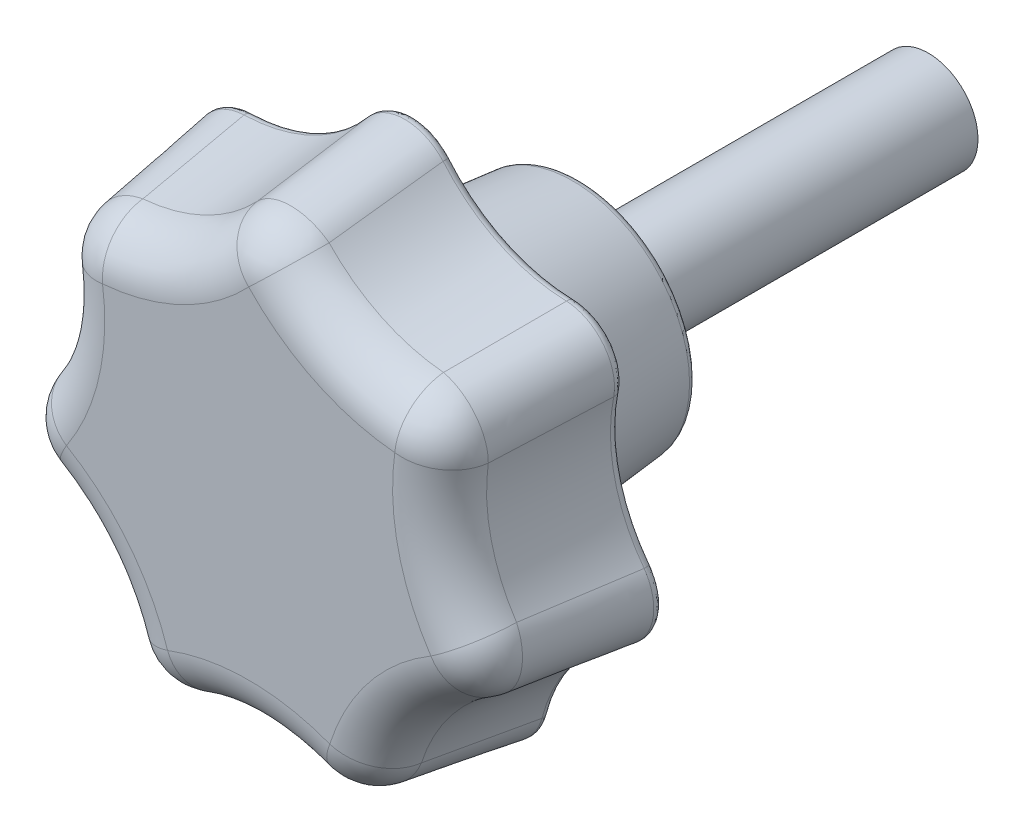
ISO-10303-21;
HEADER;
FILE_DESCRIPTION(('STEP AP214'),'2;1');
FILE_NAME('part.step','',(''),(''),'','','');
FILE_SCHEMA(('AUTOMOTIVE_DESIGN { 1 0 10303 214 1 1 1 1 }'));
ENDSEC;
DATA;
#1=APPLICATION_CONTEXT('core data for automotive mechanical design processes');
#2=APPLICATION_PROTOCOL_DEFINITION('international standard','automotive_design',2000,#1);
#3=PRODUCT_CONTEXT('',#1,'mechanical');
#4=PRODUCT('Part','Part','',(#3));
#5=PRODUCT_RELATED_PRODUCT_CATEGORY('part','',(#4));
#6=PRODUCT_DEFINITION_FORMATION('','',#4);
#7=PRODUCT_DEFINITION_CONTEXT('part definition',#1,'design');
#8=PRODUCT_DEFINITION('design','',#6,#7);
#9=PRODUCT_DEFINITION_SHAPE('','',#8);
#10=(LENGTH_UNIT() NAMED_UNIT(*) SI_UNIT(.MILLI.,.METRE.));
#11=(NAMED_UNIT(*) PLANE_ANGLE_UNIT() SI_UNIT($,.RADIAN.));
#12=(NAMED_UNIT(*) SI_UNIT($,.STERADIAN.) SOLID_ANGLE_UNIT());
#13=UNCERTAINTY_MEASURE_WITH_UNIT(LENGTH_MEASURE(1.E-05),#10,'distance_accuracy_value','');
#14=(GEOMETRIC_REPRESENTATION_CONTEXT(3) GLOBAL_UNCERTAINTY_ASSIGNED_CONTEXT((#13)) GLOBAL_UNIT_ASSIGNED_CONTEXT((#10,
#11,#12)) REPRESENTATION_CONTEXT('',''));
#15=CARTESIAN_POINT('',(0.,0.,0.));
#16=DIRECTION('',(0.,0.,1.));
#17=DIRECTION('',(1.,0.,0.));
#18=AXIS2_PLACEMENT_3D('',#15,#16,#17);
#19=CARTESIAN_POINT('',(-22.4233419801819,5.1179814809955,0.5));
#20=DIRECTION('',(0.,0.,1.));
#21=DIRECTION('',(1.,0.,0.));
#22=AXIS2_PLACEMENT_3D('',#19,#20,#21);
#23=TOROIDAL_SURFACE('',#22,10.5445045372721,0.5);
#24=CARTESIAN_POINT('',(-22.4233419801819,5.1179814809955,0.));
#25=DIRECTION('',(0.,0.,1.));
#26=DIRECTION('',(1.,0.,0.));
#27=AXIS2_PLACEMENT_3D('',#24,#25,#26);
#28=CIRCLE('',#27,10.5445045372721);
#29=CARTESIAN_POINT('',(-14.0158069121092,-1.24597405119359,0.));
#30=VERTEX_POINT('',#29);
#31=CARTESIAN_POINT('',(-12.0871978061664,7.20381454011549,0.));
#32=VERTEX_POINT('',#31);
#33=EDGE_CURVE('E57',#30,#32,#28,.T.);
#34=ORIENTED_EDGE('',*,*,#33,.F.);
#35=CARTESIAN_POINT('',(-14.0158069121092,-1.24597405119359,0.500000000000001));
#36=DIRECTION('',(-0.603532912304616,-0.797338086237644,0.));
#37=DIRECTION('',(0.797338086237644,-0.603532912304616,0.));
#38=AXIS2_PLACEMENT_3D('',#35,#36,#37);
#39=CIRCLE('',#38,0.5);
#40=CARTESIAN_POINT('',(-14.4122920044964,-0.945860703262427,0.552264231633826));
#41=VERTEX_POINT('',#40);
#42=EDGE_CURVE('E585',#41,#30,#39,.T.);
#43=ORIENTED_EDGE('',*,*,#42,.F.);
#44=CARTESIAN_POINT('',(-22.4233419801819,5.1179814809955,0.55226423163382));
#45=DIRECTION('',(0.,0.,-1.));
#46=DIRECTION('',(-1.,0.,0.));
#47=AXIS2_PLACEMENT_3D('',#44,#45,#46);
#48=CIRCLE('',#47,10.047243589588);
#49=CARTESIAN_POINT('',(-12.5746328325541,7.10545019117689,0.552264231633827));
#50=VERTEX_POINT('',#49);
#51=EDGE_CURVE('E779',#50,#41,#48,.T.);
#52=ORIENTED_EDGE('',*,*,#51,.F.);
#53=CARTESIAN_POINT('',(-12.0871978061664,7.20381454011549,0.5));
#54=DIRECTION('',(0.19781233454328,-0.980239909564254,0.));
#55=DIRECTION('',(0.980239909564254,0.19781233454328,0.));
#56=AXIS2_PLACEMENT_3D('',#53,#54,#55);
#57=CIRCLE('',#56,0.5);
#58=EDGE_CURVE('E823',#50,#32,#57,.T.);
#59=ORIENTED_EDGE('',*,*,#58,.T.);
#60=EDGE_LOOP('',(#34,#43,#52,#59));
#61=FACE_BOUND('',#60,.T.);
#62=ADVANCED_FACE('F40',(#61),#23,.T.);
#63=CARTESIAN_POINT('',(-17.9821240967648,-14.3402654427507,0.5));
#64=DIRECTION('',(0.,0.,1.));
#65=DIRECTION('',(1.,0.,0.));
#66=AXIS2_PLACEMENT_3D('',#63,#64,#65);
#67=TOROIDAL_SURFACE('',#66,10.5445045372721,0.5);
#68=CARTESIAN_POINT('',(-7.76457093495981,-11.7348512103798,0.5));
#69=DIRECTION('',(-0.247087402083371,0.968993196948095,0.));
#70=DIRECTION('',(-0.968993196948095,-0.247087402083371,0.));
#71=AXIS2_PLACEMENT_3D('',#68,#69,#70);
#72=CIRCLE('',#71,0.5);
#73=CARTESIAN_POINT('',(-7.76457093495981,-11.7348512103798,0.));
#74=VERTEX_POINT('',#73);
#75=CARTESIAN_POINT('',(-8.2464134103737,-11.8577181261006,0.552264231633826));
#76=VERTEX_POINT('',#75);
#77=EDGE_CURVE('E200',#74,#76,#72,.T.);
#78=ORIENTED_EDGE('',*,*,#77,.T.);
#79=CARTESIAN_POINT('',(-17.9821240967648,-14.3402654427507,0.552264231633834));
#80=DIRECTION('',(0.,0.,-1.));
#81=DIRECTION('',(-1.,0.,0.));
#82=AXIS2_PLACEMENT_3D('',#79,#80,#81);
#83=CIRCLE('',#82,10.047243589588);
#84=CARTESIAN_POINT('',(-13.3954199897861,-5.40106809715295,0.552264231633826));
#85=VERTEX_POINT('',#84);
#86=EDGE_CURVE('E242',#85,#76,#83,.T.);
#87=ORIENTED_EDGE('',*,*,#86,.F.);
#88=CARTESIAN_POINT('',(-13.1684135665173,-4.95864687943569,0.5));
#89=DIRECTION('',(-0.889716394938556,0.456513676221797,0.));
#90=DIRECTION('',(-0.456513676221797,-0.889716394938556,0.));
#91=AXIS2_PLACEMENT_3D('',#88,#89,#90);
#92=CIRCLE('',#91,0.5);
#93=CARTESIAN_POINT('',(-13.1684135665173,-4.95864687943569,0.));
#94=VERTEX_POINT('',#93);
#95=EDGE_CURVE('E852',#94,#85,#92,.T.);
#96=ORIENTED_EDGE('',*,*,#95,.F.);
#97=CARTESIAN_POINT('',(-17.9821240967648,-14.3402654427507,0.));
#98=DIRECTION('',(0.,0.,1.));
#99=DIRECTION('',(1.,0.,0.));
#100=AXIS2_PLACEMENT_3D('',#97,#98,#99);
#101=CIRCLE('',#100,10.5445045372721);
#102=EDGE_CURVE('E841',#74,#94,#101,.T.);
#103=ORIENTED_EDGE('',*,*,#102,.F.);
#104=EDGE_LOOP('',(#78,#87,#96,#103));
#105=FACE_BOUND('',#104,.T.);
#106=ADVANCED_FACE('F1374',(#105),#67,.T.);
#107=CARTESIAN_POINT('',(-9.97932599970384,20.7222839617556,0.5));
#108=DIRECTION('',(0.,0.,1.));
#109=DIRECTION('',(1.,0.,0.));
#110=AXIS2_PLACEMENT_3D('',#107,#108,#109);
#111=TOROIDAL_SURFACE('',#110,10.5445045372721,0.5);
#112=CARTESIAN_POINT('',(-9.7128544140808,10.1811469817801,0.5));
#113=DIRECTION('',(-0.999680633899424,-0.0252711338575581,0.));
#114=DIRECTION('',(0.0252711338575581,-0.999680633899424,0.));
#115=AXIS2_PLACEMENT_3D('',#112,#113,#114);
#116=CIRCLE('',#115,0.500000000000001);
#117=CARTESIAN_POINT('',(-9.72542076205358,10.6782491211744,0.552264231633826));
#118=VERTEX_POINT('',#117);
#119=CARTESIAN_POINT('',(-9.7128544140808,10.1811469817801,0.));
#120=VERTEX_POINT('',#119);
#121=EDGE_CURVE('E1875',#118,#120,#116,.T.);
#122=ORIENTED_EDGE('',*,*,#121,.F.);
#123=CARTESIAN_POINT('',(-9.97932599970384,20.7222839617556,0.552264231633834));
#124=DIRECTION('',(0.,0.,-1.));
#125=DIRECTION('',(-1.,0.,0.));
#126=AXIS2_PLACEMENT_3D('',#123,#124,#125);
#127=CIRCLE('',#126,10.047243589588);
#128=CARTESIAN_POINT('',(-2.28489067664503,14.261419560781,0.552264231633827));
#129=VERTEX_POINT('',#128);
#130=EDGE_CURVE('E347',#129,#118,#127,.T.);
#131=ORIENTED_EDGE('',*,*,#130,.F.);
#132=CARTESIAN_POINT('',(-1.90407556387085,13.9416566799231,0.5));
#133=DIRECTION('',(-0.643048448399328,-0.765825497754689,0.));
#134=DIRECTION('',(0.765825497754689,-0.643048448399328,0.));
#135=AXIS2_PLACEMENT_3D('',#132,#133,#134);
#136=CIRCLE('',#135,0.5);
#137=CARTESIAN_POINT('',(-1.90407556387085,13.9416566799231,0.));
#138=VERTEX_POINT('',#137);
#139=EDGE_CURVE('E1850',#129,#138,#136,.T.);
#140=ORIENTED_EDGE('',*,*,#139,.T.);
#141=CARTESIAN_POINT('',(-9.97932599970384,20.7222839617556,0.));
#142=DIRECTION('',(0.,0.,1.));
#143=DIRECTION('',(1.,0.,0.));
#144=AXIS2_PLACEMENT_3D('',#141,#142,#143);
#145=CIRCLE('',#144,10.5445045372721);
#146=EDGE_CURVE('E882',#120,#138,#145,.T.);
#147=ORIENTED_EDGE('',*,*,#146,.F.);
#148=EDGE_LOOP('',(#122,#131,#140,#147));
#149=FACE_BOUND('',#148,.T.);
#150=ADVANCED_FACE('F1380',(#149),#111,.T.);
#151=CARTESIAN_POINT('',(-1.70002900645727E-13,-23.,0.5));
#152=DIRECTION('',(0.,0.,1.));
#153=DIRECTION('',(1.,0.,0.));
#154=AXIS2_PLACEMENT_3D('',#151,#152,#153);
#155=TOROIDAL_SURFACE('',#154,10.5445045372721,0.5);
#156=CARTESIAN_POINT('',(4.33354532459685,-13.3871460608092,0.5));
#157=DIRECTION('',(-0.911645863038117,0.41097666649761,0.));
#158=DIRECTION('',(-0.41097666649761,-0.911645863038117,0.));
#159=AXIS2_PLACEMENT_3D('',#156,#157,#158);
#160=CIRCLE('',#159,0.499999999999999);
#161=CARTESIAN_POINT('',(4.33354532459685,-13.3871460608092,0.));
#162=VERTEX_POINT('',#161);
#163=CARTESIAN_POINT('',(4.12918267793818,-13.8404719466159,0.552264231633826));
#164=VERTEX_POINT('',#163);
#165=EDGE_CURVE('E939',#162,#164,#160,.T.);
#166=ORIENTED_EDGE('',*,*,#165,.T.);
#167=CARTESIAN_POINT('',(-1.70002900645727E-13,-23.,0.55226423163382));
#168=DIRECTION('',(0.,0.,-1.));
#169=DIRECTION('',(-1.,0.,0.));
#170=AXIS2_PLACEMENT_3D('',#167,#168,#169);
#171=CIRCLE('',#170,10.047243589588);
#172=CARTESIAN_POINT('',(-4.12918267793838,-13.8404719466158,0.552264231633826));
#173=VERTEX_POINT('',#172);
#174=EDGE_CURVE('E1194',#173,#164,#171,.T.);
#175=ORIENTED_EDGE('',*,*,#174,.F.);
#176=CARTESIAN_POINT('',(-4.33354532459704,-13.3871460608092,0.5));
#177=DIRECTION('',(-0.911645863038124,-0.410976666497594,0.));
#178=DIRECTION('',(0.410976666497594,-0.911645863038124,0.));
#179=AXIS2_PLACEMENT_3D('',#176,#177,#178);
#180=CIRCLE('',#179,0.499999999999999);
#181=CARTESIAN_POINT('',(-4.33354532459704,-13.3871460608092,0.));
#182=VERTEX_POINT('',#181);
#183=EDGE_CURVE('E1003',#182,#173,#180,.T.);
#184=ORIENTED_EDGE('',*,*,#183,.F.);
#185=CARTESIAN_POINT('',(-1.70002900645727E-13,-23.,0.));
#186=DIRECTION('',(0.,0.,1.));
#187=DIRECTION('',(1.,0.,0.));
#188=AXIS2_PLACEMENT_3D('',#185,#186,#187);
#189=CIRCLE('',#188,10.5445045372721);
#190=EDGE_CURVE('E888',#162,#182,#189,.T.);
#191=ORIENTED_EDGE('',*,*,#190,.F.);
#192=EDGE_LOOP('',(#166,#175,#184,#191));
#193=FACE_BOUND('',#192,.T.);
#194=ADVANCED_FACE('F1387',(#193),#155,.T.);
#195=CARTESIAN_POINT('',(9.97932599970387,20.7222839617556,0.5));
#196=DIRECTION('',(0.,0.,1.));
#197=DIRECTION('',(1.,0.,0.));
#198=AXIS2_PLACEMENT_3D('',#195,#196,#197);
#199=TOROIDAL_SURFACE('',#198,10.5445045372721,0.5);
#200=CARTESIAN_POINT('',(1.90407556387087,13.9416566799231,0.5));
#201=DIRECTION('',(-0.643048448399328,0.765825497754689,0.));
#202=DIRECTION('',(-0.765825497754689,-0.643048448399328,0.));
#203=AXIS2_PLACEMENT_3D('',#200,#201,#202);
#204=CIRCLE('',#203,0.5);
#205=CARTESIAN_POINT('',(2.28489067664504,14.261419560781,0.552264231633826));
#206=VERTEX_POINT('',#205);
#207=CARTESIAN_POINT('',(1.90407556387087,13.9416566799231,0.));
#208=VERTEX_POINT('',#207);
#209=EDGE_CURVE('E1005',#206,#208,#204,.T.);
#210=ORIENTED_EDGE('',*,*,#209,.F.);
#211=CARTESIAN_POINT('',(9.97932599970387,20.7222839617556,0.55226423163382));
#212=DIRECTION('',(0.,0.,-1.));
#213=DIRECTION('',(-1.,0.,0.));
#214=AXIS2_PLACEMENT_3D('',#211,#212,#213);
#215=CIRCLE('',#214,10.047243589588);
#216=CARTESIAN_POINT('',(9.7254207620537,10.6782491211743,0.552264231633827));
#217=VERTEX_POINT('',#216);
#218=EDGE_CURVE('E760',#217,#206,#215,.T.);
#219=ORIENTED_EDGE('',*,*,#218,.F.);
#220=CARTESIAN_POINT('',(9.71285441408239,10.1811469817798,0.500000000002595));
#221=DIRECTION('',(-0.99968063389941,0.0252711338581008,-6.49125852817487E-13));
#222=DIRECTION('',(-0.0252711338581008,-0.99968063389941,0.));
#223=AXIS2_PLACEMENT_3D('',#220,#221,#222);
#224=CIRCLE('',#223,0.500000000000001);
#225=CARTESIAN_POINT('',(9.71285441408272,10.18114698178,0.));
#226=VERTEX_POINT('',#225);
#227=EDGE_CURVE('E936',#217,#226,#224,.T.);
#228=ORIENTED_EDGE('',*,*,#227,.T.);
#229=CARTESIAN_POINT('',(9.97932599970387,20.7222839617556,0.));
#230=DIRECTION('',(0.,0.,1.));
#231=DIRECTION('',(1.,0.,0.));
#232=AXIS2_PLACEMENT_3D('',#229,#230,#231);
#233=CIRCLE('',#232,10.5445045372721);
#234=EDGE_CURVE('E900',#208,#226,#233,.T.);
#235=ORIENTED_EDGE('',*,*,#234,.F.);
#236=EDGE_LOOP('',(#210,#219,#228,#235));
#237=FACE_BOUND('',#236,.T.);
#238=ADVANCED_FACE('F937',(#237),#199,.T.);
#239=CARTESIAN_POINT('',(17.9821240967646,-14.340265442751,0.5));
#240=DIRECTION('',(0.,0.,1.));
#241=DIRECTION('',(1.,0.,0.));
#242=AXIS2_PLACEMENT_3D('',#239,#240,#241);
#243=TOROIDAL_SURFACE('',#242,10.5445045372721,0.5);
#244=CARTESIAN_POINT('',(13.1684135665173,-4.95864687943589,0.5));
#245=DIRECTION('',(-0.889716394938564,-0.456513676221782,0.));
#246=DIRECTION('',(0.456513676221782,-0.889716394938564,0.));
#247=AXIS2_PLACEMENT_3D('',#244,#245,#246);
#248=CIRCLE('',#247,0.5);
#249=CARTESIAN_POINT('',(13.1684135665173,-4.95864687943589,0.));
#250=VERTEX_POINT('',#249);
#251=CARTESIAN_POINT('',(13.3954199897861,-5.40106809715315,0.552264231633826));
#252=VERTEX_POINT('',#251);
#253=EDGE_CURVE('E940',#250,#252,#248,.T.);
#254=ORIENTED_EDGE('',*,*,#253,.T.);
#255=CARTESIAN_POINT('',(17.9821240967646,-14.340265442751,0.55226423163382));
#256=DIRECTION('',(0.,0.,-1.));
#257=DIRECTION('',(-1.,0.,0.));
#258=AXIS2_PLACEMENT_3D('',#255,#256,#257);
#259=CIRCLE('',#258,10.047243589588);
#260=CARTESIAN_POINT('',(8.24641341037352,-11.8577181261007,0.552264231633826));
#261=VERTEX_POINT('',#260);
#262=EDGE_CURVE('E1275',#261,#252,#259,.T.);
#263=ORIENTED_EDGE('',*,*,#262,.F.);
#264=CARTESIAN_POINT('',(7.76457093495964,-11.7348512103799,0.5));
#265=DIRECTION('',(-0.247087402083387,-0.968993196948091,0.));
#266=DIRECTION('',(0.968993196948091,-0.247087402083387,0.));
#267=AXIS2_PLACEMENT_3D('',#264,#265,#266);
#268=CIRCLE('',#267,0.500000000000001);
#269=CARTESIAN_POINT('',(7.76457093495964,-11.7348512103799,0.));
#270=VERTEX_POINT('',#269);
#271=EDGE_CURVE('E947',#270,#261,#268,.T.);
#272=ORIENTED_EDGE('',*,*,#271,.F.);
#273=CARTESIAN_POINT('',(17.9821240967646,-14.340265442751,0.));
#274=DIRECTION('',(0.,0.,1.));
#275=DIRECTION('',(1.,0.,0.));
#276=AXIS2_PLACEMENT_3D('',#273,#274,#275);
#277=CIRCLE('',#276,10.5445045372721);
#278=EDGE_CURVE('E924',#250,#270,#277,.T.);
#279=ORIENTED_EDGE('',*,*,#278,.F.);
#280=EDGE_LOOP('',(#254,#263,#272,#279));
#281=FACE_BOUND('',#280,.T.);
#282=ADVANCED_FACE('F1371',(#281),#243,.T.);
#283=CARTESIAN_POINT('',(22.423341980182,5.11798148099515,0.5));
#284=DIRECTION('',(0.,0.,1.));
#285=DIRECTION('',(1.,0.,0.));
#286=AXIS2_PLACEMENT_3D('',#283,#284,#285);
#287=TOROIDAL_SURFACE('',#286,10.5445045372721,0.5);
#288=CARTESIAN_POINT('',(12.0871978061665,7.20381454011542,0.5));
#289=DIRECTION('',(0.197812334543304,0.980239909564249,0.));
#290=DIRECTION('',(-0.980239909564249,0.197812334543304,0.));
#291=AXIS2_PLACEMENT_3D('',#288,#289,#290);
#292=CIRCLE('',#291,0.499999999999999);
#293=CARTESIAN_POINT('',(12.5746328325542,7.1054501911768,0.552264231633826));
#294=VERTEX_POINT('',#293);
#295=CARTESIAN_POINT('',(12.0871978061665,7.20381454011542,0.));
#296=VERTEX_POINT('',#295);
#297=EDGE_CURVE('E942',#294,#296,#292,.T.);
#298=ORIENTED_EDGE('',*,*,#297,.F.);
#299=CARTESIAN_POINT('',(22.423341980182,5.11798148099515,0.552264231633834));
#300=DIRECTION('',(0.,0.,-1.));
#301=DIRECTION('',(-1.,0.,0.));
#302=AXIS2_PLACEMENT_3D('',#299,#300,#301);
#303=CIRCLE('',#302,10.047243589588);
#304=CARTESIAN_POINT('',(14.4122920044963,-0.945860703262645,0.552264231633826));
#305=VERTEX_POINT('',#304);
#306=EDGE_CURVE('E1312',#305,#294,#303,.T.);
#307=ORIENTED_EDGE('',*,*,#306,.F.);
#308=CARTESIAN_POINT('',(14.0158069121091,-1.2459740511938,0.5));
#309=DIRECTION('',(0.603532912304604,-0.797338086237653,0.));
#310=DIRECTION('',(0.797338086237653,0.603532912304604,0.));
#311=AXIS2_PLACEMENT_3D('',#308,#309,#310);
#312=CIRCLE('',#311,0.5);
#313=CARTESIAN_POINT('',(14.0158069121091,-1.2459740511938,0.));
#314=VERTEX_POINT('',#313);
#315=EDGE_CURVE('E584',#314,#305,#312,.T.);
#316=ORIENTED_EDGE('',*,*,#315,.F.);
#317=CARTESIAN_POINT('',(22.423341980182,5.11798148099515,0.));
#318=DIRECTION('',(0.,0.,1.));
#319=DIRECTION('',(1.,0.,0.));
#320=AXIS2_PLACEMENT_3D('',#317,#318,#319);
#321=CIRCLE('',#320,10.5445045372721);
#322=EDGE_CURVE('E313',#296,#314,#321,.T.);
#323=ORIENTED_EDGE('',*,*,#322,.F.);
#324=EDGE_LOOP('',(#298,#307,#316,#323));
#325=FACE_BOUND('',#324,.T.);
#326=ADVANCED_FACE('F949',(#325),#287,.T.);
#327=CARTESIAN_POINT('',(10.9928590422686,-2.50904834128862,7.));
#328=DIRECTION('',(0.,1.,0.));
#329=DIRECTION('',(1.,0.,0.));
#330=AXIS2_PLACEMENT_3D('',#327,#328,#329);
#331=SPHERICAL_SURFACE('',#330,3.);
#332=CARTESIAN_POINT('',(10.9928590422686,-2.50904834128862,7.));
#333=DIRECTION('',(-0.147342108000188,0.0336298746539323,0.988513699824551));
#334=DIRECTION('',(0.989073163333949,0.,0.147425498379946));
#335=AXIS2_PLACEMENT_3D('',#332,#333,#334);
#336=CIRCLE('',#335,3.);
#337=CARTESIAN_POINT('',(12.5103791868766,-5.07786067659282,7.31358538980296));
#338=VERTEX_POINT('',#337);
#339=CARTESIAN_POINT('',(13.4746633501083,-0.853055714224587,7.31358538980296));
#340=VERTEX_POINT('',#339);
#341=EDGE_CURVE('E966',#338,#340,#336,.T.);
#342=ORIENTED_EDGE('',*,*,#341,.T.);
#343=CARTESIAN_POINT('',(10.9928590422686,-2.50904834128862,7.));
#344=DIRECTION('',(-0.555038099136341,0.831824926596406,0.));
#345=DIRECTION('',(0.831824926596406,0.555038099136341,0.));
#346=AXIS2_PLACEMENT_3D('',#343,#344,#345);
#347=CIRCLE('',#346,3.);
#348=CARTESIAN_POINT('',(10.9928590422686,-2.50904834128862,10.));
#349=VERTEX_POINT('',#348);
#350=EDGE_CURVE('E527',#349,#340,#347,.T.);
#351=ORIENTED_EDGE('',*,*,#350,.F.);
#352=CARTESIAN_POINT('',(10.9928590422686,-2.50904834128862,7.));
#353=DIRECTION('',(0.860987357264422,0.508626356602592,0.));
#354=DIRECTION('',(-0.508626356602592,0.860987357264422,0.));
#355=AXIS2_PLACEMENT_3D('',#352,#353,#354);
#356=CIRCLE('',#355,3.);
#357=EDGE_CURVE('E970',#349,#338,#356,.T.);
#358=ORIENTED_EDGE('',*,*,#357,.T.);
#359=EDGE_LOOP('',(#342,#351,#358));
#360=FACE_BOUND('',#359,.T.);
#361=ADVANCED_FACE('F1362',(#360),#331,.T.);
#362=CARTESIAN_POINT('',(8.81558849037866,7.03019722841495,7.));
#363=DIRECTION('',(0.,1.,0.));
#364=DIRECTION('',(1.,0.,0.));
#365=AXIS2_PLACEMENT_3D('',#362,#363,#364);
#366=SPHERICAL_SURFACE('',#365,3.);
#367=CARTESIAN_POINT('',(8.81558849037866,7.03019722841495,7.));
#368=DIRECTION('',(-0.118159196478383,-0.0942288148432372,0.988513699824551));
#369=DIRECTION('',(0.992931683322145,0.,0.118687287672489));
#370=AXIS2_PLACEMENT_3D('',#367,#368,#369);
#371=CIRCLE('',#370,3.);
#372=CARTESIAN_POINT('',(11.77012518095,6.61501395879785,7.31358538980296));
#373=VERTEX_POINT('',#372);
#374=CARTESIAN_POINT('',(9.06826099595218,10.0030444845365,7.31358538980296));
#375=VERTEX_POINT('',#374);
#376=EDGE_CURVE('E530',#373,#375,#371,.T.);
#377=ORIENTED_EDGE('',*,*,#376,.T.);
#378=CARTESIAN_POINT('',(8.81558849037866,7.03019722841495,7.));
#379=DIRECTION('',(0.996407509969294,-0.0846880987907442,0.));
#380=DIRECTION('',(0.0846880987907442,0.996407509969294,0.));
#381=AXIS2_PLACEMENT_3D('',#378,#379,#380);
#382=CIRCLE('',#381,3.);
#383=CARTESIAN_POINT('',(8.81558849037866,7.03019722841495,10.));
#384=VERTEX_POINT('',#383);
#385=EDGE_CURVE('E484',#375,#384,#382,.T.);
#386=ORIENTED_EDGE('',*,*,#385,.T.);
#387=CARTESIAN_POINT('',(8.81558849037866,7.03019722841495,7.));
#388=DIRECTION('',(-0.13915673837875,-0.990270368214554,0.));
#389=DIRECTION('',(-0.990270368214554,0.13915673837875,0.));
#390=AXIS2_PLACEMENT_3D('',#387,#388,#389);
#391=CIRCLE('',#390,3.);
#392=EDGE_CURVE('E520',#373,#384,#391,.T.);
#393=ORIENTED_EDGE('',*,*,#392,.F.);
#394=EDGE_LOOP('',(#377,#386,#393));
#395=FACE_BOUND('',#394,.T.);
#396=ADVANCED_FACE('F1249',(#395),#366,.T.);
#397=CARTESIAN_POINT('',(-22.4233419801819,5.1179814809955,7.));
#398=DIRECTION('',(0.,0.,1.));
#399=DIRECTION('',(1.,0.,0.));
#400=AXIS2_PLACEMENT_3D('',#397,#398,#399);
#401=TOROIDAL_SURFACE('',#400,13.7414527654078,3.);
#402=CARTESIAN_POINT('',(-22.4233419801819,5.1179814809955,10.));
#403=DIRECTION('',(0.,0.,-1.));
#404=DIRECTION('',(1.,0.,0.));
#405=AXIS2_PLACEMENT_3D('',#402,#403,#404);
#406=CIRCLE('',#405,13.7414527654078);
#407=CARTESIAN_POINT('',(-8.81558849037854,7.03019722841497,10.));
#408=VERTEX_POINT('',#407);
#409=CARTESIAN_POINT('',(-10.9928590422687,-2.50904834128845,10.));
#410=VERTEX_POINT('',#409);
#411=EDGE_CURVE('E305',#408,#410,#406,.T.);
#412=ORIENTED_EDGE('',*,*,#411,.F.);
#413=CARTESIAN_POINT('',(-8.81558849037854,7.03019722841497,7.));
#414=DIRECTION('',(-0.139156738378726,0.990270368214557,0.));
#415=DIRECTION('',(-0.990270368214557,-0.139156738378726,0.));
#416=AXIS2_PLACEMENT_3D('',#413,#414,#415);
#417=CIRCLE('',#416,3.);
#418=CARTESIAN_POINT('',(-11.7701251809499,6.61501395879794,7.31358538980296));
#419=VERTEX_POINT('',#418);
#420=EDGE_CURVE('E248',#419,#408,#417,.T.);
#421=ORIENTED_EDGE('',*,*,#420,.F.);
#422=CARTESIAN_POINT('',(-22.4233419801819,5.1179814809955,7.31358538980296));
#423=DIRECTION('',(0.,0.,1.));
#424=DIRECTION('',(1.,0.,0.));
#425=AXIS2_PLACEMENT_3D('',#422,#423,#424);
#426=CIRCLE('',#425,10.757887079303);
#427=CARTESIAN_POINT('',(-13.4746633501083,-0.853055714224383,7.31358538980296));
#428=VERTEX_POINT('',#427);
#429=EDGE_CURVE('E788',#428,#419,#426,.T.);
#430=ORIENTED_EDGE('',*,*,#429,.F.);
#431=CARTESIAN_POINT('',(-10.9928590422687,-2.50904834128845,7.));
#432=DIRECTION('',(0.555038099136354,0.831824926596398,0.));
#433=DIRECTION('',(0.831824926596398,-0.555038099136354,0.));
#434=AXIS2_PLACEMENT_3D('',#431,#432,#433);
#435=CIRCLE('',#434,3.);
#436=EDGE_CURVE('E800',#428,#410,#435,.T.);
#437=ORIENTED_EDGE('',*,*,#436,.T.);
#438=EDGE_LOOP('',(#412,#421,#430,#437));
#439=FACE_BOUND('',#438,.T.);
#440=ADVANCED_FACE('F1369',(#439),#401,.T.);
#441=CARTESIAN_POINT('',(0.,0.,10.));
#442=DIRECTION('',(0.,0.,1.));
#443=DIRECTION('',(1.,0.,0.));
#444=AXIS2_PLACEMENT_3D('',#441,#442,#443);
#445=PLANE('',#444);
#446=CARTESIAN_POINT('',(17.9821240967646,-14.340265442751,10.));
#447=DIRECTION('',(0.,0.,-1.));
#448=DIRECTION('',(1.,0.,0.));
#449=AXIS2_PLACEMENT_3D('',#446,#447,#448);
#450=CIRCLE('',#449,13.7414527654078);
#451=CARTESIAN_POINT('',(4.8922825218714,-10.158929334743,10.));
#452=VERTEX_POINT('',#451);
#453=EDGE_CURVE('E316',#452,#349,#450,.T.);
#454=ORIENTED_EDGE('',*,*,#453,.T.);
#455=CARTESIAN_POINT('',(22.423341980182,5.11798148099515,10.));
#456=DIRECTION('',(0.,0.,-1.));
#457=DIRECTION('',(1.,0.,0.));
#458=AXIS2_PLACEMENT_3D('',#455,#456,#457);
#459=CIRCLE('',#458,13.7414527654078);
#460=EDGE_CURVE('E1360',#349,#384,#459,.T.);
#461=ORIENTED_EDGE('',*,*,#460,.T.);
#462=CARTESIAN_POINT('',(9.97932599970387,20.7222839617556,10.));
#463=DIRECTION('',(0.,0.,-1.));
#464=DIRECTION('',(1.,0.,0.));
#465=AXIS2_PLACEMENT_3D('',#462,#463,#464);
#466=CIRCLE('',#465,13.7414527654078);
#467=CARTESIAN_POINT('',(0.,11.2755608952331,10.));
#468=VERTEX_POINT('',#467);
#469=EDGE_CURVE('E1256',#384,#468,#466,.T.);
#470=ORIENTED_EDGE('',*,*,#469,.T.);
#471=CARTESIAN_POINT('',(-9.97932599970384,20.7222839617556,10.));
#472=DIRECTION('',(0.,0.,-1.));
#473=DIRECTION('',(1.,0.,0.));
#474=AXIS2_PLACEMENT_3D('',#471,#472,#473);
#475=CIRCLE('',#474,13.7414527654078);
#476=EDGE_CURVE('E311',#468,#408,#475,.T.);
#477=ORIENTED_EDGE('',*,*,#476,.T.);
#478=ORIENTED_EDGE('',*,*,#411,.T.);
#479=CARTESIAN_POINT('',(-17.9821240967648,-14.3402654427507,10.));
#480=DIRECTION('',(0.,0.,-1.));
#481=DIRECTION('',(1.,0.,0.));
#482=AXIS2_PLACEMENT_3D('',#479,#480,#481);
#483=CIRCLE('',#482,13.7414527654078);
#484=CARTESIAN_POINT('',(-4.89228252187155,-10.1589293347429,10.));
#485=VERTEX_POINT('',#484);
#486=EDGE_CURVE('E312',#410,#485,#483,.T.);
#487=ORIENTED_EDGE('',*,*,#486,.T.);
#488=CARTESIAN_POINT('',(-1.70002900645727E-13,-23.,10.));
#489=DIRECTION('',(0.,0.,-1.));
#490=DIRECTION('',(1.,0.,0.));
#491=AXIS2_PLACEMENT_3D('',#488,#489,#490);
#492=CIRCLE('',#491,13.7414527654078);
#493=EDGE_CURVE('E848',#485,#452,#492,.T.);
#494=ORIENTED_EDGE('',*,*,#493,.T.);
#495=EDGE_LOOP('',(#454,#461,#470,#477,#478,#487,#494));
#496=FACE_BOUND('',#495,.T.);
#497=ADVANCED_FACE('F838',(#496),#445,.T.);
#498=CARTESIAN_POINT('',(0.,0.,0.));
#499=DIRECTION('',(0.,0.,1.));
#500=DIRECTION('',(1.,0.,0.));
#501=AXIS2_PLACEMENT_3D('',#498,#499,#500);
#502=PLANE('',#501);
#503=CARTESIAN_POINT('',(0.,0.,0.));
#504=DIRECTION('',(0.,0.,1.));
#505=DIRECTION('',(1.,0.,0.));
#506=AXIS2_PLACEMENT_3D('',#503,#504,#505);
#507=CIRCLE('',#506,8.50124437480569);
#508=CARTESIAN_POINT('',(8.50124437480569,0.,0.));
#509=VERTEX_POINT('',#508);
#510=EDGE_CURVE('E818',#509,#509,#507,.T.);
#511=ORIENTED_EDGE('',*,*,#510,.T.);
#512=EDGE_LOOP('',(#511));
#513=FACE_BOUND('',#512,.T.);
#514=ORIENTED_EDGE('',*,*,#102,.T.);
#515=CARTESIAN_POINT('',(-13.1684135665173,-4.95864687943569,0.));
#516=CARTESIAN_POINT('',(-13.4932529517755,-4.79197172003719,0.));
#517=CARTESIAN_POINT('',(-13.7766783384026,-4.5577135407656,0.));
#518=CARTESIAN_POINT('',(-14.1115420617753,-4.12851007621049,0.));
#519=CARTESIAN_POINT('',(-14.2061352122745,-3.97532827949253,0.));
#520=CARTESIAN_POINT('',(-14.3614761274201,-3.64886193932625,0.));
#521=CARTESIAN_POINT('',(-14.4216987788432,-3.47513308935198,0.));
#522=CARTESIAN_POINT('',(-14.5016546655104,-3.12406678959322,0.));
#523=CARTESIAN_POINT('',(-14.5225277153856,-2.94341882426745,0.));
#524=CARTESIAN_POINT('',(-14.5240250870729,-2.5796716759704,0.));
#525=CARTESIAN_POINT('',(-14.5049243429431,-2.40063169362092,0.));
#526=CARTESIAN_POINT('',(-14.4281733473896,-2.04805483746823,0.));
#527=CARTESIAN_POINT('',(-14.3695596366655,-1.87346227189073,0.));
#528=CARTESIAN_POINT('',(-14.2185538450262,-1.54624447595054,0.));
#529=CARTESIAN_POINT('',(-14.1259803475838,-1.39152614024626,0.));
#530=CARTESIAN_POINT('',(-14.0158069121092,-1.24597405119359,0.));
#531=B_SPLINE_CURVE_WITH_KNOTS('',3,(#515,#516,#517,#518,#519,#520,#521,#522,#523,#524,#525,
#526,#527,#528,#529,#530),.UNSPECIFIED.,.F.,.F.,(4,2,2,2,2,2,2,4),(0.,0.00109483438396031,
0.00164225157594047,0.00218966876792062,0.00273708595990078,0.00328450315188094,
0.00383192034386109,0.00437933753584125),.UNSPECIFIED.);
#532=EDGE_CURVE('E843',#94,#30,#531,.T.);
#533=ORIENTED_EDGE('',*,*,#532,.T.);
#534=ORIENTED_EDGE('',*,*,#33,.T.);
#535=CARTESIAN_POINT('',(-12.0871978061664,7.20381454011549,0.));
#536=CARTESIAN_POINT('',(-12.1594199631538,7.56170446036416,0.));
#537=CARTESIAN_POINT('',(-12.1529823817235,7.92935293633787,0.));
#538=CARTESIAN_POINT('',(-12.0262017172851,8.45876392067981,0.));
#539=CARTESIAN_POINT('',(-11.9654172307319,8.62822711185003,0.));
#540=CARTESIAN_POINT('',(-11.8070290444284,8.95322596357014,0.));
#541=CARTESIAN_POINT('',(-11.7087505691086,9.10862809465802,0.));
#542=CARTESIAN_POINT('',(-11.4841275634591,9.39002638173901,0.));
#543=CARTESIAN_POINT('',(-11.3559054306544,9.51897775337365,0.));
#544=CARTESIAN_POINT('',(-11.0724500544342,9.74694108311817,0.));
#545=CARTESIAN_POINT('',(-10.92056184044,9.84363712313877,0.));
#546=CARTESIAN_POINT('',(-10.5970526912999,10.0034588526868,0.));
#547=CARTESIAN_POINT('',(-10.4240056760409,10.0664894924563,0.));
#548=CARTESIAN_POINT('',(-10.0740259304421,10.1524453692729,0.));
#549=CARTESIAN_POINT('',(-9.89534363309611,10.1765337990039,0.));
#550=CARTESIAN_POINT('',(-9.7128544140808,10.1811469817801,0.));
#551=B_SPLINE_CURVE_WITH_KNOTS('',3,(#535,#536,#537,#538,#539,#540,#541,#542,#543,#544,#545,
#546,#547,#548,#549,#550),.UNSPECIFIED.,.F.,.F.,(4,2,2,2,2,2,2,4),(0.,0.00109483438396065,
0.00164225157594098,0.00218966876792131,0.00273708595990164,0.00328450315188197,
0.0038319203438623,0.00437933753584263),.UNSPECIFIED.);
#552=EDGE_CURVE('E857',#32,#120,#551,.T.);
#553=ORIENTED_EDGE('',*,*,#552,.T.);
#554=ORIENTED_EDGE('',*,*,#146,.T.);
#555=CARTESIAN_POINT('',(-1.90407556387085,13.9416566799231,0.));
#556=CARTESIAN_POINT('',(-1.66929573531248,14.2212629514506,0.));
#557=CARTESIAN_POINT('',(-1.37784281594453,14.4454549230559,0.));
#558=CARTESIAN_POINT('',(-0.884886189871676,14.6764161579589,0.));
#559=CARTESIAN_POINT('',(-0.714496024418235,14.7345515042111,0.));
#560=CARTESIAN_POINT('',(-0.361648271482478,14.8133521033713,0.));
#561=CARTESIAN_POINT('',(-0.178874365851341,14.8334065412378,0.));
#562=CARTESIAN_POINT('',(0.181181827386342,14.8332381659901,0.));
#563=CARTESIAN_POINT('',(0.361945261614,14.8133899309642,0.));
#564=CARTESIAN_POINT('',(0.716905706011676,14.7339084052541,0.));
#565=CARTESIAN_POINT('',(0.8872064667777,14.6754464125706,0.));
#566=CARTESIAN_POINT('',(1.21386478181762,14.5221639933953,0.));
#567=CARTESIAN_POINT('',(1.37103716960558,14.4261693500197,0.));
#568=CARTESIAN_POINT('',(1.65644898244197,14.2061367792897,0.));
#569=CARTESIAN_POINT('',(1.7866886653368,14.0814562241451,0.));
#570=CARTESIAN_POINT('',(1.90407556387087,13.9416566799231,0.));
#571=B_SPLINE_CURVE_WITH_KNOTS('',3,(#555,#556,#557,#558,#559,#560,#561,#562,#563,#564,#565,
#566,#567,#568,#569,#570),.UNSPECIFIED.,.F.,.F.,(4,2,2,2,2,2,2,4),(0.,0.00109483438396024,
0.00164225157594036,0.00218966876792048,0.0027370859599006,0.00328450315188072,
0.00383192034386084,0.00437933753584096),.UNSPECIFIED.);
#572=EDGE_CURVE('E887',#138,#208,#571,.T.);
#573=ORIENTED_EDGE('',*,*,#572,.T.);
#574=ORIENTED_EDGE('',*,*,#234,.T.);
#575=CARTESIAN_POINT('',(9.71285441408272,10.18114698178,0.));
#576=CARTESIAN_POINT('',(10.0778422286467,10.1719203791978,0.));
#577=CARTESIAN_POINT('',(10.4348404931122,10.0838347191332,0.));
#578=CARTESIAN_POINT('',(10.9227666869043,9.84242768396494,0.));
#579=CARTESIAN_POINT('',(11.0744552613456,9.74545808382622,0.));
#580=CARTESIAN_POINT('',(11.3560610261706,9.51872197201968,0.));
#581=CARTESIAN_POINT('',(11.4856978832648,9.38832731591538,0.));
#582=CARTESIAN_POINT('',(11.710057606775,9.10671906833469,0.));
#583=CARTESIAN_POINT('',(11.8072437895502,8.95301735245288,0.));
#584=CARTESIAN_POINT('',(11.9664168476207,8.6259421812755,0.));
#585=CARTESIAN_POINT('',(12.0268902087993,8.45634522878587,0.));
#586=CARTESIAN_POINT('',(12.1107173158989,8.10538344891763,0.));
#587=CARTESIAN_POINT('',(12.1336610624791,7.92264944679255,0.));
#588=CARTESIAN_POINT('',(12.1395840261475,7.56231744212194,0.));
#589=CARTESIAN_POINT('',(12.1233079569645,7.38275490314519,0.));
#590=CARTESIAN_POINT('',(12.0871978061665,7.20381454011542,0.));
#591=B_SPLINE_CURVE_WITH_KNOTS('',3,(#575,#576,#577,#578,#579,#580,#581,#582,#583,#584,#585,
#586,#587,#588,#589,#590),.UNSPECIFIED.,.F.,.F.,(4,2,2,2,2,2,2,4),(0.,0.00109483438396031,
0.00164225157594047,0.00218966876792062,0.00273708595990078,0.00328450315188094,
0.0038319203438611,0.00437933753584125),.UNSPECIFIED.);
#592=EDGE_CURVE('E901',#226,#296,#591,.T.);
#593=ORIENTED_EDGE('',*,*,#592,.T.);
#594=ORIENTED_EDGE('',*,*,#322,.T.);
#595=CARTESIAN_POINT('',(14.0158069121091,-1.2459740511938,0.));
#596=CARTESIAN_POINT('',(14.2361594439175,-1.53708570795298,0.));
#597=CARTESIAN_POINT('',(14.3898760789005,-1.87111870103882,0.));
#598=CARTESIAN_POINT('',(14.5053534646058,-2.40310958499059,0.));
#599=CARTESIAN_POINT('',(14.5241158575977,-2.58216404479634,0.));
#600=CARTESIAN_POINT('',(14.522424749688,-2.94369995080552,0.));
#601=CARTESIAN_POINT('',(14.5013053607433,-3.12635386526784,0.));
#602=CARTESIAN_POINT('',(14.4210211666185,-3.47734523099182,0.));
#603=CARTESIAN_POINT('',(14.3614469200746,-3.64915990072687,0.));
#604=CARTESIAN_POINT('',(14.2049720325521,-3.97753444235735,0.));
#605=CARTESIAN_POINT('',(14.1100803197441,-4.13055639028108,0.));
#606=CARTESIAN_POINT('',(13.887952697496,-4.41491615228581,0.));
#607=CARTESIAN_POINT('',(13.7593906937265,-4.54678708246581,0.));
#608=CARTESIAN_POINT('',(13.4813646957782,-4.77608117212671,0.));
#609=CARTESIAN_POINT('',(13.3308290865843,-4.87531144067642,0.));
#610=CARTESIAN_POINT('',(13.1684135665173,-4.95864687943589,0.));
#611=B_SPLINE_CURVE_WITH_KNOTS('',3,(#595,#596,#597,#598,#599,#600,#601,#602,#603,#604,#605,
#606,#607,#608,#609,#610),.UNSPECIFIED.,.F.,.F.,(4,2,2,2,2,2,2,4),(0.,0.00109483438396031,
0.00164225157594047,0.00218966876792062,0.00273708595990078,0.00328450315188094,
0.00383192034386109,0.00437933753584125),.UNSPECIFIED.);
#612=EDGE_CURVE('E911',#314,#250,#611,.T.);
#613=ORIENTED_EDGE('',*,*,#612,.T.);
#614=ORIENTED_EDGE('',*,*,#278,.T.);
#615=CARTESIAN_POINT('',(7.76457093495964,-11.7348512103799,0.));
#616=CARTESIAN_POINT('',(7.67435823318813,-12.0886349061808,0.));
#617=CARTESIAN_POINT('',(7.50904147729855,-12.4170815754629,0.));
#618=CARTESIAN_POINT('',(7.16511322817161,-12.8390563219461,0.));
#619=CARTESIAN_POINT('',(7.03682097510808,-12.9653639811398,0.));
#620=CARTESIAN_POINT('',(6.75310643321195,-13.1894557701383,0.));
#621=CARTESIAN_POINT('',(6.59713412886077,-13.2868268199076,0.));
#622=CARTESIAN_POINT('',(6.27266165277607,-13.4428976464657,0.));
#623=CARTESIAN_POINT('',(6.10118759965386,-13.5034453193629,0.));
#624=CARTESIAN_POINT('',(5.74689354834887,-13.5858465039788,0.));
#625=CARTESIAN_POINT('',(5.5680921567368,-13.6070647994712,0.));
#626=CARTESIAN_POINT('',(5.20727643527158,-13.6106938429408,0.));
#627=CARTESIAN_POINT('',(5.02401849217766,-13.5924002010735,0.));
#628=CARTESIAN_POINT('',(4.67140277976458,-13.5179932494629,0.));
#629=CARTESIAN_POINT('',(4.49996401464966,-13.4621688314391,0.));
#630=CARTESIAN_POINT('',(4.33354532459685,-13.3871460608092,0.));
#631=B_SPLINE_CURVE_WITH_KNOTS('',3,(#615,#616,#617,#618,#619,#620,#621,#622,#623,#624,#625,
#626,#627,#628,#629,#630),.UNSPECIFIED.,.F.,.F.,(4,2,2,2,2,2,2,4),(0.,0.00109483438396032,
0.00164225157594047,0.00218966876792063,0.00273708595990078,0.00328450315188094,
0.00383192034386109,0.00437933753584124),.UNSPECIFIED.);
#632=EDGE_CURVE('E928',#270,#162,#631,.T.);
#633=ORIENTED_EDGE('',*,*,#632,.T.);
#634=ORIENTED_EDGE('',*,*,#190,.T.);
#635=CARTESIAN_POINT('',(-4.33354532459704,-13.3871460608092,0.));
#636=CARTESIAN_POINT('',(-4.6663912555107,-13.5371954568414,0.));
#637=CARTESIAN_POINT('',(-5.02625451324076,-13.6127287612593,0.));
#638=CARTESIAN_POINT('',(-5.57060341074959,-13.606931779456,0.));
#639=CARTESIAN_POINT('',(-5.74934362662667,-13.5853803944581,0.));
#640=CARTESIAN_POINT('',(-6.10143876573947,-13.5032823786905,0.));
#641=CARTESIAN_POINT('',(-6.27481365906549,-13.4420481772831,0.));
#642=CARTESIAN_POINT('',(-6.59914002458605,-13.2856739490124,0.));
#643=CARTESIAN_POINT('',(-6.75339042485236,-13.1893609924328,0.));
#644=CARTESIAN_POINT('',(-7.03871299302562,-12.9637390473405,0.));
#645=CARTESIAN_POINT('',(-7.16678296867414,-12.8371758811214,0.));
#646=CARTESIAN_POINT('',(-7.39458519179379,-12.5573414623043,0.));
#647=CARTESIAN_POINT('',(-7.49454210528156,-12.4026587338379,0.));
#648=CARTESIAN_POINT('',(-7.65622070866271,-12.0805806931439,0.));
#649=CARTESIAN_POINT('',(-7.7194657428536,-11.9117385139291,0.));
#650=CARTESIAN_POINT('',(-7.76457093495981,-11.7348512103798,0.));
#651=B_SPLINE_CURVE_WITH_KNOTS('',3,(#635,#636,#637,#638,#639,#640,#641,#642,#643,#644,#645,
#646,#647,#648,#649,#650),.UNSPECIFIED.,.F.,.F.,(4,2,2,2,2,2,2,4),(0.,0.00109483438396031,
0.00164225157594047,0.00218966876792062,0.00273708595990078,0.00328450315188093,
0.00383192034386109,0.00437933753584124),.UNSPECIFIED.);
#652=EDGE_CURVE('E846',#182,#74,#651,.T.);
#653=ORIENTED_EDGE('',*,*,#652,.T.);
#654=EDGE_LOOP('',(#514,#533,#534,#553,#554,#573,#574,#593,#594,#613,#614,#633,#634,#653));
#655=FACE_BOUND('',#654,.T.);
#656=ADVANCED_FACE('F438',(#513,#655),#502,.F.);
#657=CARTESIAN_POINT('',(-9.97932599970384,20.7222839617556,10.));
#658=DIRECTION('',(0.,0.,1.));
#659=DIRECTION('',(1.,0.,0.));
#660=AXIS2_PLACEMENT_3D('',#657,#658,#659);
#661=CONICAL_SURFACE('',#660,11.0402406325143,0.10471975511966);
#662=CARTESIAN_POINT('',(-2.2848905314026,14.2614194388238,0.552264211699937));
#663=CARTESIAN_POINT('',(-2.27970329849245,14.2215921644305,0.83372597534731));
#664=CARTESIAN_POINT('',(-2.27455098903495,14.1818898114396,1.11520604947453));
#665=CARTESIAN_POINT('',(-2.26431409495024,14.102718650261,1.67824813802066));
#666=CARTESIAN_POINT('',(-2.2592295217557,14.0632498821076,1.95981015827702));
#667=CARTESIAN_POINT('',(-2.24912695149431,13.9845369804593,2.52300971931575));
#668=CARTESIAN_POINT('',(-2.24410896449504,13.9452928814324,2.80464726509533));
#669=CARTESIAN_POINT('',(-2.23413841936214,13.8670204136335,3.36799146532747));
#670=CARTESIAN_POINT('',(-2.22918586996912,13.8279920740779,3.64969812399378));
#671=CARTESIAN_POINT('',(-2.21934505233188,13.7501422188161,4.21317413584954));
#672=CARTESIAN_POINT('',(-2.21445679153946,13.7113207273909,4.49494349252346));
#673=CARTESIAN_POINT('',(-2.20474340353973,13.6338756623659,5.05853848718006));
#674=CARTESIAN_POINT('',(-2.19991828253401,13.5952521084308,5.34036412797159));
#675=CARTESIAN_POINT('',(-2.19033002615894,13.5181940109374,5.90406527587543));
#676=CARTESIAN_POINT('',(-2.18556689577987,13.4797594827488,6.1859407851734));
#677=CARTESIAN_POINT('',(-2.17610147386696,13.4030705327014,6.74973526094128));
#678=CARTESIAN_POINT('',(-2.1713991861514,13.3648161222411,7.03165422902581));
#679=CARTESIAN_POINT('',(-2.16672684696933,13.3266481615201,7.31358538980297));
#680=B_SPLINE_CURVE_WITH_KNOTS('',3,(#662,#663,#664,#665,#666,#667,#668,#669,#670,#671,#672,
#673,#674,#675,#676,#677,#678,#679),.UNSPECIFIED.,.F.,.F.,(4,2,2,2,2,2,2,2,4),(0.,
0.852938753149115,1.70601968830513,2.55922816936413,3.41254948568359,4.26596885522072,
5.11947142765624,5.97304228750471,6.82666645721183),.UNSPECIFIED.);
#681=CARTESIAN_POINT('',(-2.16672684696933,13.3266481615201,7.31358538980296));
#682=VERTEX_POINT('',#681);
#683=EDGE_CURVE('E1962',#682,#129,#680,.F.);
#684=ORIENTED_EDGE('',*,*,#683,.T.);
#685=ORIENTED_EDGE('',*,*,#130,.T.);
#686=CARTESIAN_POINT('',(-9.06826099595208,10.0030444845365,7.31358538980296));
#687=CARTESIAN_POINT('',(-9.09518875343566,10.030494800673,7.03165422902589));
#688=CARTESIAN_POINT('',(-9.12216542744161,10.0580224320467,6.74973526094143));
#689=CARTESIAN_POINT('',(-9.1762216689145,10.1132375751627,6.18594078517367));
#690=CARTESIAN_POINT('',(-9.20330122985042,10.140925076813,5.90406527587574));
#691=CARTESIAN_POINT('',(-9.25756949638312,10.1964664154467,5.34036412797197));
#692=CARTESIAN_POINT('',(-9.2847581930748,10.2243202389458,5.05853848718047));
#693=CARTESIAN_POINT('',(-9.339250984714,10.2802006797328,4.49494349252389));
#694=CARTESIAN_POINT('',(-9.36655506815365,10.3082272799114,4.21317413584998));
#695=CARTESIAN_POINT('',(-9.42128488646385,10.3644597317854,3.64969812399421));
#696=CARTESIAN_POINT('',(-9.44871060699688,10.3926655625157,3.36799146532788));
#697=CARTESIAN_POINT('',(-9.50368995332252,10.449262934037,2.8046472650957));
#698=CARTESIAN_POINT('',(-9.53124356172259,10.4776544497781,2.52300971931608));
#699=CARTESIAN_POINT('',(-9.58648493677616,10.5346296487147,1.95981015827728));
#700=CARTESIAN_POINT('',(-9.61417268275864,10.5632133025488,1.67824813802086));
#701=CARTESIAN_POINT('',(-9.66968859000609,10.6205792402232,1.11520604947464));
#702=CARTESIAN_POINT('',(-9.6975167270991,10.6493614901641,0.833725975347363));
#703=CARTESIAN_POINT('',(-9.72542075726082,10.6782489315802,0.552264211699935));
#704=B_SPLINE_CURVE_WITH_KNOTS('',3,(#686,#687,#688,#689,#690,#691,#692,#693,#694,#695,#696,
#697,#698,#699,#700,#701,#702,#703),.UNSPECIFIED.,.F.,.F.,(4,2,2,2,2,2,2,2,4),(0.,
0.853624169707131,1.7071950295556,2.56069760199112,3.41411697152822,4.26743828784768,
5.12064676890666,5.97372770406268,6.82666645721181),.UNSPECIFIED.);
#705=CARTESIAN_POINT('',(-9.06826099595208,10.0030444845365,7.31358538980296));
#706=VERTEX_POINT('',#705);
#707=EDGE_CURVE('E1988',#118,#706,#704,.F.);
#708=ORIENTED_EDGE('',*,*,#707,.T.);
#709=CARTESIAN_POINT('',(-9.97932599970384,20.7222839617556,7.31358538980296));
#710=DIRECTION('',(0.,0.,1.));
#711=DIRECTION('',(1.,0.,0.));
#712=AXIS2_PLACEMENT_3D('',#709,#710,#711);
#713=CIRCLE('',#712,10.757887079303);
#714=EDGE_CURVE('E769',#706,#682,#713,.T.);
#715=ORIENTED_EDGE('',*,*,#714,.T.);
#716=EDGE_LOOP('',(#684,#685,#708,#715));
#717=FACE_BOUND('',#716,.T.);
#718=ADVANCED_FACE('F429',(#717),#661,.F.);
#719=CARTESIAN_POINT('',(9.97932599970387,20.7222839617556,10.));
#720=DIRECTION('',(0.,0.,1.));
#721=DIRECTION('',(0.623489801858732,-0.781831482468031,0.));
#722=AXIS2_PLACEMENT_3D('',#719,#720,#721);
#723=CONICAL_SURFACE('',#722,11.0402406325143,0.10471975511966);
#724=CARTESIAN_POINT('',(9.72542075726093,10.6782489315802,0.552264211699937));
#725=CARTESIAN_POINT('',(9.69751672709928,10.6493614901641,0.833725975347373));
#726=CARTESIAN_POINT('',(9.66968859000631,10.6205792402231,1.11520604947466));
#727=CARTESIAN_POINT('',(9.61417268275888,10.5632133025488,1.67824813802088));
#728=CARTESIAN_POINT('',(9.5864849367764,10.5346296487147,1.95981015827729));
#729=CARTESIAN_POINT('',(9.5312435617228,10.4776544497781,2.52300971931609));
#730=CARTESIAN_POINT('',(9.5036899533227,10.449262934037,2.80464726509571));
#731=CARTESIAN_POINT('',(9.448710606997,10.3926655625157,3.36799146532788));
#732=CARTESIAN_POINT('',(9.42128488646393,10.3644597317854,3.64969812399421));
#733=CARTESIAN_POINT('',(9.36655506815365,10.3082272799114,4.21317413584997));
#734=CARTESIAN_POINT('',(9.33925098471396,10.2802006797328,4.49494349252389));
#735=CARTESIAN_POINT('',(9.2847581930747,10.2243202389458,5.05853848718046));
#736=CARTESIAN_POINT('',(9.25756949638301,10.1964664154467,5.34036412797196));
#737=CARTESIAN_POINT('',(9.2033012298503,10.140925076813,5.90406527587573));
#738=CARTESIAN_POINT('',(9.1762216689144,10.1132375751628,6.18594078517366));
#739=CARTESIAN_POINT('',(9.12216542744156,10.0580224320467,6.74973526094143));
#740=CARTESIAN_POINT('',(9.09518875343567,10.030494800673,7.03165422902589));
#741=CARTESIAN_POINT('',(9.06826099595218,10.0030444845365,7.31358538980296));
#742=B_SPLINE_CURVE_WITH_KNOTS('',3,(#724,#725,#726,#727,#728,#729,#730,#731,#732,#733,#734,
#735,#736,#737,#738,#739,#740,#741),.UNSPECIFIED.,.F.,.F.,(4,2,2,2,2,2,2,2,4),(0.,
0.852938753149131,1.70601968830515,2.55922816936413,3.41254948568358,4.26596885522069,
5.11947142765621,5.97304228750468,6.82666645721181),.UNSPECIFIED.);
#743=EDGE_CURVE('E466',#375,#217,#742,.F.);
#744=ORIENTED_EDGE('',*,*,#743,.T.);
#745=ORIENTED_EDGE('',*,*,#218,.T.);
#746=CARTESIAN_POINT('',(2.16672684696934,13.3266481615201,7.31358538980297));
#747=CARTESIAN_POINT('',(2.17139918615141,13.3648161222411,7.03165422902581));
#748=CARTESIAN_POINT('',(2.17610147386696,13.4030705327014,6.74973526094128));
#749=CARTESIAN_POINT('',(2.18556689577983,13.4797594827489,6.18594078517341));
#750=CARTESIAN_POINT('',(2.19033002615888,13.5181940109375,5.90406527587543));
#751=CARTESIAN_POINT('',(2.19991828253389,13.5952521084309,5.3403641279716));
#752=CARTESIAN_POINT('',(2.20474340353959,13.6338756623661,5.05853848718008));
#753=CARTESIAN_POINT('',(2.21445679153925,13.7113207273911,4.49494349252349));
#754=CARTESIAN_POINT('',(2.21934505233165,13.7501422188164,4.21317413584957));
#755=CARTESIAN_POINT('',(2.22918586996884,13.8279920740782,3.64969812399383));
#756=CARTESIAN_POINT('',(2.23413841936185,13.8670204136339,3.36799146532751));
#757=CARTESIAN_POINT('',(2.24410896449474,13.9452928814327,2.80464726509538));
#758=CARTESIAN_POINT('',(2.24912695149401,13.9845369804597,2.52300971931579));
#759=CARTESIAN_POINT('',(2.25922952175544,14.0632498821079,1.95981015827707));
#760=CARTESIAN_POINT('',(2.26431409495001,14.1027186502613,1.67824813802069));
#761=CARTESIAN_POINT('',(2.27455098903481,14.1818898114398,1.11520604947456));
#762=CARTESIAN_POINT('',(2.27970329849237,14.2215921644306,0.833725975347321));
#763=CARTESIAN_POINT('',(2.28489053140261,14.2614194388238,0.552264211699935));
#764=B_SPLINE_CURVE_WITH_KNOTS('',3,(#746,#747,#748,#749,#750,#751,#752,#753,#754,#755,#756,
#757,#758,#759,#760,#761,#762,#763),.UNSPECIFIED.,.F.,.F.,(4,2,2,2,2,2,2,2,4),(0.,
0.853624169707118,1.7071950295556,2.56069760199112,3.41411697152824,4.2674382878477,
5.12064676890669,5.97372770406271,6.82666645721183),.UNSPECIFIED.);
#765=CARTESIAN_POINT('',(2.16672684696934,13.3266481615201,7.31358538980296));
#766=VERTEX_POINT('',#765);
#767=EDGE_CURVE('E744',#206,#766,#764,.F.);
#768=ORIENTED_EDGE('',*,*,#767,.T.);
#769=CARTESIAN_POINT('',(9.97932599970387,20.7222839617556,7.31358538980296));
#770=DIRECTION('',(0.,0.,1.));
#771=DIRECTION('',(1.,0.,0.));
#772=AXIS2_PLACEMENT_3D('',#769,#770,#771);
#773=CIRCLE('',#772,10.757887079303);
#774=EDGE_CURVE('E761',#766,#375,#773,.T.);
#775=ORIENTED_EDGE('',*,*,#774,.T.);
#776=EDGE_LOOP('',(#744,#745,#768,#775));
#777=FACE_BOUND('',#776,.T.);
#778=ADVANCED_FACE('F393',(#777),#723,.F.);
#779=CARTESIAN_POINT('',(-22.4233419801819,5.1179814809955,10.));
#780=DIRECTION('',(0.,0.,1.));
#781=DIRECTION('',(0.623489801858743,0.781831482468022,0.));
#782=AXIS2_PLACEMENT_3D('',#779,#780,#781);
#783=CONICAL_SURFACE('',#782,11.0402406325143,0.10471975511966);
#784=CARTESIAN_POINT('',(-12.574632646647,7.10545022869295,0.552264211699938));
#785=CARTESIAN_POINT('',(-12.5402602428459,7.084673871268,0.833725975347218));
#786=CARTESIAN_POINT('',(-12.5060072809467,7.06394809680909,1.11520604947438));
#787=CARTESIAN_POINT('',(-12.437726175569,7.02258921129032,1.67824813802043));
#788=CARTESIAN_POINT('',(-12.4036980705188,7.00195611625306,1.95981015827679));
#789=CARTESIAN_POINT('',(-12.3358589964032,6.96077793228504,2.52300971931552));
#790=CARTESIAN_POINT('',(-12.302048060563,6.9402328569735,2.80464726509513));
#791=CARTESIAN_POINT('',(-12.2346356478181,6.89922605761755,3.36799146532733));
#792=CARTESIAN_POINT('',(-12.2010341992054,6.87876434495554,3.64969812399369));
#793=CARTESIAN_POINT('',(-12.1340330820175,6.83791961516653,4.21317413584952));
#794=CARTESIAN_POINT('',(-12.1006334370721,6.81753660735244,4.49494349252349));
#795=CARTESIAN_POINT('',(-12.0340282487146,6.77684463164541,5.05853848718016));
#796=CARTESIAN_POINT('',(-12.0008227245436,6.75653567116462,5.34036412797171));
#797=CARTESIAN_POINT('',(-11.9345980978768,6.71598713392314,5.90406527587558));
#798=CARTESIAN_POINT('',(-11.9015790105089,6.69574756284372,6.18594078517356));
#799=CARTESIAN_POINT('',(-11.8357195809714,6.65533314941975,6.74973526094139));
#800=CARTESIAN_POINT('',(-11.8028792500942,6.63515831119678,7.03165422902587));
#801=CARTESIAN_POINT('',(-11.7701251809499,6.61501395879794,7.31358538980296));
#802=B_SPLINE_CURVE_WITH_KNOTS('',3,(#784,#785,#786,#787,#788,#789,#790,#791,#792,#793,#794,
#795,#796,#797,#798,#799,#800,#801),.UNSPECIFIED.,.F.,.F.,(4,2,2,2,2,2,2,2,4),(0.,
0.852938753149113,1.70601968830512,2.55922816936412,3.41254948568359,4.26596885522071,
5.11947142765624,5.97304228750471,6.82666645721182),.UNSPECIFIED.);
#803=EDGE_CURVE('E775',#419,#50,#802,.F.);
#804=ORIENTED_EDGE('',*,*,#803,.T.);
#805=ORIENTED_EDGE('',*,*,#51,.T.);
#806=CARTESIAN_POINT('',(-13.4746633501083,-0.853055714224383,7.31358538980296));
#807=CARTESIAN_POINT('',(-13.5129140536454,-0.85699369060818,7.03165422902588));
#808=CARTESIAN_POINT('',(-13.5512557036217,-0.860921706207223,6.7497352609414));
#809=CARTESIAN_POINT('',(-13.6281281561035,-0.868758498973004,6.18594078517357));
#810=CARTESIAN_POINT('',(-13.6666589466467,-0.872667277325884,5.90406527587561));
#811=CARTESIAN_POINT('',(-13.7439186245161,-0.880466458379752,5.34036412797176));
#812=CARTESIAN_POINT('',(-13.7826474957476,-0.88435686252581,5.05853848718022));
#813=CARTESIAN_POINT('',(-13.8603122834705,-0.892120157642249,4.49494349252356));
#814=CARTESIAN_POINT('',(-13.8992481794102,-0.895993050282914,4.21317413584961));
#815=CARTESIAN_POINT('',(-13.9773359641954,-0.903722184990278,3.64969812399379));
#816=CARTESIAN_POINT('',(-14.0164878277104,-0.907578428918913,3.36799146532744));
#817=CARTESIAN_POINT('',(-14.0950164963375,-0.915275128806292,2.80464726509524));
#818=CARTESIAN_POINT('',(-14.1343932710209,-0.919115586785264,2.52300971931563));
#819=CARTESIAN_POINT('',(-14.2133807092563,-0.926781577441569,1.95981015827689));
#820=CARTESIAN_POINT('',(-14.2529913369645,-0.930607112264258,1.67824813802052));
#821=CARTESIAN_POINT('',(-14.3324554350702,-0.938244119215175,1.11520604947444));
#822=CARTESIAN_POINT('',(-14.3723088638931,-0.942055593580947,0.833725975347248));
#823=CARTESIAN_POINT('',(-14.4122918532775,-0.945860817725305,0.552264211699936));
#824=B_SPLINE_CURVE_WITH_KNOTS('',3,(#806,#807,#808,#809,#810,#811,#812,#813,#814,#815,#816,
#817,#818,#819,#820,#821,#822,#823),.UNSPECIFIED.,.F.,.F.,(4,2,2,2,2,2,2,2,4),(0.,
0.853624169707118,1.70719502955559,2.56069760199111,3.41411697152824,4.2674382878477,
5.12064676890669,5.9737277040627,6.82666645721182),.UNSPECIFIED.);
#825=EDGE_CURVE('E783',#41,#428,#824,.F.);
#826=ORIENTED_EDGE('',*,*,#825,.T.);
#827=ORIENTED_EDGE('',*,*,#429,.T.);
#828=EDGE_LOOP('',(#804,#805,#826,#827));
#829=FACE_BOUND('',#828,.T.);
#830=ADVANCED_FACE('F382',(#829),#783,.F.);
#831=CARTESIAN_POINT('',(22.423341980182,5.11798148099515,10.));
#832=DIRECTION('',(0.,0.,1.));
#833=DIRECTION('',(-0.222520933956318,-0.974927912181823,0.));
#834=AXIS2_PLACEMENT_3D('',#831,#832,#833);
#835=CONICAL_SURFACE('',#834,11.0402406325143,0.10471975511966);
#836=CARTESIAN_POINT('',(14.4122918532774,-0.945860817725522,0.552264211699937));
#837=CARTESIAN_POINT('',(14.3723088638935,-0.942055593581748,0.833725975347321));
#838=CARTESIAN_POINT('',(14.332455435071,-0.938244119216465,1.11520604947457));
#839=CARTESIAN_POINT('',(14.2529913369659,-0.930607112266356,1.67824813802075));
#840=CARTESIAN_POINT('',(14.2133807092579,-0.926781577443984,1.95981015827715));
#841=CARTESIAN_POINT('',(14.1343932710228,-0.919115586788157,2.52300971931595));
#842=CARTESIAN_POINT('',(14.0950164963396,-0.915275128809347,2.80464726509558));
#843=CARTESIAN_POINT('',(14.0164878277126,-0.907578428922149,3.36799146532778));
#844=CARTESIAN_POINT('',(13.9773359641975,-0.903722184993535,3.64969812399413));
#845=CARTESIAN_POINT('',(13.8992481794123,-0.895993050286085,4.21317413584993));
#846=CARTESIAN_POINT('',(13.8603122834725,-0.892120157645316,4.49494349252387));
#847=CARTESIAN_POINT('',(13.7826474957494,-0.884356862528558,5.05853848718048));
#848=CARTESIAN_POINT('',(13.7439186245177,-0.880466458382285,5.34036412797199));
#849=CARTESIAN_POINT('',(13.6666589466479,-0.872667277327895,5.90406527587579));
#850=CARTESIAN_POINT('',(13.6281281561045,-0.868758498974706,6.18594078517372));
#851=CARTESIAN_POINT('',(13.5512557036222,-0.860921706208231,6.74973526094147));
#852=CARTESIAN_POINT('',(13.5129140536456,-0.856993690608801,7.03165422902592));
#853=CARTESIAN_POINT('',(13.4746633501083,-0.853055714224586,7.31358538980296));
#854=B_SPLINE_CURVE_WITH_KNOTS('',3,(#836,#837,#838,#839,#840,#841,#842,#843,#844,#845,#846,
#847,#848,#849,#850,#851,#852,#853),.UNSPECIFIED.,.F.,.F.,(4,2,2,2,2,2,2,2,4),(0.,
0.852938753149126,1.70601968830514,2.55922816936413,3.41254948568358,4.26596885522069,
5.11947142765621,5.97304228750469,6.82666645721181),.UNSPECIFIED.);
#855=EDGE_CURVE('E797',#340,#305,#854,.F.);
#856=ORIENTED_EDGE('',*,*,#855,.T.);
#857=ORIENTED_EDGE('',*,*,#306,.T.);
#858=CARTESIAN_POINT('',(11.77012518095,6.61501395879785,7.31358538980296));
#859=CARTESIAN_POINT('',(11.8028792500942,6.63515831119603,7.03165422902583));
#860=CARTESIAN_POINT('',(11.8357195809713,6.65533314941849,6.7497352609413));
#861=CARTESIAN_POINT('',(11.9015790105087,6.69574756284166,6.1859407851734));
#862=CARTESIAN_POINT('',(11.9345980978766,6.71598713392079,5.9040652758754));
#863=CARTESIAN_POINT('',(12.0008227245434,6.75653567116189,5.3403641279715));
#864=CARTESIAN_POINT('',(12.0340282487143,6.77684463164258,5.05853848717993));
#865=CARTESIAN_POINT('',(12.1006334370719,6.81753660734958,4.49494349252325));
#866=CARTESIAN_POINT('',(12.1340330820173,6.83791961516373,4.21317413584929));
#867=CARTESIAN_POINT('',(12.2010341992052,6.87876434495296,3.64969812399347));
#868=CARTESIAN_POINT('',(12.2346356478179,6.89922605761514,3.36799146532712));
#869=CARTESIAN_POINT('',(12.3020480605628,6.94023285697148,2.80464726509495));
#870=CARTESIAN_POINT('',(12.3358589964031,6.96077793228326,2.52300971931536));
#871=CARTESIAN_POINT('',(12.4036980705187,7.00195611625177,1.95981015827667));
#872=CARTESIAN_POINT('',(12.4377261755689,7.02258921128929,1.67824813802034));
#873=CARTESIAN_POINT('',(12.5060072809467,7.06394809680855,1.11520604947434));
#874=CARTESIAN_POINT('',(12.540260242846,7.0846738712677,0.833725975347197));
#875=CARTESIAN_POINT('',(12.5746326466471,7.10545022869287,0.552264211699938));
#876=B_SPLINE_CURVE_WITH_KNOTS('',3,(#858,#859,#860,#861,#862,#863,#864,#865,#866,#867,#868,
#869,#870,#871,#872,#873,#874,#875),.UNSPECIFIED.,.F.,.F.,(4,2,2,2,2,2,2,2,4),(0.,
0.853624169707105,1.70719502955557,2.56069760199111,3.41411697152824,4.26743828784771,
5.12064676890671,5.97372770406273,6.82666645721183),.UNSPECIFIED.);
#877=EDGE_CURVE('E1306',#294,#373,#876,.F.);
#878=ORIENTED_EDGE('',*,*,#877,.T.);
#879=CARTESIAN_POINT('',(22.423341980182,5.11798148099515,7.31358538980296));
#880=DIRECTION('',(0.,0.,1.));
#881=DIRECTION('',(1.,0.,0.));
#882=AXIS2_PLACEMENT_3D('',#879,#880,#881);
#883=CIRCLE('',#882,10.757887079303);
#884=EDGE_CURVE('E1286',#373,#340,#883,.T.);
#885=ORIENTED_EDGE('',*,*,#884,.T.);
#886=EDGE_LOOP('',(#856,#857,#878,#885));
#887=FACE_BOUND('',#886,.T.);
#888=ADVANCED_FACE('F392',(#887),#835,.F.);
#889=CARTESIAN_POINT('',(17.9821240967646,-14.340265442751,10.));
#890=DIRECTION('',(0.,0.,1.));
#891=DIRECTION('',(-0.900968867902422,-0.433883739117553,0.));
#892=AXIS2_PLACEMENT_3D('',#889,#890,#891);
#893=CONICAL_SURFACE('',#892,11.0402406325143,0.10471975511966);
#894=CARTESIAN_POINT('',(8.2464132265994,-11.8577180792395,0.552264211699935));
#895=CARTESIAN_POINT('',(8.22445928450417,-11.8240856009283,0.8337259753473));
#896=CARTESIAN_POINT('',(8.20259100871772,-11.7905505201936,1.11520604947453));
#897=CARTESIAN_POINT('',(8.15901680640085,-11.7236613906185,1.67824813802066));
#898=CARTESIAN_POINT('',(8.13731090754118,-11.6903073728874,1.95981015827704));
#899=CARTESIAN_POINT('',(8.09405655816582,-11.6237728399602,2.52300971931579));
#900=CARTESIAN_POINT('',(8.07250813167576,-11.5905923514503,2.8046472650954));
#901=CARTESIAN_POINT('',(8.02956382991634,-11.5243973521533,3.36799146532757));
#902=CARTESIAN_POINT('',(8.00816797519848,-11.4913828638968,3.64969812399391));
#903=CARTESIAN_POINT('',(7.96552391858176,-11.425512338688,4.21317413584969));
#904=CARTESIAN_POINT('',(7.94427573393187,-11.3926563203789,4.49494349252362));
#905=CARTESIAN_POINT('',(7.90192211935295,-11.3270952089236,5.05853848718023));
#906=CARTESIAN_POINT('',(7.88081670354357,-11.294390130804,5.34036412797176));
#907=CARTESIAN_POINT('',(7.83874372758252,-11.2291233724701,5.90406527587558));
#908=CARTESIAN_POINT('',(7.81777617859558,-11.1965617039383,6.18594078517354));
#909=CARTESIAN_POINT('',(7.77597403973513,-11.1315742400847,6.74973526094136));
#910=CARTESIAN_POINT('',(7.75513945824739,-11.099148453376,7.03165422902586));
#911=CARTESIAN_POINT('',(7.73436936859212,-11.0667875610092,7.31358538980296));
#912=B_SPLINE_CURVE_WITH_KNOTS('',3,(#894,#895,#896,#897,#898,#899,#900,#901,#902,#903,#904,
#905,#906,#907,#908,#909,#910,#911),.UNSPECIFIED.,.F.,.F.,(4,2,2,2,2,2,2,2,4),(0.,
0.852938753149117,1.70601968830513,2.55922816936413,3.41254948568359,4.2659688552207,
5.11947142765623,5.9730422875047,6.82666645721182),.UNSPECIFIED.);
#913=CARTESIAN_POINT('',(7.73436936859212,-11.0667875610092,7.31358538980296));
#914=VERTEX_POINT('',#913);
#915=EDGE_CURVE('E1280',#914,#261,#912,.F.);
#916=ORIENTED_EDGE('',*,*,#915,.T.);
#917=ORIENTED_EDGE('',*,*,#262,.T.);
#918=CARTESIAN_POINT('',(12.5103791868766,-5.07786067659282,7.31358538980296));
#919=CARTESIAN_POINT('',(12.5465505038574,-5.09090904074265,7.03165422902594));
#920=CARTESIAN_POINT('',(12.582799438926,-5.10400583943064,6.7497352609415));
#921=CARTESIAN_POINT('',(12.6554593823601,-5.130298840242,6.18594078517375));
#922=CARTESIAN_POINT('',(12.6918703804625,-5.1434950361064,5.90406527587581));
#923=CARTESIAN_POINT('',(12.7648628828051,-5.16998993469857,5.34036412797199));
#924=CARTESIAN_POINT('',(12.8014443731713,-5.1832886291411,5.05853848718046));
#925=CARTESIAN_POINT('',(12.8747862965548,-5.20999163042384,4.4949434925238));
#926=CARTESIAN_POINT('',(12.9115467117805,-5.22339592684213,4.21317413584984));
#927=CARTESIAN_POINT('',(12.9852549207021,-5.25031323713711,3.649698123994));
#928=CARTESIAN_POINT('',(13.022202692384,-5.2638262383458,3.36799146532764));
#929=CARTESIAN_POINT('',(13.0962940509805,-5.29096406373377,2.80464726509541));
#930=CARTESIAN_POINT('',(13.1334376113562,-5.30458887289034,2.52300971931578));
#931=CARTESIAN_POINT('',(13.2079289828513,-5.33195341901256,1.95981015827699));
#932=CARTESIAN_POINT('',(13.2452767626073,-5.3456931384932,1.6782481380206));
#933=CARTESIAN_POINT('',(13.3201850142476,-5.37329061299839,1.11520604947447));
#934=CARTESIAN_POINT('',(13.3577454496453,-5.38714834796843,0.833725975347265));
#935=CARTESIAN_POINT('',(13.3954199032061,-5.40106792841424,0.552264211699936));
#936=B_SPLINE_CURVE_WITH_KNOTS('',3,(#918,#919,#920,#921,#922,#923,#924,#925,#926,#927,#928,
#929,#930,#931,#932,#933,#934,#935),.UNSPECIFIED.,.F.,.F.,(4,2,2,2,2,2,2,2,4),(0.,
0.853624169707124,1.7071950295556,2.56069760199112,3.41411697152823,4.26743828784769,
5.12064676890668,5.97372770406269,6.82666645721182),.UNSPECIFIED.);
#937=EDGE_CURVE('E1281',#252,#338,#936,.F.);
#938=ORIENTED_EDGE('',*,*,#937,.T.);
#939=CARTESIAN_POINT('',(17.9821240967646,-14.340265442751,7.31358538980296));
#940=DIRECTION('',(0.,0.,1.));
#941=DIRECTION('',(1.,0.,0.));
#942=AXIS2_PLACEMENT_3D('',#939,#940,#941);
#943=CIRCLE('',#942,10.757887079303);
#944=EDGE_CURVE('E1287',#338,#914,#943,.T.);
#945=ORIENTED_EDGE('',*,*,#944,.T.);
#946=EDGE_LOOP('',(#916,#917,#938,#945));
#947=FACE_BOUND('',#946,.T.);
#948=ADVANCED_FACE('F546',(#947),#893,.F.);
#949=CARTESIAN_POINT('',(-1.70002900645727E-13,-23.,10.));
#950=DIRECTION('',(0.,0.,1.));
#951=DIRECTION('',(-0.900968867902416,0.433883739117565,0.));
#952=AXIS2_PLACEMENT_3D('',#949,#950,#951);
#953=CONICAL_SURFACE('',#952,11.0402406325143,0.10471975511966);
#954=CARTESIAN_POINT('',(-4.12918275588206,-13.8404717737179,0.552264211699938));
#955=CARTESIAN_POINT('',(-4.11657588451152,-13.8023379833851,0.833725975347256));
#956=CARTESIAN_POINT('',(-4.10399174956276,-13.7643318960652,1.11520604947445));
#957=CARTESIAN_POINT('',(-4.07886379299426,-13.688559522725,1.67824813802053));
#958=CARTESIAN_POINT('',(-4.06631997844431,-13.6507932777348,1.95981015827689));
#959=CARTESIAN_POINT('',(-4.04126983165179,-13.5754920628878,2.52300971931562));
#960=CARTESIAN_POINT('',(-4.02876350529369,-13.5379571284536,2.80464726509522));
#961=CARTESIAN_POINT('',(-4.00378550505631,-13.4631100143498,3.36799146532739));
#962=CARTESIAN_POINT('',(-3.99131383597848,-13.4257978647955,3.64969812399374));
#963=CARTESIAN_POINT('',(-3.96640232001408,-13.3513877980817,4.21317413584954));
#964=CARTESIAN_POINT('',(-3.95396247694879,-13.3142899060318,4.49494349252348));
#965=CARTESIAN_POINT('',(-3.92911178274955,-13.2402998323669,5.05853848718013));
#966=CARTESIAN_POINT('',(-3.91670093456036,-13.2034076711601,5.34036412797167));
#967=CARTESIAN_POINT('',(-3.89190539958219,-13.1298205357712,5.90406527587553));
#968=CARTESIAN_POINT('',(-3.87952071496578,-13.0931255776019,6.1859407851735));
#969=CARTESIAN_POINT('',(-3.85477467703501,-13.0199243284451,6.74973526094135));
#970=CARTESIAN_POINT('',(-3.84241332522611,-12.9834180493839,7.03165422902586));
#971=CARTESIAN_POINT('',(-3.83006249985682,-12.947002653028,7.31358538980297));
#972=B_SPLINE_CURVE_WITH_KNOTS('',3,(#954,#955,#956,#957,#958,#959,#960,#961,#962,#963,#964,
#965,#966,#967,#968,#969,#970,#971),.UNSPECIFIED.,.F.,.F.,(4,2,2,2,2,2,2,2,4),(0.,
0.852938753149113,1.70601968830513,2.55922816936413,3.4125494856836,4.26596885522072,
5.11947142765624,5.97304228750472,6.82666645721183),.UNSPECIFIED.);
#973=CARTESIAN_POINT('',(-3.83006249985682,-12.947002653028,7.31358538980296));
#974=VERTEX_POINT('',#973);
#975=EDGE_CURVE('E215',#974,#173,#972,.F.);
#976=ORIENTED_EDGE('',*,*,#975,.T.);
#977=ORIENTED_EDGE('',*,*,#174,.T.);
#978=CARTESIAN_POINT('',(3.83006249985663,-12.9470026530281,7.31358538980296));
#979=CARTESIAN_POINT('',(3.84241332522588,-12.9834180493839,7.03165422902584));
#980=CARTESIAN_POINT('',(3.85477467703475,-13.0199243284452,6.74973526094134));
#981=CARTESIAN_POINT('',(3.87952071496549,-13.093125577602,6.18594078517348));
#982=CARTESIAN_POINT('',(3.89190539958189,-13.1298205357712,5.90406527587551));
#983=CARTESIAN_POINT('',(3.91670093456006,-13.2034076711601,5.34036412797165));
#984=CARTESIAN_POINT('',(3.92911178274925,-13.2402998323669,5.05853848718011));
#985=CARTESIAN_POINT('',(3.95396247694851,-13.3142899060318,4.49494349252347));
#986=CARTESIAN_POINT('',(3.9664023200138,-13.3513877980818,4.21317413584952));
#987=CARTESIAN_POINT('',(3.99131383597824,-13.4257978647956,3.64969812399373));
#988=CARTESIAN_POINT('',(4.00378550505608,-13.4631100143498,3.36799146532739));
#989=CARTESIAN_POINT('',(4.02876350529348,-13.5379571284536,2.80464726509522));
#990=CARTESIAN_POINT('',(4.04126983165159,-13.5754920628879,2.52300971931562));
#991=CARTESIAN_POINT('',(4.06631997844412,-13.6507932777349,1.95981015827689));
#992=CARTESIAN_POINT('',(4.07886379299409,-13.6885595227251,1.67824813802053));
#993=CARTESIAN_POINT('',(4.10399174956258,-13.7643318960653,1.11520604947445));
#994=CARTESIAN_POINT('',(4.11657588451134,-13.8023379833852,0.833725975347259));
#995=CARTESIAN_POINT('',(4.12918275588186,-13.840471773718,0.552264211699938));
#996=B_SPLINE_CURVE_WITH_KNOTS('',3,(#978,#979,#980,#981,#982,#983,#984,#985,#986,#987,#988,
#989,#990,#991,#992,#993,#994,#995),.UNSPECIFIED.,.F.,.F.,(4,2,2,2,2,2,2,2,4),(0.,
0.853624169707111,1.70719502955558,2.56069760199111,3.41411697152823,4.26743828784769,
5.12064676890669,5.97372770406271,6.82666645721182),.UNSPECIFIED.);
#997=CARTESIAN_POINT('',(3.83006249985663,-12.9470026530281,7.31358538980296));
#998=VERTEX_POINT('',#997);
#999=EDGE_CURVE('E716',#164,#998,#996,.F.);
#1000=ORIENTED_EDGE('',*,*,#999,.T.);
#1001=CARTESIAN_POINT('',(-1.70002900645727E-13,-23.,7.31358538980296));
#1002=DIRECTION('',(0.,0.,1.));
#1003=DIRECTION('',(1.,0.,0.));
#1004=AXIS2_PLACEMENT_3D('',#1001,#1002,#1003);
#1005=CIRCLE('',#1004,10.757887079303);
#1006=EDGE_CURVE('E1186',#998,#974,#1005,.T.);
#1007=ORIENTED_EDGE('',*,*,#1006,.T.);
#1008=EDGE_LOOP('',(#976,#977,#1000,#1007));
#1009=FACE_BOUND('',#1008,.T.);
#1010=ADVANCED_FACE('F555',(#1009),#953,.F.);
#1011=CARTESIAN_POINT('',(-17.9821240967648,-14.3402654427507,10.));
#1012=DIRECTION('',(0.,0.,1.));
#1013=DIRECTION('',(-0.222520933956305,0.974927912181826,0.));
#1014=AXIS2_PLACEMENT_3D('',#1011,#1012,#1013);
#1015=CONICAL_SURFACE('',#1014,11.0402406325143,0.10471975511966);
#1016=CARTESIAN_POINT('',(-13.3954199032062,-5.40106792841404,0.552264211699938));
#1017=CARTESIAN_POINT('',(-13.3577454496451,-5.38714834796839,0.83372597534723));
#1018=CARTESIAN_POINT('',(-13.320185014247,-5.37329061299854,1.1152060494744));
#1019=CARTESIAN_POINT('',(-13.245276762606,-5.34569313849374,1.67824813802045));
#1020=CARTESIAN_POINT('',(-13.2079289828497,-5.33195341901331,1.9598101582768));
#1021=CARTESIAN_POINT('',(-13.1334376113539,-5.30458887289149,2.52300971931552));
#1022=CARTESIAN_POINT('',(-13.0962940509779,-5.29096406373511,2.80464726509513));
#1023=CARTESIAN_POINT('',(-13.0222026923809,-5.26382623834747,3.3679914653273));
#1024=CARTESIAN_POINT('',(-12.9852549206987,-5.25031323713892,3.64969812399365));
#1025=CARTESIAN_POINT('',(-12.9115467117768,-5.22339592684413,4.21317413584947));
#1026=CARTESIAN_POINT('',(-12.8747862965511,-5.20999163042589,4.49494349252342));
#1027=CARTESIAN_POINT('',(-12.8014443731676,-5.18328862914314,5.05853848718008));
#1028=CARTESIAN_POINT('',(-12.7648628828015,-5.16998993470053,5.34036412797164));
#1029=CARTESIAN_POINT('',(-12.6918703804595,-5.14349503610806,5.90406527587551));
#1030=CARTESIAN_POINT('',(-12.6554593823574,-5.13029884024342,6.18594078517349));
#1031=CARTESIAN_POINT('',(-12.5827994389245,-5.10400583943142,6.74973526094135));
#1032=CARTESIAN_POINT('',(-12.5465505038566,-5.090909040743,7.03165422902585));
#1033=CARTESIAN_POINT('',(-12.5103791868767,-5.07786067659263,7.31358538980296));
#1034=B_SPLINE_CURVE_WITH_KNOTS('',3,(#1016,#1017,#1018,#1019,#1020,#1021,#1022,#1023,#1024,
#1025,#1026,#1027,#1028,#1029,#1030,#1031,#1032,#1033),.UNSPECIFIED.,.F.,.F.,(4,2,2,2,2,2,2,2,
4),(0.,0.852938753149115,1.70601968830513,2.55922816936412,3.41254948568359,4.26596885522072,
5.11947142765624,5.97304228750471,6.82666645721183),.UNSPECIFIED.);
#1035=CARTESIAN_POINT('',(-12.5103791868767,-5.07786067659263,7.31358538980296));
#1036=VERTEX_POINT('',#1035);
#1037=EDGE_CURVE('E1181',#1036,#85,#1034,.F.);
#1038=ORIENTED_EDGE('',*,*,#1037,.T.);
#1039=ORIENTED_EDGE('',*,*,#86,.T.);
#1040=CARTESIAN_POINT('',(-7.73436936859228,-11.0667875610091,7.31358538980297));
#1041=CARTESIAN_POINT('',(-7.75513945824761,-11.0991484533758,7.03165422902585));
#1042=CARTESIAN_POINT('',(-7.77597403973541,-11.1315742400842,6.74973526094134));
#1043=CARTESIAN_POINT('',(-7.81777617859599,-11.1965617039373,6.18594078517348));
#1044=CARTESIAN_POINT('',(-7.838743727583,-11.2291233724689,5.9040652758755));
#1045=CARTESIAN_POINT('',(-7.88081670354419,-11.2943901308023,5.34036412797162));
#1046=CARTESIAN_POINT('',(-7.90192211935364,-11.3270952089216,5.05853848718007));
#1047=CARTESIAN_POINT('',(-7.94427573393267,-11.3926563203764,4.49494349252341));
#1048=CARTESIAN_POINT('',(-7.96552391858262,-11.4255123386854,4.21317413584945));
#1049=CARTESIAN_POINT('',(-8.00816797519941,-11.4913828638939,3.64969812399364));
#1050=CARTESIAN_POINT('',(-8.02956382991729,-11.5243973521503,3.36799146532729));
#1051=CARTESIAN_POINT('',(-8.07250813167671,-11.5905923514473,2.80464726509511));
#1052=CARTESIAN_POINT('',(-8.09405655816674,-11.6237728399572,2.52300971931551));
#1053=CARTESIAN_POINT('',(-8.13731090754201,-11.6903073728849,1.9598101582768));
#1054=CARTESIAN_POINT('',(-8.15901680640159,-11.7236613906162,1.67824813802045));
#1055=CARTESIAN_POINT('',(-8.20259100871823,-11.7905505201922,1.1152060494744));
#1056=CARTESIAN_POINT('',(-8.22445928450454,-11.8240856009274,0.833725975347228));
#1057=CARTESIAN_POINT('',(-8.24641322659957,-11.8577180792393,0.552264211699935));
#1058=B_SPLINE_CURVE_WITH_KNOTS('',3,(#1040,#1041,#1042,#1043,#1044,#1045,#1046,#1047,#1048,
#1049,#1050,#1051,#1052,#1053,#1054,#1055,#1056,#1057),.UNSPECIFIED.,.F.,.F.,(4,2,2,2,2,2,2,2,
4),(0.,0.853624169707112,1.70719502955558,2.56069760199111,3.41411697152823,4.26743828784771,
5.1206467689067,5.97372770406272,6.82666645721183),.UNSPECIFIED.);
#1059=CARTESIAN_POINT('',(-7.73436936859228,-11.0667875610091,7.31358538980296));
#1060=VERTEX_POINT('',#1059);
#1061=EDGE_CURVE('E211',#76,#1060,#1058,.F.);
#1062=ORIENTED_EDGE('',*,*,#1061,.T.);
#1063=CARTESIAN_POINT('',(-17.9821240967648,-14.3402654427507,7.31358538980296));
#1064=DIRECTION('',(0.,0.,1.));
#1065=DIRECTION('',(1.,0.,0.));
#1066=AXIS2_PLACEMENT_3D('',#1063,#1064,#1065);
#1067=CIRCLE('',#1066,10.757887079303);
#1068=EDGE_CURVE('E229',#1060,#1036,#1067,.T.);
#1069=ORIENTED_EDGE('',*,*,#1068,.T.);
#1070=EDGE_LOOP('',(#1038,#1039,#1062,#1069));
#1071=FACE_BOUND('',#1070,.T.);
#1072=ADVANCED_FACE('F241',(#1071),#1015,.F.);
#1073=CARTESIAN_POINT('',(-13.4746633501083,-0.853055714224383,7.31358538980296));
#1074=CARTESIAN_POINT('',(-15.173051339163,-3.4631499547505,7.65553432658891));
#1075=CARTESIAN_POINT('',(-12.5103791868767,-5.07786067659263,7.31358538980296));
#1076=CARTESIAN_POINT('',(-13.789116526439,-0.885429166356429,4.99587202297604));
#1077=CARTESIAN_POINT('',(-15.6057944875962,-3.56192075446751,5.31800685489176));
#1078=CARTESIAN_POINT('',(-12.8077380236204,-5.18512932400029,4.99587202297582));
#1079=CARTESIAN_POINT('',(-14.1096584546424,-0.917123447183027,2.67941035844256));
#1080=CARTESIAN_POINT('',(-16.0563518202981,-3.66475752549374,3.01912239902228));
#1081=CARTESIAN_POINT('',(-13.1102879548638,-5.2956516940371,2.67941035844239));
#1082=CARTESIAN_POINT('',(-14.4387733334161,-0.948378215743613,0.365982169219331));
#1083=CARTESIAN_POINT('',(-16.5265089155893,-3.77206781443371,0.80229195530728));
#1084=CARTESIAN_POINT('',(-13.4203711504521,-5.41028971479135,0.365982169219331));
#1085=(BOUNDED_SURFACE() B_SPLINE_SURFACE(3,2,((#1073,#1074,#1075),(#1076,#1077,#1078),(#1079,
#1080,#1081),(#1082,#1083,#1084)),.UNSPECIFIED.,.F.,.F.,.F.) B_SPLINE_SURFACE_WITH_KNOTS((4,4),
(3,3),(0.0214114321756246,0.0284451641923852),(0.,1.),
.UNSPECIFIED.) GEOMETRIC_REPRESENTATION_ITEM() RATIONAL_B_SPLINE_SURFACE(((1.,0.691640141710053,
1.),(1.,0.678264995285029,1.),(1.,0.66347090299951,1.),(1.,0.646662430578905,1.))) REPRESENTATION_ITEM('') SURFACE());
#1086=CARTESIAN_POINT('',(-14.4122918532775,-0.945860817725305,0.552264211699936));
#1087=CARTESIAN_POINT('',(-14.4481643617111,-0.993461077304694,0.553483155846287));
#1088=CARTESIAN_POINT('',(-14.4826222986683,-1.04212739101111,0.554692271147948));
#1089=CARTESIAN_POINT('',(-14.5479850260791,-1.14050179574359,0.557040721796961));
#1090=CARTESIAN_POINT('',(-14.5789436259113,-1.19017412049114,0.558180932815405));
#1091=CARTESIAN_POINT('',(-14.6372422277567,-1.29008760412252,0.560363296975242));
#1092=CARTESIAN_POINT('',(-14.6646486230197,-1.34028999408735,0.561407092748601));
#1093=CARTESIAN_POINT('',(-14.7158495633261,-1.44078842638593,0.563381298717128));
#1094=CARTESIAN_POINT('',(-14.7397221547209,-1.49104467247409,0.564314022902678));
#1095=CARTESIAN_POINT('',(-14.783927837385,-1.59118837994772,0.566061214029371));
#1096=CARTESIAN_POINT('',(-14.8043493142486,-1.64103678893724,0.566878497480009));
#1097=CARTESIAN_POINT('',(-14.8417855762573,-1.73992536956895,0.568401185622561));
#1098=CARTESIAN_POINT('',(-14.8588974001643,-1.78892877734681,0.569109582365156));
#1099=CARTESIAN_POINT('',(-14.8898999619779,-1.88572057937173,0.570428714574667));
#1100=CARTESIAN_POINT('',(-14.9038944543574,-1.93347570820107,0.571042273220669));
#1101=CARTESIAN_POINT('',(-14.9288900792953,-2.02740194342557,0.572201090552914));
#1102=CARTESIAN_POINT('',(-14.9399996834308,-2.07354422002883,0.572748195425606));
#1103=CARTESIAN_POINT('',(-14.9616135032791,-2.17376724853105,0.573901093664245));
#1104=CARTESIAN_POINT('',(-14.971733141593,-2.22793146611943,0.574502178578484));
#1105=CARTESIAN_POINT('',(-14.9889457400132,-2.33665361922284,0.575630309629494));
#1106=CARTESIAN_POINT('',(-14.9960433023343,-2.39121082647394,0.57615746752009));
#1107=CARTESIAN_POINT('',(-15.0071924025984,-2.50045830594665,0.577131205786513));
#1108=CARTESIAN_POINT('',(-15.0112537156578,-2.55514757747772,0.577578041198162));
#1109=CARTESIAN_POINT('',(-15.0163415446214,-2.66439741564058,0.578382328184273));
#1110=CARTESIAN_POINT('',(-15.0173829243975,-2.71895728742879,0.578740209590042));
#1111=CARTESIAN_POINT('',(-15.0164713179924,-2.82769181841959,0.579364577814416));
#1112=CARTESIAN_POINT('',(-15.0145380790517,-2.88186664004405,0.579631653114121));
#1113=CARTESIAN_POINT('',(-15.0077457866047,-2.9895833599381,0.580076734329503));
#1114=CARTESIAN_POINT('',(-15.0029110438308,-3.04312678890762,0.580255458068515));
#1115=CARTESIAN_POINT('',(-14.9904104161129,-3.14934573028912,0.580530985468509));
#1116=CARTESIAN_POINT('',(-14.9827729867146,-3.20202459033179,0.580628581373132));
#1117=CARTESIAN_POINT('',(-14.9647853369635,-3.30629530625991,0.580753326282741));
#1118=CARTESIAN_POINT('',(-14.9544672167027,-3.35789270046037,0.580781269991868));
#1119=CARTESIAN_POINT('',(-14.9310972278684,-3.46050264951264,0.580782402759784));
#1120=CARTESIAN_POINT('',(-14.9180434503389,-3.51151476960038,0.580755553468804));
#1121=CARTESIAN_POINT('',(-14.8890783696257,-3.61336220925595,0.580633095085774));
#1122=CARTESIAN_POINT('',(-14.873135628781,-3.66418858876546,0.580536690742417));
#1123=CARTESIAN_POINT('',(-14.8383722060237,-3.76541609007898,0.580263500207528));
#1124=CARTESIAN_POINT('',(-14.8195243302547,-3.81580787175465,0.580085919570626));
#1125=CARTESIAN_POINT('',(-14.7789579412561,-3.91591247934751,0.579643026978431));
#1126=CARTESIAN_POINT('',(-14.7572167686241,-3.96561612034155,0.579376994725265));
#1127=CARTESIAN_POINT('',(-14.7108998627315,-4.06408940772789,0.578754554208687));
#1128=CARTESIAN_POINT('',(-14.6863061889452,-4.11285061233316,0.578397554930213));
#1129=CARTESIAN_POINT('',(-14.6343494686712,-4.20918703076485,0.577594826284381));
#1130=CARTESIAN_POINT('',(-14.6069732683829,-4.25675514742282,0.577148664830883));
#1131=CARTESIAN_POINT('',(-14.5495454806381,-4.35046013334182,0.576176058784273));
#1132=CARTESIAN_POINT('',(-14.5194854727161,-4.39659183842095,0.575649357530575));
#1133=CARTESIAN_POINT('',(-14.4568115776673,-4.48719191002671,0.574521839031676));
#1134=CARTESIAN_POINT('',(-14.4241938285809,-4.53165760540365,0.573920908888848));
#1135=CARTESIAN_POINT('',(-14.3612207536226,-4.61269490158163,0.572768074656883));
#1136=CARTESIAN_POINT('',(-14.3311756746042,-4.649508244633,0.572220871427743));
#1137=CARTESIAN_POINT('',(-14.2678638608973,-4.72341209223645,0.571061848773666));
#1138=CARTESIAN_POINT('',(-14.2345115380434,-4.76042932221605,0.5704481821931));
#1139=CARTESIAN_POINT('',(-14.1645273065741,-4.83431205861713,0.569128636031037));
#1140=CARTESIAN_POINT('',(-14.1278160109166,-4.87110232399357,0.568419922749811));
#1141=CARTESIAN_POINT('',(-14.0511076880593,-4.94408292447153,0.566896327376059));
#1142=CARTESIAN_POINT('',(-14.0110388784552,-4.98019777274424,0.566078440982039));
#1143=CARTESIAN_POINT('',(-13.9276689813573,-5.05136885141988,0.564329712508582));
#1144=CARTESIAN_POINT('',(-13.884304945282,-5.08635129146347,0.563396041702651));
#1145=CARTESIAN_POINT('',(-13.7944611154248,-5.15480012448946,0.561419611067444));
#1146=CARTESIAN_POINT('',(-13.7479280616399,-5.18819655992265,0.560374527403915));
#1147=CARTESIAN_POINT('',(-13.6519268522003,-5.25302865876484,0.558189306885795));
#1148=CARTESIAN_POINT('',(-13.6024155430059,-5.28440037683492,0.557047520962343));
#1149=CARTESIAN_POINT('',(-13.5007029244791,-5.34476744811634,0.554695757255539));
#1150=CARTESIAN_POINT('',(-13.4484685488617,-5.37370706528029,0.553484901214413));
#1151=CARTESIAN_POINT('',(-13.3954199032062,-5.40106792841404,0.552264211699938));
#1152=B_SPLINE_CURVE_WITH_KNOTS('',3,(#1086,#1087,#1088,#1089,#1090,#1091,#1092,#1093,#1094,
#1095,#1096,#1097,#1098,#1099,#1100,#1101,#1102,#1103,#1104,#1105,#1106,#1107,#1108,#1109,#1110,
#1111,#1112,#1113,#1114,#1115,#1116,#1117,#1118,#1119,#1120,#1121,#1122,#1123,#1124,#1125,#1126,
#1127,#1128,#1129,#1130,#1131,#1132,#1133,#1134,#1135,#1136,#1137,#1138,#1139,#1140,#1141,#1142,
#1143,#1144,#1145,#1146,#1147,#1148,#1149,#1150,#1151),.UNSPECIFIED.,.F.,.F.,(4,2,2,2,2,2,2,2,2,
2,2,2,2,2,2,2,2,2,2,2,2,2,2,2,2,2,2,2,2,2,2,2,4),(0.,0.1788223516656,0.354346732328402,
0.525870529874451,0.692722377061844,0.854270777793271,1.00993100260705,1.15917011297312,
1.30151009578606,1.46673745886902,1.63171229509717,1.79615368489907,1.9597843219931,
2.1223333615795,2.28353910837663,2.44315148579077,2.60093423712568,2.75882745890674,
2.91855513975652,3.07988064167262,3.24255344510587,3.40631135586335,3.57088298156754,
3.73599042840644,3.90135215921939,4.04386237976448,4.19328965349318,4.34915447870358,
4.51092214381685,4.67800587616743,4.84977189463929,5.02554634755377,5.2046239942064),.UNSPECIFIED.);
#1153=EDGE_CURVE('E238',#41,#85,#1152,.T.);
#1154=CARTESIAN_POINT('',(-10.9928590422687,-2.50904834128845,7.));
#1155=DIRECTION('',(0.147342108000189,0.0336298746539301,0.988513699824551));
#1156=DIRECTION('',(0.989073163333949,0.,-0.147425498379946));
#1157=AXIS2_PLACEMENT_3D('',#1154,#1155,#1156);
#1158=CIRCLE('',#1157,3.);
#1159=EDGE_CURVE('E806',#428,#1036,#1158,.T.);
#1160=ORIENTED_EDGE('',*,*,#825,.F.);
#1161=ORIENTED_EDGE('',*,*,#1153,.T.);
#1162=ORIENTED_EDGE('',*,*,#1037,.F.);
#1163=ORIENTED_EDGE('',*,*,#1159,.F.);
#1164=EDGE_LOOP('',(#1160,#1161,#1162,#1163));
#1165=FACE_BOUND('',#1164,.T.);
#1166=ADVANCED_FACE('F1144',(#1165),#1085,.T.);
#1167=CARTESIAN_POINT('',(-10.9928590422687,-2.50904834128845,7.));
#1168=DIRECTION('',(0.,1.,0.));
#1169=DIRECTION('',(1.,0.,0.));
#1170=AXIS2_PLACEMENT_3D('',#1167,#1168,#1169);
#1171=SPHERICAL_SURFACE('',#1170,3.);
#1172=CARTESIAN_POINT('',(-10.9928590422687,-2.50904834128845,7.));
#1173=DIRECTION('',(0.860987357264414,-0.508626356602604,0.));
#1174=DIRECTION('',(-0.508626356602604,-0.860987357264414,0.));
#1175=AXIS2_PLACEMENT_3D('',#1172,#1173,#1174);
#1176=CIRCLE('',#1175,3.);
#1177=EDGE_CURVE('E233',#410,#1036,#1176,.T.);
#1178=ORIENTED_EDGE('',*,*,#1177,.F.);
#1179=ORIENTED_EDGE('',*,*,#436,.F.);
#1180=ORIENTED_EDGE('',*,*,#1159,.T.);
#1181=EDGE_LOOP('',(#1178,#1179,#1180));
#1182=FACE_BOUND('',#1181,.T.);
#1183=ADVANCED_FACE('F1035',(#1182),#1171,.T.);
#1184=CARTESIAN_POINT('',(-9.06826099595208,10.0030444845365,7.31358538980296));
#1185=CARTESIAN_POINT('',(-12.1678424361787,9.70353054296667,7.65553432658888));
#1186=CARTESIAN_POINT('',(-11.7701251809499,6.61501395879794,7.31358538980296));
#1187=CARTESIAN_POINT('',(-9.28962992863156,10.2287093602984,4.99587202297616));
#1188=CARTESIAN_POINT('',(-12.5148754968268,9.98028017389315,5.31800685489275));
#1189=CARTESIAN_POINT('',(-12.0393913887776,6.78061755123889,4.99587202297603));
#1190=CARTESIAN_POINT('',(-9.51426413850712,10.459558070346,2.6794103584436));
#1191=CARTESIAN_POINT('',(-12.8761944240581,10.2684224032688,3.01912239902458));
#1192=CARTESIAN_POINT('',(-12.3144380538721,6.94825104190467,2.67941035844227));
#1193=CARTESIAN_POINT('',(-9.74389987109,10.6973834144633,0.365982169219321));
#1194=CARTESIAN_POINT('',(-13.2532311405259,10.5690991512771,0.802291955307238));
#1195=CARTESIAN_POINT('',(-12.5973993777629,7.1192082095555,0.365982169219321));
#1196=(BOUNDED_SURFACE() B_SPLINE_SURFACE(3,2,((#1184,#1185,#1186),(#1187,#1188,#1189),(#1190,
#1191,#1192),(#1193,#1194,#1195)),.UNSPECIFIED.,.F.,.F.,.F.) B_SPLINE_SURFACE_WITH_KNOTS((4,4),
(3,3),(0.0214114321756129,0.0284451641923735),(0.,1.),
.UNSPECIFIED.) GEOMETRIC_REPRESENTATION_ITEM() RATIONAL_B_SPLINE_SURFACE(((1.,0.691640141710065,
1.),(1.,0.678264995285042,1.),(1.,0.663470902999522,1.),(1.,0.646662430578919,1.))) REPRESENTATION_ITEM('') SURFACE());
#1197=CARTESIAN_POINT('',(-9.72542075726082,10.6782489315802,0.552264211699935));
#1198=CARTESIAN_POINT('',(-9.7850022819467,10.6766169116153,0.553483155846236));
#1199=CARTESIAN_POINT('',(-9.8445353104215,10.6732142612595,0.554692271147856));
#1200=CARTESIAN_POINT('',(-9.96220051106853,10.6629814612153,0.557040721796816));
#1201=CARTESIAN_POINT('',(-10.0203382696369,10.656215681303,0.558180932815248));
#1202=CARTESIAN_POINT('',(-10.1348023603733,10.6395003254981,0.560363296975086));
#1203=CARTESIAN_POINT('',(-10.1911397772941,10.6296268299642,0.561407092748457));
#1204=CARTESIAN_POINT('',(-10.3016358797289,10.6069975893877,0.563381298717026));
#1205=CARTESIAN_POINT('',(-10.3558121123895,10.594327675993,0.564314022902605));
#1206=CARTESIAN_POINT('',(-10.4616694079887,10.5664504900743,0.566061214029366));
#1207=CARTESIAN_POINT('',(-10.5133750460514,10.5513366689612,0.566878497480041));
#1208=CARTESIAN_POINT('',(-10.6140303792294,10.5189494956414,0.568401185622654));
#1209=CARTESIAN_POINT('',(-10.6630118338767,10.5017749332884,0.569109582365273));
#1210=CARTESIAN_POINT('',(-10.7580164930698,10.4656650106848,0.570428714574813));
#1211=CARTESIAN_POINT('',(-10.8040783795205,10.4468315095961,0.571042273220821));
#1212=CARTESIAN_POINT('',(-10.8930973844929,10.4078118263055,0.57220109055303));
#1213=CARTESIAN_POINT('',(-10.9360995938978,10.3877284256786,0.572748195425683));
#1214=CARTESIAN_POINT('',(-11.0279331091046,10.3421387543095,0.573901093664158));
#1215=CARTESIAN_POINT('',(-11.0765898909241,10.3162797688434,0.574502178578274));
#1216=CARTESIAN_POINT('',(-11.172324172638,10.2619499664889,0.575630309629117));
#1217=CARTESIAN_POINT('',(-11.2194039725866,10.2334832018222,0.576157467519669));
#1218=CARTESIAN_POINT('',(-11.3117684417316,10.1740852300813,0.577131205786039));
#1219=CARTESIAN_POINT('',(-11.357058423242,10.1431622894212,0.577578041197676));
#1220=CARTESIAN_POINT('',(-11.445645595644,10.079023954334,0.578382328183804));
#1221=CARTESIAN_POINT('',(-11.4889515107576,10.0458206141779,0.578740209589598));
#1222=CARTESIAN_POINT('',(-11.5733952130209,9.97731302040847,0.579364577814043));
#1223=CARTESIAN_POINT('',(-11.6145454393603,9.9420241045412,0.579631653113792));
#1224=CARTESIAN_POINT('',(-11.6945268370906,9.86955340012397,0.580076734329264));
#1225=CARTESIAN_POINT('',(-11.7333743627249,9.83238966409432,0.58025545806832));
#1226=CARTESIAN_POINT('',(-11.8086256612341,9.75638985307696,0.580530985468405));
#1227=CARTESIAN_POINT('',(-11.8450497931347,9.71757393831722,0.580628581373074));
#1228=CARTESIAN_POINT('',(-11.9153568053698,9.63849889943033,0.580753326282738));
#1229=CARTESIAN_POINT('',(-11.9492640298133,9.59826141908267,0.580781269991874));
#1230=CARTESIAN_POINT('',(-12.0149167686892,9.5160137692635,0.580782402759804));
#1231=CARTESIAN_POINT('',(-12.046660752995,9.47400237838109,0.580755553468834));
#1232=CARTESIAN_POINT('',(-12.1082288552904,9.3878557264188,0.580633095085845));
#1233=CARTESIAN_POINT('',(-12.1380263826,9.34370146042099,0.580536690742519));
#1234=CARTESIAN_POINT('',(-12.1954945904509,9.25340800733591,0.580263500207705));
#1235=CARTESIAN_POINT('',(-12.2231410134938,9.20725338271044,0.580085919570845));
#1236=CARTESIAN_POINT('',(-12.276113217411,9.11312310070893,0.579643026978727));
#1237=CARTESIAN_POINT('',(-12.301417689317,9.06513545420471,0.579376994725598));
#1238=CARTESIAN_POINT('',(-12.3495290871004,8.96752634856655,0.578754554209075));
#1239=CARTESIAN_POINT('',(-12.3723182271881,8.91789612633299,0.578397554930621));
#1240=CARTESIAN_POINT('',(-12.415242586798,8.81720995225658,0.577594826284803));
#1241=CARTESIAN_POINT('',(-12.4353640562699,8.76614814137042,0.5771486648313));
#1242=CARTESIAN_POINT('',(-12.4728199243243,8.66282518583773,0.576176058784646));
#1243=CARTESIAN_POINT('',(-12.4901450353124,8.61056067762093,0.575649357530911));
#1244=CARTESIAN_POINT('',(-12.5219024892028,8.50507203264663,0.574521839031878));
#1245=CARTESIAN_POINT('',(-12.5363303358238,8.45184654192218,0.573920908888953));
#1246=CARTESIAN_POINT('',(-12.5604247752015,8.35208628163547,0.572768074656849));
#1247=CARTESIAN_POINT('',(-12.5704738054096,8.30564334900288,0.572220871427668));
#1248=CARTESIAN_POINT('',(-12.5887798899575,8.21006588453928,0.571061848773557));
#1249=CARTESIAN_POINT('',(-12.5969262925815,8.16091012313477,0.570448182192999));
#1250=CARTESIAN_POINT('',(-12.6110556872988,8.0601291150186,0.569128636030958));
#1251=CARTESIAN_POINT('',(-12.6169303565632,8.00848871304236,0.568419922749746));
#1252=CARTESIAN_POINT('',(-12.6261620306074,7.90301307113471,0.566896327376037));
#1253=CARTESIAN_POINT('',(-12.6294152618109,7.84916877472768,0.566078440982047));
#1254=CARTESIAN_POINT('',(-12.6330787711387,7.73961312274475,0.564329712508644));
#1255=CARTESIAN_POINT('',(-12.6333921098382,7.68389855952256,0.563396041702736));
#1256=CARTESIAN_POINT('',(-12.6308908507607,7.57097867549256,0.561419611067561));
#1257=CARTESIAN_POINT('',(-12.6279883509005,7.51377533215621,0.560374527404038));
#1258=CARTESIAN_POINT('',(-12.6188203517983,7.39829641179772,0.558189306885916));
#1259=CARTESIAN_POINT('',(-12.6124779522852,7.34002696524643,0.557047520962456));
#1260=CARTESIAN_POINT('',(-12.5962580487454,7.22286658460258,0.554695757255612));
#1261=CARTESIAN_POINT('',(-12.5863163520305,7.16398454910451,0.553484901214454));
#1262=CARTESIAN_POINT('',(-12.574632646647,7.10545022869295,0.552264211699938));
#1263=B_SPLINE_CURVE_WITH_KNOTS('',3,(#1197,#1198,#1199,#1200,#1201,#1202,#1203,#1204,#1205,
#1206,#1207,#1208,#1209,#1210,#1211,#1212,#1213,#1214,#1215,#1216,#1217,#1218,#1219,#1220,#1221,
#1222,#1223,#1224,#1225,#1226,#1227,#1228,#1229,#1230,#1231,#1232,#1233,#1234,#1235,#1236,#1237,
#1238,#1239,#1240,#1241,#1242,#1243,#1244,#1245,#1246,#1247,#1248,#1249,#1250,#1251,#1252,#1253,
#1254,#1255,#1256,#1257,#1258,#1259,#1260,#1261,#1262),.UNSPECIFIED.,.F.,.F.,(4,2,2,2,2,2,2,2,2,
2,2,2,2,2,2,2,2,2,2,2,2,2,2,2,2,2,2,2,2,2,2,2,4),(0.,0.178822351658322,0.354346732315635,
0.525870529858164,0.692722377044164,0.85427077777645,1.00993100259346,1.1591701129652,
1.30151009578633,1.46673745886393,1.63171229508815,1.79615368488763,1.95978432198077,
2.12233336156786,2.28353910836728,2.44315148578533,2.60093423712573,2.7588274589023,
2.91855513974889,3.07988064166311,3.24255344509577,3.40631135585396,3.57088298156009,
3.73599042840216,3.90135215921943,4.04386237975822,4.19328965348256,4.34915447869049,
4.51092214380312,4.67800587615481,4.84977189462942,5.02554634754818,5.20462399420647),.UNSPECIFIED.);
#1264=EDGE_CURVE('E2013',#118,#50,#1263,.T.);
#1265=CARTESIAN_POINT('',(-8.81558849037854,7.03019722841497,7.));
#1266=DIRECTION('',(0.11815919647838,-0.094228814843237,0.988513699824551));
#1267=DIRECTION('',(0.992931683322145,0.,-0.118687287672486));
#1268=AXIS2_PLACEMENT_3D('',#1265,#1266,#1267);
#1269=CIRCLE('',#1268,3.);
#1270=EDGE_CURVE('E253',#706,#419,#1269,.T.);
#1271=ORIENTED_EDGE('',*,*,#707,.F.);
#1272=ORIENTED_EDGE('',*,*,#1264,.T.);
#1273=ORIENTED_EDGE('',*,*,#803,.F.);
#1274=ORIENTED_EDGE('',*,*,#1270,.F.);
#1275=EDGE_LOOP('',(#1271,#1272,#1273,#1274));
#1276=FACE_BOUND('',#1275,.T.);
#1277=ADVANCED_FACE('F1024',(#1276),#1196,.T.);
#1278=CARTESIAN_POINT('',(-7.73436936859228,-11.0667875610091,7.31358538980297));
#1279=CARTESIAN_POINT('',(-6.75264310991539,-14.0220079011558,7.65553432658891));
#1280=CARTESIAN_POINT('',(-3.83006249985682,-12.947002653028,7.31358538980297));
#1281=CARTESIAN_POINT('',(-7.90511713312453,-11.3328214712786,4.99587202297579));
#1282=CARTESIAN_POINT('',(-6.94523192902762,-14.4219227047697,5.31800685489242));
#1283=CARTESIAN_POINT('',(-3.93159669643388,-13.2463680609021,4.99587202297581));
#1284=CARTESIAN_POINT('',(-8.08019216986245,-11.6031923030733,2.67941035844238));
#1285=CARTESIAN_POINT('',(-7.14574880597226,-14.8383002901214,3.01912239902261));
#1286=CARTESIAN_POINT('',(-4.03382362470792,-13.551820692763,2.67941035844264));
#1287=CARTESIAN_POINT('',(-8.26095597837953,-11.8799917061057,0.365982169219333));
#1288=CARTESIAN_POINT('',(-7.35498839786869,-15.2727907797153,0.80229195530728));
#1289=CARTESIAN_POINT('',(-4.13752972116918,-13.8657291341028,0.365982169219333));
#1290=(BOUNDED_SURFACE() B_SPLINE_SURFACE(3,2,((#1278,#1279,#1280),(#1281,#1282,#1283),(#1284,
#1285,#1286),(#1287,#1288,#1289)),.UNSPECIFIED.,.F.,.F.,.F.) B_SPLINE_SURFACE_WITH_KNOTS((4,4),
(3,3),(0.0214114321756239,0.0284451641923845),(0.,1.),
.UNSPECIFIED.) GEOMETRIC_REPRESENTATION_ITEM() RATIONAL_B_SPLINE_SURFACE(((1.,0.691640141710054,
1.),(1.,0.67826499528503,1.),(1.,0.663470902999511,1.),(1.,0.646662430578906,1.))) REPRESENTATION_ITEM('') SURFACE());
#1291=CARTESIAN_POINT('',(-8.24641322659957,-11.8577180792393,0.552264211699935));
#1292=CARTESIAN_POINT('',(-8.23156398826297,-11.9154426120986,0.553483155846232));
#1293=CARTESIAN_POINT('',(-8.2149993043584,-11.9727258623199,0.554692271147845));
#1294=CARTESIAN_POINT('',(-8.17884009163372,-12.0851639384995,0.557040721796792));
#1295=CARTESIAN_POINT('',(-8.15930707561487,-12.1403385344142,0.558180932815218));
#1296=CARTESIAN_POINT('',(-8.11754015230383,-12.2482132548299,0.560363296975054));
#1297=CARTESIAN_POINT('',(-8.09537795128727,-12.3009411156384,0.561407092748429));
#1298=CARTESIAN_POINT('',(-8.04872837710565,-12.4036313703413,0.563381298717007));
#1299=CARTESIAN_POINT('',(-8.02432077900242,-12.4536299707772,0.56431402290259));
#1300=CARTESIAN_POINT('',(-7.97358706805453,-12.5506299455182,0.566061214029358));
#1301=CARTESIAN_POINT('',(-7.94734659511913,-12.597676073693,0.566878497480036));
#1302=CARTESIAN_POINT('',(-7.89337351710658,-12.6886009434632,0.568401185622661));
#1303=CARTESIAN_POINT('',(-7.86573015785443,-12.7325326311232,0.569109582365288));
#1304=CARTESIAN_POINT('',(-7.80938506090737,-12.8171201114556,0.570428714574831));
#1305=CARTESIAN_POINT('',(-7.78077402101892,-12.8578362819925,0.571042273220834));
#1306=CARTESIAN_POINT('',(-7.72292405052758,-12.935940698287,0.572201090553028));
#1307=CARTESIAN_POINT('',(-7.69377529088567,-12.9733957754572,0.572748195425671));
#1308=CARTESIAN_POINT('',(-7.62889376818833,-13.0527821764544,0.573901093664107));
#1309=CARTESIAN_POINT('',(-7.59285596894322,-13.0944648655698,0.574502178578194));
#1310=CARTESIAN_POINT('',(-7.51858544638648,-13.1757093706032,0.575630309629));
#1311=CARTESIAN_POINT('',(-7.48035616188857,-13.2152743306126,0.576157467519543));
#1312=CARTESIAN_POINT('',(-7.40189439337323,-13.2921057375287,0.577131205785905));
#1313=CARTESIAN_POINT('',(-7.36166878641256,-13.3293792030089,0.577578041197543));
#1314=CARTESIAN_POINT('',(-7.27942603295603,-13.4014731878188,0.578382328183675));
#1315=CARTESIAN_POINT('',(-7.23741869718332,-13.4363048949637,0.578740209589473));
#1316=CARTESIAN_POINT('',(-7.1518382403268,-13.5033870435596,0.579364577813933));
#1317=CARTESIAN_POINT('',(-7.10827730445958,-13.5356530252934,0.579631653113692));
#1318=CARTESIAN_POINT('',(-7.0198260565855,-13.5975028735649,0.580076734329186));
#1319=CARTESIAN_POINT('',(-6.97494970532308,-13.6271067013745,0.580255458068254));
#1320=CARTESIAN_POINT('',(-6.88411037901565,-13.6835597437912,0.580530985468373));
#1321=CARTESIAN_POINT('',(-6.83816252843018,-13.7104332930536,0.580628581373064));
#1322=CARTESIAN_POINT('',(-6.74542528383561,-13.7613817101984,0.580753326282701));
#1323=CARTESIAN_POINT('',(-6.69865157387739,-13.7854851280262,0.58078126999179));
#1324=CARTESIAN_POINT('',(-6.60385693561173,-13.8311899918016,0.580782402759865));
#1325=CARTESIAN_POINT('',(-6.55583515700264,-13.8527896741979,0.580755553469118));
#1326=CARTESIAN_POINT('',(-6.4581481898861,-13.8936447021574,0.580633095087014));
#1327=CARTESIAN_POINT('',(-6.40847038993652,-13.9128698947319,0.580536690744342));
#1328=CARTESIAN_POINT('',(-6.30765290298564,-13.948805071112,0.580263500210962));
#1329=CARTESIAN_POINT('',(-6.25650356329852,-13.9654879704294,0.580085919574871));
#1330=CARTESIAN_POINT('',(-6.15294589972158,-13.9961860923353,0.579643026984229));
#1331=CARTESIAN_POINT('',(-6.10053062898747,-14.0101778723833,0.579376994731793));
#1332=CARTESIAN_POINT('',(-5.99466299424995,-14.0353629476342,0.578754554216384));
#1333=CARTESIAN_POINT('',(-5.94120604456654,-14.0465369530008,0.578397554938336));
#1334=CARTESIAN_POINT('',(-5.83349271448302,-14.0659803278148,0.577594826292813));
#1335=CARTESIAN_POINT('',(-5.779233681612,-14.0742349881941,0.577148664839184));
#1336=CARTESIAN_POINT('',(-5.67016653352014,-14.0877602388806,0.57617605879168));
#1337=CARTESIAN_POINT('',(-5.61535720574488,-14.0930210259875,0.575649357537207));
#1338=CARTESIAN_POINT('',(-5.5054466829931,-14.1005088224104,0.574521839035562));
#1339=CARTESIAN_POINT('',(-5.45034516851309,-14.1027311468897,0.57392090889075));
#1340=CARTESIAN_POINT('',(-5.34772458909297,-14.104022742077,0.57276807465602));
#1341=CARTESIAN_POINT('',(-5.30020995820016,-14.1034852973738,0.572220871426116));
#1342=CARTESIAN_POINT('',(-5.20295533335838,-14.1000644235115,0.571061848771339));
#1343=CARTESIAN_POINT('',(-5.15321926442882,-14.097068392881,0.570448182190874));
#1344=CARTESIAN_POINT('',(-5.05182096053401,-14.088417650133,0.569128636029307));
#1345=CARTESIAN_POINT('',(-5.00016805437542,-14.0826539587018,0.568419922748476));
#1346=CARTESIAN_POINT('',(-4.89528266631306,-14.0681836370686,0.56689632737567));
#1347=CARTESIAN_POINT('',(-4.84206444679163,-14.0593738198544,0.566078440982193));
#1348=CARTESIAN_POINT('',(-4.7344403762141,-14.0385670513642,0.56432971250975));
#1349=CARTESIAN_POINT('',(-4.68005296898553,-14.0264748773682,0.563396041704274));
#1350=CARTESIAN_POINT('',(-4.57052080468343,-13.9989092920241,0.561419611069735));
#1351=CARTESIAN_POINT('',(-4.5153975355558,-13.9833506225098,0.5603745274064));
#1352=CARTESIAN_POINT('',(-4.40485398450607,-13.948716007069,0.558189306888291));
#1353=CARTESIAN_POINT('',(-4.34945679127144,-13.9295664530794,0.557047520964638));
#1354=CARTESIAN_POINT('',(-4.23884313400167,-13.8876825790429,0.554695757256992));
#1355=CARTESIAN_POINT('',(-4.18364962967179,-13.8648876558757,0.553484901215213));
#1356=CARTESIAN_POINT('',(-4.12918275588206,-13.8404717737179,0.552264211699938));
#1357=B_SPLINE_CURVE_WITH_KNOTS('',3,(#1291,#1292,#1293,#1294,#1295,#1296,#1297,#1298,#1299,
#1300,#1301,#1302,#1303,#1304,#1305,#1306,#1307,#1308,#1309,#1310,#1311,#1312,#1313,#1314,#1315,
#1316,#1317,#1318,#1319,#1320,#1321,#1322,#1323,#1324,#1325,#1326,#1327,#1328,#1329,#1330,#1331,
#1332,#1333,#1334,#1335,#1336,#1337,#1338,#1339,#1340,#1341,#1342,#1343,#1344,#1345,#1346,#1347,
#1348,#1349,#1350,#1351,#1352,#1353,#1354,#1355,#1356),.UNSPECIFIED.,.F.,.F.,(4,2,2,2,2,2,2,2,2,
2,2,2,2,2,2,2,2,2,2,2,2,2,2,2,2,2,2,2,2,2,2,2,4),(0.,0.178822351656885,0.354346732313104,
0.525870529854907,0.692722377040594,0.854270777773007,1.0099310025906,1.15917011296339,
1.30151009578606,1.46673745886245,1.63171229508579,1.79615368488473,1.95978432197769,
2.12233336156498,2.28353910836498,2.44315148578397,2.6009342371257,2.75882745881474,
2.91855513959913,3.0798806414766,3.24255344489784,3.40631135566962,3.5708829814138,
3.73599042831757,3.90135215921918,4.04386237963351,4.19328965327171,4.3491544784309,
4.51092214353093,4.6780058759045,4.84977189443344,5.02554634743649,5.20462399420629),.UNSPECIFIED.);
#1358=EDGE_CURVE('E1086',#76,#173,#1357,.T.);
#1359=CARTESIAN_POINT('',(-4.89228252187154,-10.1589293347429,7.));
#1360=DIRECTION('',(0.065573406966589,0.136164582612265,0.988513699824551));
#1361=DIRECTION('',(0.,-0.990645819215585,0.136458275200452));
#1362=AXIS2_PLACEMENT_3D('',#1359,#1360,#1361);
#1363=CIRCLE('',#1362,3.);
#1364=EDGE_CURVE('E206',#1060,#974,#1363,.T.);
#1365=ORIENTED_EDGE('',*,*,#1061,.F.);
#1366=ORIENTED_EDGE('',*,*,#1358,.T.);
#1367=ORIENTED_EDGE('',*,*,#975,.F.);
#1368=ORIENTED_EDGE('',*,*,#1364,.F.);
#1369=EDGE_LOOP('',(#1365,#1366,#1367,#1368));
#1370=FACE_BOUND('',#1369,.T.);
#1371=ADVANCED_FACE('F208',(#1370),#1290,.T.);
#1372=CARTESIAN_POINT('',(-17.9821240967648,-14.3402654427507,7.));
#1373=DIRECTION('',(0.,0.,1.));
#1374=DIRECTION('',(1.,0.,0.));
#1375=AXIS2_PLACEMENT_3D('',#1372,#1373,#1374);
#1376=TOROIDAL_SURFACE('',#1375,13.7414527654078,3.);
#1377=ORIENTED_EDGE('',*,*,#1177,.T.);
#1378=ORIENTED_EDGE('',*,*,#1068,.F.);
#1379=CARTESIAN_POINT('',(-4.89228252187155,-10.1589293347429,7.));
#1380=DIRECTION('',(0.30428632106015,-0.952580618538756,0.));
#1381=DIRECTION('',(0.952580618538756,0.30428632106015,0.));
#1382=AXIS2_PLACEMENT_3D('',#1379,#1380,#1381);
#1383=CIRCLE('',#1382,3.);
#1384=EDGE_CURVE('E223',#485,#1060,#1383,.T.);
#1385=ORIENTED_EDGE('',*,*,#1384,.F.);
#1386=ORIENTED_EDGE('',*,*,#486,.F.);
#1387=EDGE_LOOP('',(#1377,#1378,#1385,#1386));
#1388=FACE_BOUND('',#1387,.T.);
#1389=ADVANCED_FACE('F230',(#1388),#1376,.T.);
#1390=CARTESIAN_POINT('',(-8.81558849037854,7.03019722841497,7.));
#1391=DIRECTION('',(0.,1.,0.));
#1392=DIRECTION('',(1.,0.,0.));
#1393=AXIS2_PLACEMENT_3D('',#1390,#1391,#1392);
#1394=SPHERICAL_SURFACE('',#1393,3.);
#1395=ORIENTED_EDGE('',*,*,#1270,.T.);
#1396=ORIENTED_EDGE('',*,*,#420,.T.);
#1397=CARTESIAN_POINT('',(-8.81558849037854,7.03019722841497,7.));
#1398=DIRECTION('',(0.996407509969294,0.0846880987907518,0.));
#1399=DIRECTION('',(0.0846880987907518,-0.996407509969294,0.));
#1400=AXIS2_PLACEMENT_3D('',#1397,#1398,#1399);
#1401=CIRCLE('',#1400,3.);
#1402=EDGE_CURVE('E224',#706,#408,#1401,.T.);
#1403=ORIENTED_EDGE('',*,*,#1402,.F.);
#1404=EDGE_LOOP('',(#1395,#1396,#1403));
#1405=FACE_BOUND('',#1404,.T.);
#1406=ADVANCED_FACE('F1556',(#1405),#1394,.T.);
#1407=CARTESIAN_POINT('',(-4.89228252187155,-10.1589293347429,7.));
#1408=DIRECTION('',(0.,1.,0.));
#1409=DIRECTION('',(1.,0.,0.));
#1410=AXIS2_PLACEMENT_3D('',#1407,#1408,#1409);
#1411=SPHERICAL_SURFACE('',#1410,3.);
#1412=ORIENTED_EDGE('',*,*,#1384,.T.);
#1413=ORIENTED_EDGE('',*,*,#1364,.T.);
#1414=CARTESIAN_POINT('',(-4.89228252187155,-10.1589293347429,7.));
#1415=DIRECTION('',(0.934476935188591,0.356023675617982,0.));
#1416=DIRECTION('',(0.356023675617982,-0.934476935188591,0.));
#1417=AXIS2_PLACEMENT_3D('',#1414,#1415,#1416);
#1418=CIRCLE('',#1417,3.);
#1419=EDGE_CURVE('E246',#485,#974,#1418,.T.);
#1420=ORIENTED_EDGE('',*,*,#1419,.F.);
#1421=EDGE_LOOP('',(#1412,#1413,#1420));
#1422=FACE_BOUND('',#1421,.T.);
#1423=ADVANCED_FACE('F245',(#1422),#1411,.T.);
#1424=CARTESIAN_POINT('',(-9.97932599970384,20.7222839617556,7.));
#1425=DIRECTION('',(0.,0.,1.));
#1426=DIRECTION('',(1.,0.,0.));
#1427=AXIS2_PLACEMENT_3D('',#1424,#1425,#1426);
#1428=TOROIDAL_SURFACE('',#1427,13.7414527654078,3.);
#1429=ORIENTED_EDGE('',*,*,#1402,.T.);
#1430=ORIENTED_EDGE('',*,*,#476,.F.);
#1431=CARTESIAN_POINT('',(0.,11.2755608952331,7.));
#1432=DIRECTION('',(0.687461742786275,0.726220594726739,0.));
#1433=DIRECTION('',(-0.726220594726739,0.687461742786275,0.));
#1434=AXIS2_PLACEMENT_3D('',#1431,#1432,#1433);
#1435=CIRCLE('',#1434,3.);
#1436=EDGE_CURVE('E1302',#682,#468,#1435,.T.);
#1437=ORIENTED_EDGE('',*,*,#1436,.F.);
#1438=ORIENTED_EDGE('',*,*,#714,.F.);
#1439=EDGE_LOOP('',(#1429,#1430,#1437,#1438));
#1440=FACE_BOUND('',#1439,.T.);
#1441=ADVANCED_FACE('F1572',(#1440),#1428,.T.);
#1442=CARTESIAN_POINT('',(2.16672684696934,13.3266481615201,7.31358538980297));
#1443=CARTESIAN_POINT('',(0.,15.5632546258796,7.65553432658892));
#1444=CARTESIAN_POINT('',(-2.16672684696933,13.3266481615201,7.31358538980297));
#1445=CARTESIAN_POINT('',(2.20513747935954,13.6404211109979,4.99587202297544));
#1446=CARTESIAN_POINT('',(3.12011623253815E-12,16.0071265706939,5.31800685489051));
#1447=CARTESIAN_POINT('',(-2.20513747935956,13.6404211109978,4.99587202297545));
#1448=CARTESIAN_POINT('',(2.24556512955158,13.9599790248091,2.67941035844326));
#1449=CARTESIAN_POINT('',(0.,16.4692708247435,3.01912239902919));
#1450=CARTESIAN_POINT('',(-2.24556512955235,13.9599790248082,2.67941035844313));
#1451=CARTESIAN_POINT('',(2.28832893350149,14.2877971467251,0.365982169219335));
#1452=CARTESIAN_POINT('',(0.,16.9515188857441,0.802291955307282));
#1453=CARTESIAN_POINT('',(-2.28832893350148,14.2877971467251,0.365982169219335));
#1454=(BOUNDED_SURFACE() B_SPLINE_SURFACE(3,2,((#1442,#1443,#1444),(#1445,#1446,#1447),(#1448,
#1449,#1450),(#1451,#1452,#1453)),.UNSPECIFIED.,.F.,.F.,.F.) B_SPLINE_SURFACE_WITH_KNOTS((4,4),
(3,3),(0.021411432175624,0.0284451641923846),(0.,1.),
.UNSPECIFIED.) GEOMETRIC_REPRESENTATION_ITEM() RATIONAL_B_SPLINE_SURFACE(((1.,0.691640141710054,
1.),(1.,0.67826499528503,1.),(1.,0.66347090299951,1.),(1.,0.646662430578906,1.))) REPRESENTATION_ITEM('') SURFACE());
#1455=CARTESIAN_POINT('',(2.28489053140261,14.2614194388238,0.552264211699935));
#1456=CARTESIAN_POINT('',(2.24646609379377,14.3069846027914,0.553483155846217));
#1457=CARTESIAN_POINT('',(2.20668755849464,14.3514078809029,0.554692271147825));
#1458=CARTESIAN_POINT('',(2.12532418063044,14.4370221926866,0.557040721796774));
#1459=CARTESIAN_POINT('',(2.08378618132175,14.4782577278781,0.558180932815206));
#1460=CARTESIAN_POINT('',(1.99935039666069,14.5573275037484,0.560363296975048));
#1461=CARTESIAN_POINT('',(1.95650518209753,14.5952178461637,0.561407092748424));
#1462=CARTESIAN_POINT('',(1.86991973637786,14.6674980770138,0.56338129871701));
#1463=CARTESIAN_POINT('',(1.82623567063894,14.7019551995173,0.564314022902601));
#1464=CARTESIAN_POINT('',(1.73843946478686,14.767336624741,0.566061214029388));
#1465=CARTESIAN_POINT('',(1.69438506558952,14.7983384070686,0.566878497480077));
#1466=CARTESIAN_POINT('',(1.60630618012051,14.85684084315,0.568401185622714));
#1467=CARTESIAN_POINT('',(1.56233912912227,14.8844279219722,0.569109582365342));
#1468=CARTESIAN_POINT('',(1.47487281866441,14.936191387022,0.570428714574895));
#1469=CARTESIAN_POINT('',(1.4314290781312,14.9604615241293,0.571042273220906));
#1470=CARTESIAN_POINT('',(1.3454198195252,15.0057310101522,0.572201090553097));
#1471=CARTESIAN_POINT('',(1.30290654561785,15.0268296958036,0.57274819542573));
#1472=CARTESIAN_POINT('',(1.21000584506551,15.0702033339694,0.573901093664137));
#1473=CARTESIAN_POINT('',(1.15945146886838,15.0921219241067,0.574502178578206));
#1474=CARTESIAN_POINT('',(1.05728537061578,15.1330959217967,0.575630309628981));
#1475=CARTESIAN_POINT('',(1.00567538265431,15.1521556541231,0.576157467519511));
#1476=CARTESIAN_POINT('',(0.901647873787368,15.1873350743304,0.577131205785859));
#1477=CARTESIAN_POINT('',(0.849233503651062,15.2034640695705,0.577578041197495));
#1478=CARTESIAN_POINT('',(0.743854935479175,15.2327347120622,0.578382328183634));
#1479=CARTESIAN_POINT('',(0.690894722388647,15.2458906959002,0.57874020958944));
#1480=CARTESIAN_POINT('',(0.584683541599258,15.2691976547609,0.579364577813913));
#1481=CARTESIAN_POINT('',(0.531436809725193,15.2793679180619,0.579631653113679));
#1482=CARTESIAN_POINT('',(0.424909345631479,15.2967151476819,0.580076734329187));
#1483=CARTESIAN_POINT('',(0.371632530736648,15.3039161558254,0.580255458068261));
#1484=CARTESIAN_POINT('',(0.265295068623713,15.3153648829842,0.580530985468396));
#1485=CARTESIAN_POINT('',(0.212237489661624,15.3196410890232,0.580628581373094));
#1486=CARTESIAN_POINT('',(0.106578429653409,15.3253068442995,0.58075332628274));
#1487=CARTESIAN_POINT('',(0.0539786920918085,15.3267289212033,0.580781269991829));
#1488=CARTESIAN_POINT('',(-0.051258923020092,15.3267777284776,0.58078240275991));
#1489=CARTESIAN_POINT('',(-0.103896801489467,15.3254025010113,0.58075555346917));
#1490=CARTESIAN_POINT('',(-0.209636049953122,15.3198268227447,0.580633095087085));
#1491=CARTESIAN_POINT('',(-0.262735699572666,15.3155937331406,0.580536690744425));
#1492=CARTESIAN_POINT('',(-0.36916080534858,15.3042271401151,0.58026350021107));
#1493=CARTESIAN_POINT('',(-0.422483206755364,15.2970650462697,0.580085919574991));
#1494=CARTESIAN_POINT('',(-0.529104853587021,15.2797911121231,0.579643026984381));
#1495=CARTESIAN_POINT('',(-0.582400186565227,15.2696551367,0.579376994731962));
#1496=CARTESIAN_POINT('',(-0.688711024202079,15.2464118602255,0.578754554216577));
#1497=CARTESIAN_POINT('',(-0.741722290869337,15.2332851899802,0.578397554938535));
#1498=CARTESIAN_POINT('',(-0.84720481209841,15.2040680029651,0.577594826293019));
#1499=CARTESIAN_POINT('',(-0.899672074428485,15.187963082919,0.577148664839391));
#1500=CARTESIAN_POINT('',(-1.00380656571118,15.152826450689,0.576176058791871));
#1501=CARTESIAN_POINT('',(-1.05547063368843,15.1337853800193,0.575649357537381));
#1502=CARTESIAN_POINT('',(-1.15774542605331,15.0928432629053,0.574521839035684));
#1503=CARTESIAN_POINT('',(-1.20835440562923,15.0709378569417,0.573920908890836));
#1504=CARTESIAN_POINT('',(-1.30137275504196,15.0275761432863,0.572768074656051));
#1505=CARTESIAN_POINT('',(-1.34394876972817,15.0064760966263,0.57222087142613));
#1506=CARTESIAN_POINT('',(-1.43008789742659,14.9611967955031,0.571061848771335));
#1507=CARTESIAN_POINT('',(-1.47359861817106,14.9369177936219,0.570448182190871));
#1508=CARTESIAN_POINT('',(-1.56120191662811,14.8851286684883,0.569128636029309));
#1509=CARTESIAN_POINT('',(-1.60523880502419,14.8575244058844,0.568419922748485));
#1510=CARTESIAN_POINT('',(-1.69345883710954,14.7989790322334,0.566896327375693));
#1511=CARTESIAN_POINT('',(-1.73758435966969,14.7679511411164,0.566078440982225));
#1512=CARTESIAN_POINT('',(-1.82552257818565,14.702508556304,0.564329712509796));
#1513=CARTESIAN_POINT('',(-1.86927734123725,14.6680160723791,0.563396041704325));
#1514=CARTESIAN_POINT('',(-1.95600215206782,14.5956561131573,0.561419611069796));
#1515=CARTESIAN_POINT('',(-1.99891584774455,14.5577211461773,0.560374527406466));
#1516=CARTESIAN_POINT('',(-2.0834847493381,14.478553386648,0.558189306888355));
#1517=CARTESIAN_POINT('',(-2.12508721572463,14.4372642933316,0.557047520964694));
#1518=CARTESIAN_POINT('',(-2.20657394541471,14.351534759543,0.554695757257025));
#1519=CARTESIAN_POINT('',(-2.24641122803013,14.3070496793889,0.55348490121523));
#1520=CARTESIAN_POINT('',(-2.2848905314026,14.2614194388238,0.552264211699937));
#1521=B_SPLINE_CURVE_WITH_KNOTS('',3,(#1455,#1456,#1457,#1458,#1459,#1460,#1461,#1462,#1463,
#1464,#1465,#1466,#1467,#1468,#1469,#1470,#1471,#1472,#1473,#1474,#1475,#1476,#1477,#1478,#1479,
#1480,#1481,#1482,#1483,#1484,#1485,#1486,#1487,#1488,#1489,#1490,#1491,#1492,#1493,#1494,#1495,
#1496,#1497,#1498,#1499,#1500,#1501,#1502,#1503,#1504,#1505,#1506,#1507,#1508,#1509,#1510,#1511,
#1512,#1513,#1514,#1515,#1516,#1517,#1518,#1519,#1520),.UNSPECIFIED.,.F.,.F.,(4,2,2,2,2,2,2,2,2,
2,2,2,2,2,2,2,2,2,2,2,2,2,2,2,2,2,2,2,2,2,2,2,4),(0.,0.178822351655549,0.354346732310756,
0.525870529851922,0.692722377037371,0.854270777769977,1.00993100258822,1.15917011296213,
1.30151009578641,1.46673745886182,1.63171229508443,1.79615368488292,1.95978432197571,
2.12233336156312,2.28353910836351,2.4431514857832,2.6009342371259,2.75882745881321,
2.91855513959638,3.07988064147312,3.24255344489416,3.40631135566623,3.57088298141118,
3.73599042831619,3.90135215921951,4.04386237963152,4.19328965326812,4.3491544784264,
4.5109221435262,4.6780058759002,4.84977189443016,5.02554634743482,5.20462399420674),.UNSPECIFIED.);
#1522=EDGE_CURVE('E753',#206,#129,#1521,.T.);
#1523=CARTESIAN_POINT('',(0.,11.2755608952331,7.));
#1524=DIRECTION('',(0.,-0.151131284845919,0.988513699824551));
#1525=DIRECTION('',(0.,-0.988513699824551,-0.151131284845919));
#1526=AXIS2_PLACEMENT_3D('',#1523,#1524,#1525);
#1527=CIRCLE('',#1526,3.);
#1528=EDGE_CURVE('E345',#766,#682,#1527,.T.);
#1529=ORIENTED_EDGE('',*,*,#767,.F.);
#1530=ORIENTED_EDGE('',*,*,#1522,.T.);
#1531=ORIENTED_EDGE('',*,*,#683,.F.);
#1532=ORIENTED_EDGE('',*,*,#1528,.F.);
#1533=EDGE_LOOP('',(#1529,#1530,#1531,#1532));
#1534=FACE_BOUND('',#1533,.T.);
#1535=ADVANCED_FACE('F689',(#1534),#1454,.T.);
#1536=CARTESIAN_POINT('',(3.83006249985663,-12.9470026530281,7.31358538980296));
#1537=CARTESIAN_POINT('',(6.75264310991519,-14.0220079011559,7.6555343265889));
#1538=CARTESIAN_POINT('',(7.73436936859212,-11.0667875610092,7.31358538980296));
#1539=CARTESIAN_POINT('',(3.93159669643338,-13.2463680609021,4.99587202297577));
#1540=CARTESIAN_POINT('',(6.94523192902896,-14.4219227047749,5.3180068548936));
#1541=CARTESIAN_POINT('',(7.9051171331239,-11.3328214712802,4.99587202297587));
#1542=CARTESIAN_POINT('',(4.03382362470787,-13.5518206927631,2.67941035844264));
#1543=CARTESIAN_POINT('',(7.14574880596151,-14.8383002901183,3.01912239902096));
#1544=CARTESIAN_POINT('',(8.08019216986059,-11.6031923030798,2.67941035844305));
#1545=CARTESIAN_POINT('',(4.13752972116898,-13.8657291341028,0.365982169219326));
#1546=CARTESIAN_POINT('',(7.35498839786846,-15.2727907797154,0.802291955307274));
#1547=CARTESIAN_POINT('',(8.26095597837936,-11.8799917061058,0.365982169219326));
#1548=(BOUNDED_SURFACE() B_SPLINE_SURFACE(3,2,((#1536,#1537,#1538),(#1539,#1540,#1541),(#1542,
#1543,#1544),(#1545,#1546,#1547)),.UNSPECIFIED.,.F.,.F.,.F.) B_SPLINE_SURFACE_WITH_KNOTS((4,4),
(3,3),(0.0214114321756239,0.0284451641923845),(0.,1.),
.UNSPECIFIED.) GEOMETRIC_REPRESENTATION_ITEM() RATIONAL_B_SPLINE_SURFACE(((1.,0.691640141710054,
1.),(1.,0.67826499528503,1.),(1.,0.663470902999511,1.),(1.,0.646662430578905,1.))) REPRESENTATION_ITEM('') SURFACE());
#1549=CARTESIAN_POINT('',(4.12918275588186,-13.840471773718,0.552264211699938));
#1550=CARTESIAN_POINT('',(4.18357196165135,-13.864852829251,0.553483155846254));
#1551=CARTESIAN_POINT('',(4.23868572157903,-13.887617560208,0.554692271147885));
#1552=CARTESIAN_POINT('',(4.34913824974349,-13.9294511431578,0.557040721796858));
#1553=CARTESIAN_POINT('',(4.40445412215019,-13.9485804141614,0.558180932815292));
#1554=CARTESIAN_POINT('',(4.51483522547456,-13.9831845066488,0.56036329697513));
#1555=CARTESIAN_POINT('',(4.56987743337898,-13.9987326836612,0.561407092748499));
#1556=CARTESIAN_POINT('',(4.67924944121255,-14.0262869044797,0.563381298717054));
#1557=CARTESIAN_POINT('',(4.73355780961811,-14.03837789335,0.564314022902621));
#1558=CARTESIAN_POINT('',(4.84102739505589,-14.0591911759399,0.566061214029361));
#1559=CARTESIAN_POINT('',(4.89417020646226,-14.0680083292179,0.566878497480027));
#1560=CARTESIAN_POINT('',(4.99890979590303,-14.0825012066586,0.568401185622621));
#1561=CARTESIAN_POINT('',(5.05049232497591,-14.0882797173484,0.56910958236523));
#1562=CARTESIAN_POINT('',(5.15175607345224,-14.0969667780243,0.570428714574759));
#1563=CARTESIAN_POINT('',(5.20142794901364,-14.0999838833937,0.571042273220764));
#1564=CARTESIAN_POINT('',(5.29856130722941,-14.1034522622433,0.572201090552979));
#1565=CARTESIAN_POINT('',(5.34601882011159,-14.1040157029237,0.57274819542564));
#1566=CARTESIAN_POINT('',(5.44853857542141,-14.1027858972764,0.573901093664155));
#1567=CARTESIAN_POINT('',(5.50359661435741,-14.1005991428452,0.574502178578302));
#1568=CARTESIAN_POINT('',(5.61342303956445,-14.0931872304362,0.575630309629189));
#1569=CARTESIAN_POINT('',(5.66819173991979,-14.0879667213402,0.576157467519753));
#1570=CARTESIAN_POINT('',(5.77718106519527,-14.0745264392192,0.57713120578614));
#1571=CARTESIAN_POINT('',(5.8314028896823,-14.0663164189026,0.577578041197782));
#1572=CARTESIAN_POINT('',(5.93904575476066,-14.0469663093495,0.578382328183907));
#1573=CARTESIAN_POINT('',(5.99246942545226,-14.0358408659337,0.578740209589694));
#1574=CARTESIAN_POINT('',(6.09827490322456,-14.0107564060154,0.579364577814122));
#1575=CARTESIAN_POINT('',(6.1506612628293,-13.9968166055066,0.579631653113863));
#1576=CARTESIAN_POINT('',(6.25416587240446,-13.9662253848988,0.580076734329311));
#1577=CARTESIAN_POINT('',(6.3052910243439,-13.9495973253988,0.580255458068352));
#1578=CARTESIAN_POINT('',(6.40606518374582,-13.9137741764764,0.580530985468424));
#1579=CARTESIAN_POINT('',(6.45572378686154,-13.894606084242,0.580628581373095));
#1580=CARTESIAN_POINT('',(6.55337758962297,-13.8538670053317,0.580753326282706));
#1581=CARTESIAN_POINT('',(6.601385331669,-13.8323260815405,0.580781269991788));
#1582=CARTESIAN_POINT('',(6.69622232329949,-13.7867091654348,0.580782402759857));
#1583=CARTESIAN_POINT('',(6.74305072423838,-13.7626314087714,0.58075555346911));
#1584=CARTESIAN_POINT('',(6.83589929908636,-13.71172935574,0.580633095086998));
#1585=CARTESIAN_POINT('',(6.88190376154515,-13.6848763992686,0.580536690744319));
#1586=CARTESIAN_POINT('',(6.97285768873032,-13.6284593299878,0.580263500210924));
#1587=CARTESIAN_POINT('',(7.01779199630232,-13.5988707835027,0.580085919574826));
#1588=CARTESIAN_POINT('',(7.1063599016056,-13.5370461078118,0.57964302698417));
#1589=CARTESIAN_POINT('',(7.14997950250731,-13.5047899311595,0.579376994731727));
#1590=CARTESIAN_POINT('',(7.2356773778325,-13.4377219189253,0.578754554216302));
#1591=CARTESIAN_POINT('',(7.27774342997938,-13.4028944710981,0.578397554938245));
#1592=CARTESIAN_POINT('',(7.3601030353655,-13.3308035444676,0.577594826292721));
#1593=CARTESIAN_POINT('',(7.40038674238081,-13.2935288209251,0.5771486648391));
#1594=CARTESIAN_POINT('',(7.47896346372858,-13.2166895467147,0.5761760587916));
#1595=CARTESIAN_POINT('',(7.5172495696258,-13.1771179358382,0.575649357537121));
#1596=CARTESIAN_POINT('',(7.59163185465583,-13.0958549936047,0.574521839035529));
#1597=CARTESIAN_POINT('',(7.6277245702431,-13.0541604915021,0.573920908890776));
#1598=CARTESIAN_POINT('',(7.69271726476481,-12.9747337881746,0.572768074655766));
#1599=CARTESIAN_POINT('',(7.72192196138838,-12.9372502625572,0.572220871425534));
#1600=CARTESIAN_POINT('',(7.77988468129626,-12.8590806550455,0.571061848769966));
#1601=CARTESIAN_POINT('',(7.80855222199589,-12.818327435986,0.570448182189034));
#1602=CARTESIAN_POINT('',(7.86500960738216,-12.7336573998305,0.569128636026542));
#1603=CARTESIAN_POINT('',(7.89270843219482,-12.6896799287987,0.568419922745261));
#1604=CARTESIAN_POINT('',(7.94679004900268,-12.5986551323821,0.566896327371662));
#1605=CARTESIAN_POINT('',(7.97308327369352,-12.5515546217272,0.566078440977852));
#1606=CARTESIAN_POINT('',(8.02391839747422,-12.4544379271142,0.564329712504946));
#1607=CARTESIAN_POINT('',(8.04837434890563,-12.4043767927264,0.563396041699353));
#1608=CARTESIAN_POINT('',(8.0951148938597,-12.3015542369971,0.561419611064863));
#1609=CARTESIAN_POINT('',(8.11731943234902,-12.2487564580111,0.560374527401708));
#1610=CARTESIAN_POINT('',(8.15916377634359,-12.1407357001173,0.558189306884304));
#1611=CARTESIAN_POINT('',(8.1787316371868,-12.0854848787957,0.557047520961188));
#1612=CARTESIAN_POINT('',(8.21495199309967,-11.9728894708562,0.554695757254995));
#1613=CARTESIAN_POINT('',(8.23154279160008,-11.9155250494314,0.553484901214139));
#1614=CARTESIAN_POINT('',(8.2464132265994,-11.8577180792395,0.552264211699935));
#1615=B_SPLINE_CURVE_WITH_KNOTS('',3,(#1549,#1550,#1551,#1552,#1553,#1554,#1555,#1556,#1557,
#1558,#1559,#1560,#1561,#1562,#1563,#1564,#1565,#1566,#1567,#1568,#1569,#1570,#1571,#1572,#1573,
#1574,#1575,#1576,#1577,#1578,#1579,#1580,#1581,#1582,#1583,#1584,#1585,#1586,#1587,#1588,#1589,
#1590,#1591,#1592,#1593,#1594,#1595,#1596,#1597,#1598,#1599,#1600,#1601,#1602,#1603,#1604,#1605,
#1606,#1607,#1608,#1609,#1610,#1611,#1612,#1613,#1614),.UNSPECIFIED.,.F.,.F.,(4,2,2,2,2,2,2,2,2,
2,2,2,2,2,2,2,2,2,2,2,2,2,2,2,2,2,2,2,2,2,2,2,4),(0.,0.178822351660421,0.354346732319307,
0.52587052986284,0.692722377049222,0.854270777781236,1.00993100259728,1.15917011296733,
1.30151009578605,1.46673745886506,1.63171229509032,1.79615368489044,1.95978432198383,
2.12233336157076,2.28353910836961,2.44315148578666,2.60093423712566,2.7588274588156,
2.91855513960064,3.07988064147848,3.24255344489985,3.40631135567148,3.57088298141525,
3.73599042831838,3.90135215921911,4.04386237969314,4.19328965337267,4.34915447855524,
4.51092214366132,4.67800587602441,4.84977189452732,5.02554634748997,5.20462399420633),.UNSPECIFIED.);
#1616=EDGE_CURVE('E669',#164,#261,#1615,.T.);
#1617=CARTESIAN_POINT('',(4.8922825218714,-10.158929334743,7.));
#1618=DIRECTION('',(-0.0655734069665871,0.136164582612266,0.988513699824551));
#1619=DIRECTION('',(0.,-0.990645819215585,0.136458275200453));
#1620=AXIS2_PLACEMENT_3D('',#1617,#1618,#1619);
#1621=CIRCLE('',#1620,3.);
#1622=EDGE_CURVE('E1295',#998,#914,#1621,.T.);
#1623=ORIENTED_EDGE('',*,*,#999,.F.);
#1624=ORIENTED_EDGE('',*,*,#1616,.T.);
#1625=ORIENTED_EDGE('',*,*,#915,.F.);
#1626=ORIENTED_EDGE('',*,*,#1622,.F.);
#1627=EDGE_LOOP('',(#1623,#1624,#1625,#1626));
#1628=FACE_BOUND('',#1627,.T.);
#1629=ADVANCED_FACE('F676',(#1628),#1548,.T.);
#1630=CARTESIAN_POINT('',(-1.70002900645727E-13,-23.,7.));
#1631=DIRECTION('',(0.,0.,1.));
#1632=DIRECTION('',(1.,0.,0.));
#1633=AXIS2_PLACEMENT_3D('',#1630,#1631,#1632);
#1634=TOROIDAL_SURFACE('',#1633,13.7414527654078,3.);
#1635=ORIENTED_EDGE('',*,*,#1419,.T.);
#1636=ORIENTED_EDGE('',*,*,#1006,.F.);
#1637=CARTESIAN_POINT('',(4.8922825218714,-10.158929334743,7.));
#1638=DIRECTION('',(0.934476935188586,-0.356023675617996,0.));
#1639=DIRECTION('',(0.356023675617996,0.934476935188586,0.));
#1640=AXIS2_PLACEMENT_3D('',#1637,#1638,#1639);
#1641=CIRCLE('',#1640,3.);
#1642=EDGE_CURVE('E279',#452,#998,#1641,.T.);
#1643=ORIENTED_EDGE('',*,*,#1642,.F.);
#1644=ORIENTED_EDGE('',*,*,#493,.F.);
#1645=EDGE_LOOP('',(#1635,#1636,#1643,#1644));
#1646=FACE_BOUND('',#1645,.T.);
#1647=ADVANCED_FACE('F688',(#1646),#1634,.T.);
#1648=CARTESIAN_POINT('',(0.,11.2755608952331,7.));
#1649=DIRECTION('',(0.,1.,0.));
#1650=DIRECTION('',(1.,0.,0.));
#1651=AXIS2_PLACEMENT_3D('',#1648,#1649,#1650);
#1652=SPHERICAL_SURFACE('',#1651,3.);
#1653=ORIENTED_EDGE('',*,*,#1528,.T.);
#1654=ORIENTED_EDGE('',*,*,#1436,.T.);
#1655=CARTESIAN_POINT('',(0.,11.2755608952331,7.));
#1656=DIRECTION('',(0.687461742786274,-0.726220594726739,0.));
#1657=DIRECTION('',(-0.726220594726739,-0.687461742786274,0.));
#1658=AXIS2_PLACEMENT_3D('',#1655,#1656,#1657);
#1659=CIRCLE('',#1658,3.);
#1660=EDGE_CURVE('E361',#766,#468,#1659,.T.);
#1661=ORIENTED_EDGE('',*,*,#1660,.F.);
#1662=EDGE_LOOP('',(#1653,#1654,#1661));
#1663=FACE_BOUND('',#1662,.T.);
#1664=ADVANCED_FACE('F1688',(#1663),#1652,.T.);
#1665=CARTESIAN_POINT('',(4.8922825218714,-10.158929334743,7.));
#1666=DIRECTION('',(0.,1.,0.));
#1667=DIRECTION('',(1.,0.,0.));
#1668=AXIS2_PLACEMENT_3D('',#1665,#1666,#1667);
#1669=SPHERICAL_SURFACE('',#1668,3.);
#1670=ORIENTED_EDGE('',*,*,#1642,.T.);
#1671=ORIENTED_EDGE('',*,*,#1622,.T.);
#1672=CARTESIAN_POINT('',(4.8922825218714,-10.158929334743,7.));
#1673=DIRECTION('',(0.304286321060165,0.952580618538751,0.));
#1674=DIRECTION('',(0.952580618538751,-0.304286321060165,0.));
#1675=AXIS2_PLACEMENT_3D('',#1672,#1673,#1674);
#1676=CIRCLE('',#1675,3.);
#1677=EDGE_CURVE('E1259',#452,#914,#1676,.T.);
#1678=ORIENTED_EDGE('',*,*,#1677,.F.);
#1679=EDGE_LOOP('',(#1670,#1671,#1678));
#1680=FACE_BOUND('',#1679,.T.);
#1681=ADVANCED_FACE('F1674',(#1680),#1669,.T.);
#1682=CARTESIAN_POINT('',(9.97932599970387,20.7222839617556,7.));
#1683=DIRECTION('',(0.,0.,1.));
#1684=DIRECTION('',(1.,0.,0.));
#1685=AXIS2_PLACEMENT_3D('',#1682,#1683,#1684);
#1686=TOROIDAL_SURFACE('',#1685,13.7414527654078,3.);
#1687=ORIENTED_EDGE('',*,*,#1660,.T.);
#1688=ORIENTED_EDGE('',*,*,#469,.F.);
#1689=ORIENTED_EDGE('',*,*,#385,.F.);
#1690=ORIENTED_EDGE('',*,*,#774,.F.);
#1691=EDGE_LOOP('',(#1687,#1688,#1689,#1690));
#1692=FACE_BOUND('',#1691,.T.);
#1693=ADVANCED_FACE('F499',(#1692),#1686,.T.);
#1694=CARTESIAN_POINT('',(11.77012518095,6.61501395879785,7.31358538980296));
#1695=CARTESIAN_POINT('',(12.1678424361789,9.70353054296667,7.65553432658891));
#1696=CARTESIAN_POINT('',(9.06826099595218,10.0030444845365,7.31358538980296));
#1697=CARTESIAN_POINT('',(12.039391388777,6.78061755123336,4.9958720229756));
#1698=CARTESIAN_POINT('',(12.5148754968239,9.98028017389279,5.31800685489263));
#1699=CARTESIAN_POINT('',(9.28962992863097,10.2287093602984,4.99587202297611));
#1700=CARTESIAN_POINT('',(12.3144380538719,6.94825104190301,2.67941035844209));
#1701=CARTESIAN_POINT('',(12.8761944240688,10.2684224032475,3.01912239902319));
#1702=CARTESIAN_POINT('',(9.51426413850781,10.459558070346,2.67941035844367));
#1703=CARTESIAN_POINT('',(12.597399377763,7.1192082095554,0.365982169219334));
#1704=CARTESIAN_POINT('',(13.2532311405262,10.5690991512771,0.802291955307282));
#1705=CARTESIAN_POINT('',(9.74389987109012,10.6973834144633,0.365982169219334));
#1706=(BOUNDED_SURFACE() B_SPLINE_SURFACE(3,2,((#1694,#1695,#1696),(#1697,#1698,#1699),(#1700,
#1701,#1702),(#1703,#1704,#1705)),.UNSPECIFIED.,.F.,.F.,.F.) B_SPLINE_SURFACE_WITH_KNOTS((4,4),
(3,3),(0.0214114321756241,0.0284451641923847),(0.,1.),
.UNSPECIFIED.) GEOMETRIC_REPRESENTATION_ITEM() RATIONAL_B_SPLINE_SURFACE(((1.,0.691640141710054,
1.),(1.,0.678264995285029,1.),(1.,0.663470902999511,1.),(1.,0.646662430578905,1.))) REPRESENTATION_ITEM('') SURFACE());
#1707=CARTESIAN_POINT('',(12.5746326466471,7.10545022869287,0.552264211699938));
#1708=CARTESIAN_POINT('',(12.5862996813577,7.1639010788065,0.553483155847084));
#1709=CARTESIAN_POINT('',(12.5962296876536,7.22269865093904,0.554692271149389));
#1710=CARTESIAN_POINT('',(12.612436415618,7.33969075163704,0.557040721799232));
#1711=CARTESIAN_POINT('',(12.6187771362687,7.39787640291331,0.558180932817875));
#1712=CARTESIAN_POINT('',(12.6279515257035,7.51319015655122,0.560363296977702));
#1713=CARTESIAN_POINT('',(12.630861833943,7.57031213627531,0.561407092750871));
#1714=CARTESIAN_POINT('',(12.6333876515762,7.68307335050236,0.563381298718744));
#1715=CARTESIAN_POINT('',(12.6330907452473,7.73871059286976,0.564314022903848));
#1716=CARTESIAN_POINT('',(12.629467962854,7.84811708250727,0.566061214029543));
#1717=CARTESIAN_POINT('',(12.6262386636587,7.90188949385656,0.566878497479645));
#1718=CARTESIAN_POINT('',(12.6170614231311,8.00722801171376,0.568401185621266));
#1719=CARTESIAN_POINT('',(12.6112168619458,8.05880309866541,0.569109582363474));
#1720=CARTESIAN_POINT('',(12.5971528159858,8.15946100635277,0.570428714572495));
#1721=CARTESIAN_POINT('',(12.5890412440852,8.20855887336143,0.571042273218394));
#1722=CARTESIAN_POINT('',(12.5708084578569,8.30402868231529,0.572201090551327));
#1723=CARTESIAN_POINT('',(12.5607974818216,8.35042171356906,0.572748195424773));
#1724=CARTESIAN_POINT('',(12.5367857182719,8.45009742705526,0.573901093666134));
#1725=CARTESIAN_POINT('',(12.522402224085,8.50328844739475,0.574502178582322));
#1726=CARTESIAN_POINT('',(12.4907374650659,8.60871198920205,0.575630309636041));
#1727=CARTESIAN_POINT('',(12.4734606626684,8.66094585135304,0.576157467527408));
#1728=CARTESIAN_POINT('',(12.4361049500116,8.76421184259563,0.577131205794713));
#1729=CARTESIAN_POINT('',(12.4160352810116,8.81524731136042,0.577578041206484));
#1730=CARTESIAN_POINT('',(12.3732175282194,8.91588554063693,0.578382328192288));
#1731=CARTESIAN_POINT('',(12.3504831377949,8.96549412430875,0.578740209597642));
#1732=CARTESIAN_POINT('',(12.3024836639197,9.06306502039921,0.579364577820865));
#1733=CARTESIAN_POINT('',(12.2772363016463,9.11103604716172,0.579631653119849));
#1734=CARTESIAN_POINT('',(12.2243801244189,9.20513839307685,0.580076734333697));
#1735=CARTESIAN_POINT('',(12.1967925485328,9.25128163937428,0.580255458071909));
#1736=CARTESIAN_POINT('',(12.1394432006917,9.3415577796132,0.58053098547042));
#1737=CARTESIAN_POINT('',(12.1097056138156,9.38570603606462,0.580628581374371));
#1738=CARTESIAN_POINT('',(12.0482579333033,9.47184615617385,0.580753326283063));
#1739=CARTESIAN_POINT('',(12.0165743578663,9.51385693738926,0.580781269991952));
#1740=CARTESIAN_POINT('',(11.9509979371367,9.59616544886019,0.580782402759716));
#1741=CARTESIAN_POINT('',(11.9171035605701,9.63646195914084,0.580755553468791));
#1742=CARTESIAN_POINT('',(11.8468169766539,9.71565585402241,0.580633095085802));
#1743=CARTESIAN_POINT('',(11.8104003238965,9.75453154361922,0.580536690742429));
#1744=CARTESIAN_POINT('',(11.7351585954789,9.8306510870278,0.580263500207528));
#1745=CARTESIAN_POINT('',(11.6963130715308,9.86787472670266,0.58008591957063));
#1746=CARTESIAN_POINT('',(11.6163302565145,9.94046476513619,0.579643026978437));
#1747=CARTESIAN_POINT('',(11.5751765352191,9.97581305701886,0.579376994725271));
#1748=CARTESIAN_POINT('',(11.4907204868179,10.0444382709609,0.578754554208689));
#1749=CARTESIAN_POINT('',(11.4474056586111,10.0776998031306,0.578397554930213));
#1750=CARTESIAN_POINT('',(11.3587954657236,10.141952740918,0.577594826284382));
#1751=CARTESIAN_POINT('',(11.313491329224,10.1729320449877,0.577148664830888));
#1752=CARTESIAN_POINT('',(11.221093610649,10.232440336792,0.576176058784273));
#1753=CARTESIAN_POINT('',(11.1739946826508,10.2609610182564,0.575649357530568));
#1754=CARTESIAN_POINT('',(11.0782175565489,10.3153956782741,0.574521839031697));
#1755=CARTESIAN_POINT('',(11.0295370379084,10.3413055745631,0.573920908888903));
#1756=CARTESIAN_POINT('',(10.9376394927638,10.3869946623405,0.57276807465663));
#1757=CARTESIAN_POINT('',(10.8945971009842,10.4071262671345,0.572220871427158));
#1758=CARTESIAN_POINT('',(10.8054894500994,10.4462413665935,0.571061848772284));
#1759=CARTESIAN_POINT('',(10.7593788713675,10.4651217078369,0.570448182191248));
#1760=CARTESIAN_POINT('',(10.6642687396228,10.5013227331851,0.569128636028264));
#1761=CARTESIAN_POINT('',(10.6152303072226,10.5185411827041,0.568419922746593));
#1762=CARTESIAN_POINT('',(10.5144534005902,10.5510119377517,0.566896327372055));
#1763=CARTESIAN_POINT('',(10.4626830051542,10.5661650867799,0.566078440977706));
#1764=CARTESIAN_POINT('',(10.3566893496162,10.5941151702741,0.564329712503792));
#1765=CARTESIAN_POINT('',(10.3024413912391,10.6068183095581,0.563396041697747));
#1766=CARTESIAN_POINT('',(10.1917960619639,10.629506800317,0.561419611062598));
#1767=CARTESIAN_POINT('',(10.1353810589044,10.639406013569,0.560374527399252));
#1768=CARTESIAN_POINT('',(10.0207573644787,10.6561643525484,0.558189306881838));
#1769=CARTESIAN_POINT('',(9.96253753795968,10.6629471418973,0.557047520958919));
#1770=CARTESIAN_POINT('',(9.8447053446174,10.6732045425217,0.554695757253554));
#1771=CARTESIAN_POINT('',(9.78508736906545,10.6766145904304,0.553484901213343));
#1772=CARTESIAN_POINT('',(9.72542075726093,10.6782489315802,0.552264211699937));
#1773=B_SPLINE_CURVE_WITH_KNOTS('',3,(#1707,#1708,#1709,#1710,#1711,#1712,#1713,#1714,#1715,
#1716,#1717,#1718,#1719,#1720,#1721,#1722,#1723,#1724,#1725,#1726,#1727,#1728,#1729,#1730,#1731,
#1732,#1733,#1734,#1735,#1736,#1737,#1738,#1739,#1740,#1741,#1742,#1743,#1744,#1745,#1746,#1747,
#1748,#1749,#1750,#1751,#1752,#1753,#1754,#1755,#1756,#1757,#1758,#1759,#1760,#1761,#1762,#1763,
#1764,#1765,#1766,#1767,#1768,#1769,#1770,#1771,#1772),.UNSPECIFIED.,.F.,.F.,(4,2,2,2,2,2,2,2,2,
2,2,2,2,2,2,2,2,2,2,2,2,2,2,2,2,2,2,2,2,2,2,2,4),(0.,0.1788223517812,0.354346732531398,
0.52587053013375,0.692722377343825,0.854270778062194,1.00993100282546,1.15917011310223,
1.30151009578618,1.46673745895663,1.63171229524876,1.79615368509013,1.95978432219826,
2.12233336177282,2.28353910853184,2.44315148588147,2.60093423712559,2.75882745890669,
2.91855513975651,3.07988064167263,3.24255344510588,3.40631135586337,3.57088298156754,
3.73599042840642,3.90135215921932,4.04386237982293,4.19328965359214,4.34915447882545,
4.51092214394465,4.67800587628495,4.8497718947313,5.02554634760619,5.20462399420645),.UNSPECIFIED.);
#1774=EDGE_CURVE('E611',#294,#217,#1773,.T.);
#1775=ORIENTED_EDGE('',*,*,#877,.F.);
#1776=ORIENTED_EDGE('',*,*,#1774,.T.);
#1777=ORIENTED_EDGE('',*,*,#743,.F.);
#1778=ORIENTED_EDGE('',*,*,#376,.F.);
#1779=EDGE_LOOP('',(#1775,#1776,#1777,#1778));
#1780=FACE_BOUND('',#1779,.T.);
#1781=ADVANCED_FACE('F486',(#1780),#1706,.T.);
#1782=CARTESIAN_POINT('',(12.5103791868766,-5.07786067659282,7.31358538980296));
#1783=CARTESIAN_POINT('',(15.1730513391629,-3.46314995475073,7.65553432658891));
#1784=CARTESIAN_POINT('',(13.4746633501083,-0.853055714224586,7.31358538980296));
#1785=CARTESIAN_POINT('',(12.8077380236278,-5.18512932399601,4.99587202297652));
#1786=CARTESIAN_POINT('',(15.6057944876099,-3.56192075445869,5.31800685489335));
#1787=CARTESIAN_POINT('',(13.7891165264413,-0.885429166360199,4.99587202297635));
#1788=CARTESIAN_POINT('',(13.110287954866,-5.29565169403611,2.67941035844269));
#1789=CARTESIAN_POINT('',(16.0563518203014,-3.66475752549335,3.01912239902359));
#1790=CARTESIAN_POINT('',(14.1096584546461,-0.917123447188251,2.67941035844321));
#1791=CARTESIAN_POINT('',(13.4203711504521,-5.41028971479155,0.365982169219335));
#1792=CARTESIAN_POINT('',(16.5265089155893,-3.77206781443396,0.802291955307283));
#1793=CARTESIAN_POINT('',(14.4387733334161,-0.948378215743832,0.365982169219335));
#1794=(BOUNDED_SURFACE() B_SPLINE_SURFACE(3,2,((#1782,#1783,#1784),(#1785,#1786,#1787),(#1788,
#1789,#1790),(#1791,#1792,#1793)),.UNSPECIFIED.,.F.,.F.,.F.) B_SPLINE_SURFACE_WITH_KNOTS((4,4),
(3,3),(0.0214114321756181,0.0284451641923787),(0.,1.),
.UNSPECIFIED.) GEOMETRIC_REPRESENTATION_ITEM() RATIONAL_B_SPLINE_SURFACE(((1.,0.691640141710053,
1.),(1.,0.67826499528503,1.),(1.,0.66347090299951,1.),(1.,0.646662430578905,1.))) REPRESENTATION_ITEM('') SURFACE());
#1795=CARTESIAN_POINT('',(13.3954199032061,-5.40106792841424,0.552264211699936));
#1796=CARTESIAN_POINT('',(13.4483928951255,-5.37374607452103,0.553483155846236));
#1797=CARTESIAN_POINT('',(13.5005539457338,-5.34484997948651,0.554692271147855));
#1798=CARTESIAN_POINT('',(13.6021267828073,-5.28457752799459,0.557040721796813));
#1799=CARTESIAN_POINT('',(13.6515715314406,-5.25325674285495,0.558180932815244));
#1800=CARTESIAN_POINT('',(13.7474475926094,-5.18853261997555,0.560363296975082));
#1801=CARTESIAN_POINT('',(13.7939219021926,-5.15519301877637,0.561407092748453));
#1802=CARTESIAN_POINT('',(13.8836569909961,-5.08686231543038,0.563381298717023));
#1803=CARTESIAN_POINT('',(13.9269708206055,-5.05194093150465,0.564314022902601));
#1804=CARTESIAN_POINT('',(14.0102494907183,-4.98089469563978,0.566061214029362));
#1805=CARTESIAN_POINT('',(14.0502770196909,-4.94484337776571,0.566878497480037));
#1806=CARTESIAN_POINT('',(14.1269120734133,-4.87199083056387,0.568401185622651));
#1807=CARTESIAN_POINT('',(14.1635910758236,-4.83526482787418,0.569109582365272));
#1808=CARTESIAN_POINT('',(14.2335198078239,-4.76150993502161,0.570428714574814));
#1809=CARTESIAN_POINT('',(14.2668485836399,-4.72455603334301,0.571042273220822));
#1810=CARTESIAN_POINT('',(14.3301219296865,-4.65077661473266,0.572201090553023));
#1811=CARTESIAN_POINT('',(14.3601517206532,-4.61402413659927,0.572748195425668));
#1812=CARTESIAN_POINT('',(14.4231102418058,-4.53310419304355,0.57390109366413));
#1813=CARTESIAN_POINT('',(14.4557286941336,-4.48869466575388,0.574502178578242));
#1814=CARTESIAN_POINT('',(14.5184094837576,-4.3982076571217,0.575630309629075));
#1815=CARTESIAN_POINT('',(14.5484756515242,-4.35213282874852,0.57615746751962));
#1816=CARTESIAN_POINT('',(14.6059213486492,-4.2585416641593,0.577131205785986));
#1817=CARTESIAN_POINT('',(14.6333092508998,-4.21103047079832,0.577578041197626));
#1818=CARTESIAN_POINT('',(14.6852949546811,-4.11480729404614,0.578382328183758));
#1819=CARTESIAN_POINT('',(14.7099058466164,-4.06610238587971,0.578740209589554));
#1820=CARTESIAN_POINT('',(14.7562626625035,-3.96774042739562,0.579364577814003));
#1821=CARTESIAN_POINT('',(14.7780264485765,-3.9180917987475,0.579631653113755));
#1822=CARTESIAN_POINT('',(14.818643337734,-3.81809532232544,0.580076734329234));
#1823=CARTESIAN_POINT('',(14.8375190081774,-3.76775664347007,0.580255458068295));
#1824=CARTESIAN_POINT('',(14.872343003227,-3.66663286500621,0.580530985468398));
#1825=CARTESIAN_POINT('',(14.8883184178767,-3.61585709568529,0.58062858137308));
#1826=CARTESIAN_POINT('',(14.9173534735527,-3.51410787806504,0.580753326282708));
#1827=CARTESIAN_POINT('',(14.9304444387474,-3.46314336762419,0.580781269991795));
#1828=CARTESIAN_POINT('',(14.9539095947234,-3.36055513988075,0.580782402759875));
#1829=CARTESIAN_POINT('',(14.9642818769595,-3.30893098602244,0.580755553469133));
#1830=CARTESIAN_POINT('',(14.982375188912,-3.20460213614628,0.580633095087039));
#1831=CARTESIAN_POINT('',(14.9900640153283,-3.15189185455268,0.580536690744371));
#1832=CARTESIAN_POINT('',(15.002664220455,-3.04560574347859,0.580263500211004));
#1833=CARTESIAN_POINT('',(15.0075470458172,-2.99202653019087,0.580085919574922));
#1834=CARTESIAN_POINT('',(15.0144317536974,-2.88423429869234,0.579643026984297));
#1835=CARTESIAN_POINT('',(15.01640923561,-2.83001972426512,0.579376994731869));
#1836=CARTESIAN_POINT('',(15.0174051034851,-2.72120220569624,0.578754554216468));
#1837=CARTESIAN_POINT('',(15.0164036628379,-2.66659908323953,0.578397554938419));
#1838=CARTESIAN_POINT('',(15.0113910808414,-2.55725979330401,0.577594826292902));
#1839=CARTESIAN_POINT('',(15.0073650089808,-2.50252431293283,0.577148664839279));
#1840=CARTESIAN_POINT('',(14.9962814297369,-2.39318205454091,0.576176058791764));
#1841=CARTESIAN_POINT('',(14.9892140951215,-2.33857627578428,0.575649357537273));
#1842=CARTESIAN_POINT('',(14.9720567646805,-2.22975524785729,0.574521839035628));
#1843=CARTESIAN_POINT('',(14.9619621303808,-2.17554072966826,0.573920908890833));
#1844=CARTESIAN_POINT('',(14.9403861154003,-2.07520565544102,0.572768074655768));
#1845=CARTESIAN_POINT('',(14.9292891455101,-2.02900190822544,0.572220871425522));
#1846=CARTESIAN_POINT('',(14.9043128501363,-1.93494687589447,0.571061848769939));
#1847=CARTESIAN_POINT('',(14.8903246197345,-1.88712447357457,0.570448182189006));
#1848=CARTESIAN_POINT('',(14.8593275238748,-1.79019340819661,0.569128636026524));
#1849=CARTESIAN_POINT('',(14.8422144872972,-1.74111809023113,0.568419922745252));
#1850=CARTESIAN_POINT('',(14.8047677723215,-1.64208234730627,0.566896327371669));
#1851=CARTESIAN_POINT('',(14.784336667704,-1.59215878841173,0.566078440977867));
#1852=CARTESIAN_POINT('',(14.7401029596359,-1.49186301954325,0.564329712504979));
#1853=CARTESIAN_POINT('',(14.7162116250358,-1.44152998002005,0.563396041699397));
#1854=CARTESIAN_POINT('',(14.6649639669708,-1.34087793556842,0.561419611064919));
#1855=CARTESIAN_POINT('',(14.6375293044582,-1.29059885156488,0.560374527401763));
#1856=CARTESIAN_POINT('',(14.5791647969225,-1.19053378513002,0.558189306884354));
#1857=CARTESIAN_POINT('',(14.5481683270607,-1.14078669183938,0.557047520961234));
#1858=CARTESIAN_POINT('',(14.482720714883,-1.04226638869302,0.554695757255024));
#1859=CARTESIAN_POINT('',(14.4482155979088,-0.993529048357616,0.553484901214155));
#1860=CARTESIAN_POINT('',(14.4122918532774,-0.945860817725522,0.552264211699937));
#1861=B_SPLINE_CURVE_WITH_KNOTS('',3,(#1795,#1796,#1797,#1798,#1799,#1800,#1801,#1802,#1803,
#1804,#1805,#1806,#1807,#1808,#1809,#1810,#1811,#1812,#1813,#1814,#1815,#1816,#1817,#1818,#1819,
#1820,#1821,#1822,#1823,#1824,#1825,#1826,#1827,#1828,#1829,#1830,#1831,#1832,#1833,#1834,#1835,
#1836,#1837,#1838,#1839,#1840,#1841,#1842,#1843,#1844,#1845,#1846,#1847,#1848,#1849,#1850,#1851,
#1852,#1853,#1854,#1855,#1856,#1857,#1858,#1859,#1860),.UNSPECIFIED.,.F.,.F.,(4,2,2,2,2,2,2,2,2,
2,2,2,2,2,2,2,2,2,2,2,2,2,2,2,2,2,2,2,2,2,2,2,4),(0.,0.178822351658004,0.354346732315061,
0.525870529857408,0.692722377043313,0.854270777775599,1.0099310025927,1.15917011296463,
1.30151009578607,1.46673745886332,1.63171229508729,1.79615368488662,1.95978432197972,
2.12233336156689,2.28353910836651,2.44315148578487,2.6009342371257,2.75882745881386,
2.91855513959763,3.07988064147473,3.24255344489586,3.40631135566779,3.57088298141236,
3.73599042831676,3.90135215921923,4.04386237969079,4.1932896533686,4.3491544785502,
4.51092214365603,4.67800587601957,4.84977189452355,5.02554634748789,5.20462399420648),.UNSPECIFIED.);
#1862=EDGE_CURVE('E961',#252,#305,#1861,.T.);
#1863=ORIENTED_EDGE('',*,*,#937,.F.);
#1864=ORIENTED_EDGE('',*,*,#1862,.T.);
#1865=ORIENTED_EDGE('',*,*,#855,.F.);
#1866=ORIENTED_EDGE('',*,*,#341,.F.);
#1867=EDGE_LOOP('',(#1863,#1864,#1865,#1866));
#1868=FACE_BOUND('',#1867,.T.);
#1869=ADVANCED_FACE('F498',(#1868),#1794,.T.);
#1870=CARTESIAN_POINT('',(17.9821240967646,-14.340265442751,7.));
#1871=DIRECTION('',(0.,0.,1.));
#1872=DIRECTION('',(1.,0.,0.));
#1873=AXIS2_PLACEMENT_3D('',#1870,#1871,#1872);
#1874=TOROIDAL_SURFACE('',#1873,13.7414527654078,3.);
#1875=ORIENTED_EDGE('',*,*,#1677,.T.);
#1876=ORIENTED_EDGE('',*,*,#944,.F.);
#1877=ORIENTED_EDGE('',*,*,#357,.F.);
#1878=ORIENTED_EDGE('',*,*,#453,.F.);
#1879=EDGE_LOOP('',(#1875,#1876,#1877,#1878));
#1880=FACE_BOUND('',#1879,.T.);
#1881=ADVANCED_FACE('F1602',(#1880),#1874,.T.);
#1882=CARTESIAN_POINT('',(22.423341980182,5.11798148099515,7.));
#1883=DIRECTION('',(0.,0.,1.));
#1884=DIRECTION('',(1.,0.,0.));
#1885=AXIS2_PLACEMENT_3D('',#1882,#1883,#1884);
#1886=TOROIDAL_SURFACE('',#1885,13.7414527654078,3.);
#1887=ORIENTED_EDGE('',*,*,#392,.T.);
#1888=ORIENTED_EDGE('',*,*,#460,.F.);
#1889=ORIENTED_EDGE('',*,*,#350,.T.);
#1890=ORIENTED_EDGE('',*,*,#884,.F.);
#1891=EDGE_LOOP('',(#1887,#1888,#1889,#1890));
#1892=FACE_BOUND('',#1891,.T.);
#1893=ADVANCED_FACE('F1359',(#1892),#1886,.T.);
#1894=CARTESIAN_POINT('',(13.1684135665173,-4.95864687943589,0.));
#1895=CARTESIAN_POINT('',(13.4219184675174,-5.45271196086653,0.));
#1896=CARTESIAN_POINT('',(13.3954199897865,-5.40106809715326,0.552264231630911));
#1897=CARTESIAN_POINT('',(13.3308162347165,-4.87531802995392,0.));
#1898=CARTESIAN_POINT('',(13.6233265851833,-5.35503101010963,0.));
#1899=CARTESIAN_POINT('',(13.5895922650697,-5.30091095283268,0.556727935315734));
#1900=CARTESIAN_POINT('',(13.4813646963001,-4.7760811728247,0.));
#1901=CARTESIAN_POINT('',(13.8098756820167,-5.23736950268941,0.));
#1902=CARTESIAN_POINT('',(13.7696148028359,-5.18168190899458,0.560712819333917));
#1903=CARTESIAN_POINT('',(13.7593906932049,-4.54678708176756,0.));
#1904=CARTESIAN_POINT('',(14.156265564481,-4.96224529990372,0.));
#1905=CARTESIAN_POINT('',(14.1021241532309,-4.9062729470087,0.567748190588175));
#1906=CARTESIAN_POINT('',(13.8879526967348,-4.41491615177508,0.));
#1907=CARTESIAN_POINT('',(14.316863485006,-4.80254667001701,-1.34462012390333E-13));
#1908=CARTESIAN_POINT('',(14.255908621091,-4.74791600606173,0.570819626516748));
#1909=CARTESIAN_POINT('',(14.1100803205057,-4.13055639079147,0.));
#1910=CARTESIAN_POINT('',(14.5953807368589,-4.4554389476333,1.32056753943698E-13));
#1911=CARTESIAN_POINT('',(14.5216790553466,-4.40650564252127,0.575725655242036));
#1912=CARTESIAN_POINT('',(14.2049720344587,-3.97753444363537,0.));
#1913=CARTESIAN_POINT('',(14.7143830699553,-4.26767973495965,0.));
#1914=CARTESIAN_POINT('',(14.6352503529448,-4.22281111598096,0.577597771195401));
#1915=CARTESIAN_POINT('',(14.3614469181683,-3.64915989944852,0.));
#1916=CARTESIAN_POINT('',(14.9107308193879,-3.86274369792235,0.));
#1917=CARTESIAN_POINT('',(14.8226139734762,-3.82866894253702,0.580143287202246));
#1918=CARTESIAN_POINT('',(14.4210211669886,-3.47734523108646,0.));
#1919=CARTESIAN_POINT('',(14.9851396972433,-3.65043130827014,0.));
#1920=CARTESIAN_POINT('',(14.8940015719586,-3.62246817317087,0.580779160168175));
#1921=CARTESIAN_POINT('',(14.5013053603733,-3.12635386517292,0.));
#1922=CARTESIAN_POINT('',(15.084581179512,-3.21571616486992,0.));
#1923=CARTESIAN_POINT('',(14.9903417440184,-3.20127833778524,0.580784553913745));
#1924=CARTESIAN_POINT('',(14.5224247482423,-2.94369995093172,0.));
#1925=CARTESIAN_POINT('',(15.1099569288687,-2.9896567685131,1.95918752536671E-13));
#1926=CARTESIAN_POINT('',(15.0157875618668,-2.98211704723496,0.580142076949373));
#1927=CARTESIAN_POINT('',(14.5241158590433,-2.58216404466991,0.));
#1928=CARTESIAN_POINT('',(15.10901471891,-2.54236148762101,-1.91164640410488E-13));
#1929=CARTESIAN_POINT('',(15.0182196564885,-2.5483658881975,0.577618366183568));
#1930=CARTESIAN_POINT('',(14.5053534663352,-2.40310958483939,0.));
#1931=CARTESIAN_POINT('',(15.0836934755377,-2.32154526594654,0.));
#1932=CARTESIAN_POINT('',(14.9960018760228,-2.33356834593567,0.575756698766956));
#1933=CARTESIAN_POINT('',(14.4283685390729,-2.04844899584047,0.));
#1934=CARTESIAN_POINT('',(14.9830462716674,-1.88539553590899,0.));
#1935=CARTESIAN_POINT('',(14.9044062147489,-1.90815509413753,0.570828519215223));
#1936=CARTESIAN_POINT('',(14.3702204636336,-1.87524883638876,0.));
#1937=CARTESIAN_POINT('',(14.9082401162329,-1.67352654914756,0.));
#1938=CARTESIAN_POINT('',(14.8351145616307,-1.70042583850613,0.567781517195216));
#1939=CARTESIAN_POINT('',(14.2196132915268,-1.54818963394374,0.));
#1940=CARTESIAN_POINT('',(14.7160215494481,-1.27552927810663,0.));
#1941=CARTESIAN_POINT('',(14.6555056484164,-1.30821035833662,0.560759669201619));
#1942=CARTESIAN_POINT('',(14.1263964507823,-1.39207586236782,0.));
#1943=CARTESIAN_POINT('',(14.5981923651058,-1.08690257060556,5.84644690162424E-13));
#1944=CARTESIAN_POINT('',(14.5442855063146,-1.12102001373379,0.556745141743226));
#1945=CARTESIAN_POINT('',(14.0158069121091,-1.2459740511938,0.));
#1946=CARTESIAN_POINT('',(14.4585737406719,-0.910828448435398,0.));
#1947=CARTESIAN_POINT('',(14.4122920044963,-0.945860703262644,0.552264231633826));
#1948=(BOUNDED_SURFACE() B_SPLINE_SURFACE(3,2,((#1894,#1895,#1896),(#1897,#1898,#1899),(#1900,
#1901,#1902),(#1903,#1904,#1905),(#1906,#1907,#1908),(#1909,#1910,#1911),(#1912,#1913,#1914),
(#1915,#1916,#1917),(#1918,#1919,#1920),(#1921,#1922,#1923),(#1924,#1925,#1926),(#1927,#1928,
#1929),(#1930,#1931,#1932),(#1933,#1934,#1935),(#1936,#1937,#1938),(#1939,#1940,#1941),(#1942,
#1943,#1944),(#1945,#1946,#1947)),.UNSPECIFIED.,.F.,.F.,.F.) B_SPLINE_SURFACE_WITH_KNOTS((4,2,2,
2,2,2,2,2,4),(3,3),(0.,0.000539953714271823,0.00107990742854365,0.00161986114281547,
0.00215981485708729,0.00269976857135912,0.00323972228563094,0.00377967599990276,
0.00431962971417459),(0.,1.),
.UNSPECIFIED.) GEOMETRIC_REPRESENTATION_ITEM() RATIONAL_B_SPLINE_SURFACE(((1.,0.669130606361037,
1.),(1.,0.665796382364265,1.),(1.,0.662792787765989,1.),(1.,0.657463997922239,1.),(1.,
0.65512128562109,1.),(1.,0.651366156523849,1.),(1.,0.649925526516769,1.),(1.,0.647964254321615,
1.),(1.,0.64747265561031,1.),(1.,0.647468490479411,1.),(1.,0.647965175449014,1.),(1.,
0.649909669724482,1.),(1.,0.65134235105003,1.),(1.,0.655114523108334,1.),(1.,0.657438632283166,
1.),(1.,0.662757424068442,1.),(1.,0.6657827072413,1.),(1.,0.669130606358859,1.))) REPRESENTATION_ITEM('') SURFACE());
#1949=ORIENTED_EDGE('',*,*,#315,.T.);
#1950=ORIENTED_EDGE('',*,*,#1862,.F.);
#1951=ORIENTED_EDGE('',*,*,#253,.F.);
#1952=ORIENTED_EDGE('',*,*,#612,.F.);
#1953=EDGE_LOOP('',(#1949,#1950,#1951,#1952));
#1954=FACE_BOUND('',#1953,.T.);
#1955=ADVANCED_FACE('F631',(#1954),#1948,.T.);
#1956=CARTESIAN_POINT('',(12.0871978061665,7.20381454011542,0.));
#1957=CARTESIAN_POINT('',(12.6315311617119,7.09396811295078,0.));
#1958=CARTESIAN_POINT('',(12.5746328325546,7.1054501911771,0.552264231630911));
#1959=CARTESIAN_POINT('',(12.1233050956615,7.38274074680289,0.));
#1960=CARTESIAN_POINT('',(12.6807370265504,7.31233839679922,0.));
#1961=CARTESIAN_POINT('',(12.6173912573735,7.31970714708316,0.556727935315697));
#1962=CARTESIAN_POINT('',(12.1395840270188,7.56231744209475,0.));
#1963=CARTESIAN_POINT('',(12.705057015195,7.5315491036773,0.));
#1964=CARTESIAN_POINT('',(12.6364164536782,7.53479252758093,0.560712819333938));
#1965=CARTESIAN_POINT('',(12.1336610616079,7.92264944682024,0.));
#1966=CARTESIAN_POINT('',(12.7059268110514,7.97390475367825,0.));
#1967=CARTESIAN_POINT('',(12.6284092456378,7.96647348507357,0.567748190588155));
#1968=CARTESIAN_POINT('',(12.1107173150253,8.1053834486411,0.));
#1969=CARTESIAN_POINT('',(12.6812005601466,8.19903573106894,0.));
#1970=CARTESIAN_POINT('',(12.6004838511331,8.18544096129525,0.570819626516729));
#1971=CARTESIAN_POINT('',(12.0268902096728,8.45634522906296,0.));
#1972=CARTESIAN_POINT('',(12.5834734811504,8.63320741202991,0.));
#1973=CARTESIAN_POINT('',(12.4992636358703,8.60609453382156,0.575725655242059));
#1974=CARTESIAN_POINT('',(11.9664168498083,8.62594218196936,0.));
#1975=CARTESIAN_POINT('',(12.510874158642,8.84331313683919,0.));
#1976=CARTESIAN_POINT('',(12.4264560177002,8.80941981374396,0.577597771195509));
#1977=CARTESIAN_POINT('',(11.8072437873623,8.95301735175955,0.));
#1978=CARTESIAN_POINT('',(12.3167032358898,9.24929747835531,0.));
#1979=CARTESIAN_POINT('',(12.2351225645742,9.20165021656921,0.580143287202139));
#1980=CARTESIAN_POINT('',(11.7100576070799,9.10671906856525,0.));
#1981=CARTESIAN_POINT('',(12.1971039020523,9.43984729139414,0.));
#1982=CARTESIAN_POINT('',(12.1184177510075,9.38602736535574,0.580779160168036));
#1983=CARTESIAN_POINT('',(11.4856978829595,9.38832731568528,0.));
#1984=CARTESIAN_POINT('',(11.9192306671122,9.78863423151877,0.));
#1985=CARTESIAN_POINT('',(11.8491853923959,9.72395671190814,0.580784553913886));
#1986=CARTESIAN_POINT('',(11.3560610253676,9.51872197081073,0.));
#1987=CARTESIAN_POINT('',(11.7583118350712,9.9494195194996,0.));
#1988=CARTESIAN_POINT('',(11.6937034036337,9.88049588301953,0.580142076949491));
#1989=CARTESIAN_POINT('',(11.0744552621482,9.74545808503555,0.));
#1990=CARTESIAN_POINT('',(11.4080148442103,10.2275669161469,0.));
#1991=CARTESIAN_POINT('',(11.3560994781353,10.1528367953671,0.577618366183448));
#1992=CARTESIAN_POINT('',(10.9227666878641,9.84242768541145,0.));
#1993=CARTESIAN_POINT('',(11.2195862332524,10.345446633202,0.));
#1994=CARTESIAN_POINT('',(11.1743114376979,10.2693903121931,0.575756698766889));
#1995=CARTESIAN_POINT('',(10.5974825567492,10.0033657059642,0.));
#1996=CARTESIAN_POINT('',(10.81583813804,10.5386923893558,0.));
#1997=CARTESIAN_POINT('',(10.7846010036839,10.4630187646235,0.570828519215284));
#1998=CARTESIAN_POINT('',(10.4258144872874,10.0658922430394,0.));
#1999=CARTESIAN_POINT('',(10.6035514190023,10.6123047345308,0.));
#2000=CARTESIAN_POINT('',(10.5789890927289,10.5383614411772,0.567781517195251));
#2001=CARTESIAN_POINT('',(10.0762072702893,10.1520608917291,0.));
#2002=CARTESIAN_POINT('',(10.1725383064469,10.7101694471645,0.));
#2003=CARTESIAN_POINT('',(10.1603583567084,10.6424798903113,0.560759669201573));
#2004=CARTESIAN_POINT('',(9.8960328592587,10.1765163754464,0.));
#2005=CARTESIAN_POINT('',(9.95159871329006,10.7356537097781,0.));
#2006=CARTESIAN_POINT('',(9.94466242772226,10.6722357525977,0.55674514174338));
#2007=CARTESIAN_POINT('',(9.71285441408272,10.18114698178,0.));
#2008=CARTESIAN_POINT('',(9.72688763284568,10.7362758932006,0.));
#2009=CARTESIAN_POINT('',(9.72542076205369,10.6782491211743,0.552264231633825));
#2010=(BOUNDED_SURFACE() B_SPLINE_SURFACE(3,2,((#1956,#1957,#1958),(#1959,#1960,#1961),(#1962,
#1963,#1964),(#1965,#1966,#1967),(#1968,#1969,#1970),(#1971,#1972,#1973),(#1974,#1975,#1976),
(#1977,#1978,#1979),(#1980,#1981,#1982),(#1983,#1984,#1985),(#1986,#1987,#1988),(#1989,#1990,
#1991),(#1992,#1993,#1994),(#1995,#1996,#1997),(#1998,#1999,#2000),(#2001,#2002,#2003),(#2004,
#2005,#2006),(#2007,#2008,#2009)),.UNSPECIFIED.,.F.,.F.,.F.) B_SPLINE_SURFACE_WITH_KNOTS((4,2,2,
2,2,2,2,2,4),(3,3),(0.,0.000539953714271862,0.00107990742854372,0.00161986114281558,
0.00215981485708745,0.00269976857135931,0.00323972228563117,0.00377967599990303,
0.00431962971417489),(0.,1.),
.UNSPECIFIED.) GEOMETRIC_REPRESENTATION_ITEM() RATIONAL_B_SPLINE_SURFACE(((1.,0.669130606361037,
1.),(1.,0.66579638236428,1.),(1.,0.66279278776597,1.),(1.,0.657463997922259,1.),(1.,
0.65512128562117,1.),(1.,0.651366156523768,1.),(1.,0.649925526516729,1.),(1.,0.647964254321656,
1.),(1.,0.647472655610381,1.),(1.,0.647468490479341,1.),(1.,0.647965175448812,1.),(1.,
0.649909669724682,1.),(1.,0.651342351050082,1.),(1.,0.655114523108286,1.),(1.,0.657438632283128,
1.),(1.,0.662757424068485,1.),(1.,0.665782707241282,1.),(1.,0.66913060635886,1.))) REPRESENTATION_ITEM('') SURFACE());
#2011=ORIENTED_EDGE('',*,*,#1774,.F.);
#2012=ORIENTED_EDGE('',*,*,#297,.T.);
#2013=ORIENTED_EDGE('',*,*,#592,.F.);
#2014=ORIENTED_EDGE('',*,*,#227,.F.);
#2015=EDGE_LOOP('',(#2011,#2012,#2013,#2014));
#2016=FACE_BOUND('',#2015,.T.);
#2017=ADVANCED_FACE('F618',(#2016),#2010,.T.);
#2018=CARTESIAN_POINT('',(4.33354532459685,-13.3871460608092,0.));
#2019=CARTESIAN_POINT('',(4.10532741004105,-13.8933887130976,0.));
#2020=CARTESIAN_POINT('',(4.12918267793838,-13.8404719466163,0.552264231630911));
#2021=CARTESIAN_POINT('',(4.49995084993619,-13.4621628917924,0.));
#2022=CARTESIAN_POINT('',(4.30727335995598,-13.9899528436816,0.));
#2023=CARTESIAN_POINT('',(4.32855312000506,-13.929834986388,0.556727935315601));
#2024=CARTESIAN_POINT('',(4.67140277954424,-13.5179932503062,0.));
#2025=CARTESIAN_POINT('',(4.5155762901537,-14.0624420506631,0.));
#2026=CARTESIAN_POINT('',(4.53401235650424,-13.996244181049,0.560712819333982));
#2027=CARTESIAN_POINT('',(5.02401849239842,-13.5924002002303,0.));
#2028=CARTESIAN_POINT('',(4.94664761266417,-14.1617234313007,0.));
#2029=CARTESIAN_POINT('',(4.95665194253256,-14.0844957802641,0.56774819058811));
#2030=CARTESIAN_POINT('',(5.20727643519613,-13.6106938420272,0.));
#2031=CARTESIAN_POINT('',(5.17163619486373,-14.1877134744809,0.));
#2032=CARTESIAN_POINT('',(5.17634343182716,-14.1059953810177,0.570819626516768));
#2033=CARTESIAN_POINT('',(5.56809215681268,-13.6070648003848,0.));
#2034=CARTESIAN_POINT('',(5.61666860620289,-14.1890489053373,0.));
#2035=CARTESIAN_POINT('',(5.60897395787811,-14.1009171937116,0.575725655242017));
#2036=CARTESIAN_POINT('',(5.74689354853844,-13.5858465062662,0.));
#2037=CARTESIAN_POINT('',(5.83766141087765,-14.1650227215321,0.));
#2038=CARTESIAN_POINT('',(5.82340266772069,-14.0751791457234,0.577597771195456));
#2039=CARTESIAN_POINT('',(6.10118759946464,-13.5034453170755,0.));
#2040=CARTESIAN_POINT('',(6.27667397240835,-14.0660600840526,0.));
#2041=CARTESIAN_POINT('',(6.24837473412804,-13.9759222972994,0.58014328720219));
#2042=CARTESIAN_POINT('',(6.27266165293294,-13.4428976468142,0.));
#2043=CARTESIAN_POINT('',(6.48905965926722,-13.9918606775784,0.));
#2044=CARTESIAN_POINT('',(6.45409842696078,-13.9031712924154,0.580779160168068));
#2045=CARTESIAN_POINT('',(6.59713412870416,-13.286826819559,0.));
#2046=CARTESIAN_POINT('',(6.89093439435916,-13.798566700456,0.));
#2047=CARTESIAN_POINT('',(6.84346501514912,-13.7158855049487,0.580784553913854));
#2048=CARTESIAN_POINT('',(6.75310643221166,-13.1894557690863,0.));
#2049=CARTESIAN_POINT('',(7.08349626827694,-13.6774605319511,-1.52093947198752E-13));
#2050=CARTESIAN_POINT('',(7.03067741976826,-13.5991350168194,0.58014207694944));
#2051=CARTESIAN_POINT('',(7.03682097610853,-12.9653639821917,0.));
#2052=CARTESIAN_POINT('',(7.43261834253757,-13.3978398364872,1.51693019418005E-13));
#2053=CARTESIAN_POINT('',(7.37131411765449,-13.3305970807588,0.577618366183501));
#2054=CARTESIAN_POINT('',(7.16511322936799,-12.8390563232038,0.));
#2055=CARTESIAN_POINT('',(7.58947187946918,-13.240366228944,-1.84990680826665E-13));
#2056=CARTESIAN_POINT('',(7.52539703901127,-13.1793024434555,0.575756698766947));
#2057=CARTESIAN_POINT('',(7.39439872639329,-12.5577398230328,0.));
#2058=CARTESIAN_POINT('',(7.86771496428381,-12.8897421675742,1.83898471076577E-13));
#2059=CARTESIAN_POINT('',(7.80088955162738,-12.8424492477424,0.570828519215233));
#2060=CARTESIAN_POINT('',(7.49355733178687,-12.4042892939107,0.));
#2061=CARTESIAN_POINT('',(7.98671993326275,-12.6991582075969,0.));
#2062=CARTESIAN_POINT('',(7.92009618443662,-12.6587577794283,0.567781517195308));
#2063=CARTESIAN_POINT('',(7.65536047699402,-12.082621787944,0.));
#2064=CARTESIAN_POINT('',(8.17804041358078,-12.3007284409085,0.));
#2065=CARTESIAN_POINT('',(8.11475826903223,-12.273791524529,0.560759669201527));
#2066=CARTESIAN_POINT('',(7.71929538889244,-11.912406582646,0.));
#2067=CARTESIAN_POINT('',(8.25204941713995,-12.0909990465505,0.));
#2068=CARTESIAN_POINT('',(8.19176494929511,-12.0701248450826,0.556745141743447));
#2069=CARTESIAN_POINT('',(7.76457093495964,-11.7348512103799,0.));
#2070=CARTESIAN_POINT('',(8.30265892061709,-11.8720603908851,0.));
#2071=CARTESIAN_POINT('',(8.24641341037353,-11.8577181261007,0.552264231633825));
#2072=(BOUNDED_SURFACE() B_SPLINE_SURFACE(3,2,((#2018,#2019,#2020),(#2021,#2022,#2023),(#2024,
#2025,#2026),(#2027,#2028,#2029),(#2030,#2031,#2032),(#2033,#2034,#2035),(#2036,#2037,#2038),
(#2039,#2040,#2041),(#2042,#2043,#2044),(#2045,#2046,#2047),(#2048,#2049,#2050),(#2051,#2052,
#2053),(#2054,#2055,#2056),(#2057,#2058,#2059),(#2060,#2061,#2062),(#2063,#2064,#2065),(#2066,
#2067,#2068),(#2069,#2070,#2071)),.UNSPECIFIED.,.F.,.F.,.F.) B_SPLINE_SURFACE_WITH_KNOTS((4,2,2,
2,2,2,2,2,4),(3,3),(0.,0.000539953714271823,0.00107990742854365,0.00161986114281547,
0.00215981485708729,0.00269976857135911,0.00323972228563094,0.00377967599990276,
0.00431962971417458),(0.,1.),
.UNSPECIFIED.) GEOMETRIC_REPRESENTATION_ITEM() RATIONAL_B_SPLINE_SURFACE(((1.,0.669130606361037,
1.),(1.,0.665796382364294,1.),(1.,0.66279278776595,1.),(1.,0.65746399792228,1.),(1.,
0.65512128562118,1.),(1.,0.651366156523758,1.),(1.,0.649925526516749,1.),(1.,0.647964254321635,
1.),(1.,0.647472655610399,1.),(1.,0.64746849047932,1.),(1.,0.647965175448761,1.),(1.,
0.649909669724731,1.),(1.,0.651342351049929,1.),(1.,0.655114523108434,1.),(1.,0.657438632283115,
1.),(1.,0.662757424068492,1.),(1.,0.665782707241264,1.),(1.,0.669130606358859,1.))) REPRESENTATION_ITEM('') SURFACE());
#2073=ORIENTED_EDGE('',*,*,#271,.T.);
#2074=ORIENTED_EDGE('',*,*,#1616,.F.);
#2075=ORIENTED_EDGE('',*,*,#165,.F.);
#2076=ORIENTED_EDGE('',*,*,#632,.F.);
#2077=EDGE_LOOP('',(#2073,#2074,#2075,#2076));
#2078=FACE_BOUND('',#2077,.T.);
#2079=ADVANCED_FACE('F630',(#2078),#2072,.T.);
#2080=CARTESIAN_POINT('',(1.90407556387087,13.9416566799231,0.));
#2081=CARTESIAN_POINT('',(2.32934325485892,14.2987455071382,0.));
#2082=CARTESIAN_POINT('',(2.28489067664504,14.2614195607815,0.552264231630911));
#2083=CARTESIAN_POINT('',(1.78669794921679,14.0814451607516,0.));
#2084=CARTESIAN_POINT('',(2.18929384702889,14.473367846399,-4.58107064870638E-13));
#2085=CARTESIAN_POINT('',(2.14403728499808,14.4284364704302,0.556727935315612));
#2086=CARTESIAN_POINT('',(1.65644898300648,14.2061367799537,0.));
#2087=CARTESIAN_POINT('',(2.03307127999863,14.6290576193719,1.533245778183E-13));
#2088=CARTESIAN_POINT('',(1.98773877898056,14.5774145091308,0.560712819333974));
#2089=CARTESIAN_POINT('',(1.37103716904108,14.4261693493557,0.));
#2090=CARTESIAN_POINT('',(1.68776601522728,14.9055418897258,-1.54376779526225E-13));
#2091=CARTESIAN_POINT('',(1.6452446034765,14.8403028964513,0.567748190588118));
#2092=CARTESIAN_POINT('',(1.21386478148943,14.5221639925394,0.));
#2093=CARTESIAN_POINT('',(1.49633496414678,15.0265769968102,0.));
#2094=CARTESIAN_POINT('',(1.4566377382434,14.95499393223,0.570819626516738));
#2095=CARTESIAN_POINT('',(0.88720646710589,14.6754464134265,0.));
#2096=CARTESIAN_POINT('',(1.09595403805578,15.2208725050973,0.));
#2097=CARTESIAN_POINT('',(1.06464776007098,15.1381299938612,0.575725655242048));
#2098=CARTESIAN_POINT('',(0.716905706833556,14.7339084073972,0.));
#2099=CARTESIAN_POINT('',(0.886421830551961,15.2951108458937,0.));
#2100=CARTESIAN_POINT('',(0.860286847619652,15.2079779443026,0.577597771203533));
#2101=CARTESIAN_POINT('',(0.361945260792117,14.813389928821,0.));
#2102=CARTESIAN_POINT('',(0.447946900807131,15.3964290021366,0.));
#2103=CARTESIAN_POINT('',(0.434334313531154,15.3029390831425,0.580143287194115));
#2104=CARTESIAN_POINT('',(0.181181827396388,14.8332381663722,0.));
#2105=CARTESIAN_POINT('',(0.224400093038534,15.4217283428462,-1.81794297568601E-13));
#2106=CARTESIAN_POINT('',(0.217418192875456,15.3266528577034,0.580779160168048));
#2107=CARTESIAN_POINT('',(-0.178874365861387,14.8334065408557,0.));
#2108=CARTESIAN_POINT('',(-0.221543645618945,15.4219433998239,1.81741256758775E-13));
#2109=CARTESIAN_POINT('',(-0.214649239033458,15.3268540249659,0.580784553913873));
#2110=CARTESIAN_POINT('',(-0.361648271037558,14.81335210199,0.));
#2111=CARTESIAN_POINT('',(-0.447581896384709,15.3963799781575,0.));
#2112=CARTESIAN_POINT('',(-0.433977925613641,15.3028938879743,0.580142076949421));
#2113=CARTESIAN_POINT('',(-0.714496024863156,14.7345515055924,0.));
#2114=CARTESIAN_POINT('',(-0.883452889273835,15.2959288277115,0.));
#2115=CARTESIAN_POINT('',(-0.857395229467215,15.2087462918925,0.57761836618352));
#2116=CARTESIAN_POINT('',(-0.884886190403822,14.6764161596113,0.));
#2117=CARTESIAN_POINT('',(-1.09309828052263,15.2221062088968,-1.66465862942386E-13));
#2118=CARTESIAN_POINT('',(-1.06186342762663,15.1392886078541,0.575756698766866));
#2119=CARTESIAN_POINT('',(-1.21352394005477,14.5224419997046,0.));
#2120=CARTESIAN_POINT('',(-1.49591671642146,15.0269299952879,1.65534373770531E-13));
#2121=CARTESIAN_POINT('',(-1.45622872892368,14.9553260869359,0.570828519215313));
#2122=CARTESIAN_POINT('',(-1.36944244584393,14.4272111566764,0.));
#2123=CARTESIAN_POINT('',(-1.68582776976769,14.9068541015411,1.35923098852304E-13));
#2124=CARTESIAN_POINT('',(-1.64333093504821,14.8415476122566,0.56778151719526));
#2125=CARTESIAN_POINT('',(-1.65478834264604,14.2076025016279,0.));
#2126=CARTESIAN_POINT('',(-2.03107376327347,14.6308921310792,-1.34913271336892E-13));
#2127=CARTESIAN_POINT('',(-1.98574601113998,14.5791657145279,0.560759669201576));
#2128=CARTESIAN_POINT('',(-1.7862453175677,14.0819842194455,0.));
#2129=CARTESIAN_POINT('',(-2.18875174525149,14.4740437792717,4.27981712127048E-13));
#2130=CARTESIAN_POINT('',(-2.14349429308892,14.4290803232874,0.556745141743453));
#2131=CARTESIAN_POINT('',(-1.90407556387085,13.9416566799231,0.));
#2132=CARTESIAN_POINT('',(-2.32934325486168,14.29874550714,0.));
#2133=CARTESIAN_POINT('',(-2.28489067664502,14.261419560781,0.552264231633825));
#2134=(BOUNDED_SURFACE() B_SPLINE_SURFACE(3,2,((#2080,#2081,#2082),(#2083,#2084,#2085),(#2086,
#2087,#2088),(#2089,#2090,#2091),(#2092,#2093,#2094),(#2095,#2096,#2097),(#2098,#2099,#2100),
(#2101,#2102,#2103),(#2104,#2105,#2106),(#2107,#2108,#2109),(#2110,#2111,#2112),(#2113,#2114,
#2115),(#2116,#2117,#2118),(#2119,#2120,#2121),(#2122,#2123,#2124),(#2125,#2126,#2127),(#2128,
#2129,#2130),(#2131,#2132,#2133)),.UNSPECIFIED.,.F.,.F.,.F.) B_SPLINE_SURFACE_WITH_KNOTS((4,2,2,
2,2,2,2,2,4),(3,3),(0.,0.000539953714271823,0.00107990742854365,0.00161986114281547,
0.00215981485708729,0.00269976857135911,0.00323972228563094,0.00377967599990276,
0.00431962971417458),(0.,1.),
.UNSPECIFIED.) GEOMETRIC_REPRESENTATION_ITEM() RATIONAL_B_SPLINE_SURFACE(((1.,0.669130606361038,
1.),(1.,0.665796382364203,1.),(1.,0.66279278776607,1.),(1.,0.657463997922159,1.),(1.,
0.655121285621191,1.),(1.,0.651366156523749,1.),(1.,0.649925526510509,1.),(1.,0.647964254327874,
1.),(1.,0.64747265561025,1.),(1.,0.64746849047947,1.),(1.,0.647965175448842,1.),(1.,
0.649909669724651,1.),(1.,0.65134235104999,1.),(1.,0.655114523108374,1.),(1.,0.657438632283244,
1.),(1.,0.662757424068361,1.),(1.,0.665782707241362,1.),(1.,0.669130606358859,1.))) REPRESENTATION_ITEM('') SURFACE());
#2135=ORIENTED_EDGE('',*,*,#1522,.F.);
#2136=ORIENTED_EDGE('',*,*,#209,.T.);
#2137=ORIENTED_EDGE('',*,*,#572,.F.);
#2138=ORIENTED_EDGE('',*,*,#139,.F.);
#2139=EDGE_LOOP('',(#2135,#2136,#2137,#2138));
#2140=FACE_BOUND('',#2139,.T.);
#2141=ADVANCED_FACE('F646',(#2140),#2134,.T.);
#2142=CARTESIAN_POINT('',(-7.76457093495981,-11.7348512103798,0.));
#2143=CARTESIAN_POINT('',(-8.30265892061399,-11.8720603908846,0.));
#2144=CARTESIAN_POINT('',(-8.24641341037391,-11.857718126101,0.552264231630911));
#2145=CARTESIAN_POINT('',(-7.71946930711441,-11.9117245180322,0.));
#2146=CARTESIAN_POINT('',(-8.25224455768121,-12.090154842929,-1.97688303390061E-13));
#2147=CARTESIAN_POINT('',(-8.19197481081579,-12.069309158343,0.556727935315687));
#2148=CARTESIAN_POINT('',(-7.65622070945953,-12.0805806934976,0.));
#2149=CARTESIAN_POINT('',(-8.17904414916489,-12.2982089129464,0.));
#2150=CARTESIAN_POINT('',(-8.11579387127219,-12.2713491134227,0.560712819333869));
#2151=CARTESIAN_POINT('',(-7.49454210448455,-12.4026587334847,0.));
#2152=CARTESIAN_POINT('',(-7.987896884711,-12.6971349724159,0.));
#2153=CARTESIAN_POINT('',(-7.92128027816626,-12.6568060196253,0.567748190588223));
#2154=CARTESIAN_POINT('',(-7.39458519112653,-12.5573414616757,0.));
#2155=CARTESIAN_POINT('',(-7.86793863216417,-12.8892426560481,-1.04811129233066E-13));
#2156=CARTESIAN_POINT('',(-7.8011139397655,-12.8419725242,0.570819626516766));
#2157=CARTESIAN_POINT('',(-7.16678296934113,-12.8371758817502,0.));
#2158=CARTESIAN_POINT('',(-7.59150954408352,-13.2380156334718,1.05469732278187E-13));
#2159=CARTESIAN_POINT('',(-7.52740293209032,-13.177050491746,0.575725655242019));
#2160=CARTESIAN_POINT('',(-7.03871299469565,-12.9637390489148,0.));
#2161=CARTESIAN_POINT('',(-7.43493835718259,-13.3958146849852,-2.84208422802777E-13));
#2162=CARTESIAN_POINT('',(-7.37358600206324,-13.3286501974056,0.577597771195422));
#2163=CARTESIAN_POINT('',(-6.75339042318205,-13.1893609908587,0.));
#2164=CARTESIAN_POINT('',(-7.08384639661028,-13.6773463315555,2.85177255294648E-13));
#2165=CARTESIAN_POINT('',(-7.03101812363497,-13.5990211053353,0.580143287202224));
#2166=CARTESIAN_POINT('',(-6.5991400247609,-13.2856739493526,0.));
#2167=CARTESIAN_POINT('',(-6.89341465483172,-13.797133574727,0.));
#2168=CARTESIAN_POINT('',(-6.84587247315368,-13.7145028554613,0.580779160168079));
#2169=CARTESIAN_POINT('',(-6.27481365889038,-13.4420481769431,0.));
#2170=CARTESIAN_POINT('',(-6.49172653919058,-13.9908150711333,0.));
#2171=CARTESIAN_POINT('',(-6.4566804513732,-13.9021511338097,0.580784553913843));
#2172=CARTESIAN_POINT('',(-6.10143876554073,-13.5032823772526,0.));
#2173=CARTESIAN_POINT('',(-6.2769815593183,-14.0658575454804,0.));
#2174=CARTESIAN_POINT('',(-6.24867621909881,-13.9757269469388,0.580142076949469));
#2175=CARTESIAN_POINT('',(-5.7493436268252,-13.5853803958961,0.));
#2176=CARTESIAN_POINT('',(-5.84069124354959,-14.1644715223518,0.));
#2177=CARTESIAN_POINT('',(-5.82634129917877,-14.0746167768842,0.577618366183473));
#2178=CARTESIAN_POINT('',(-5.57060341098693,-13.6069317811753,0.));
#2179=CARTESIAN_POINT('',(-5.61977683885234,-14.188921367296,-1.75057471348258E-13));
#2180=CARTESIAN_POINT('',(-5.61198525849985,-14.1007529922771,0.575756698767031));
#2181=CARTESIAN_POINT('',(-5.20770414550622,-13.6107964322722,0.));
#2182=CARTESIAN_POINT('',(-5.17216618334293,-14.1878500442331,1.74157592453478E-13));
#2183=CARTESIAN_POINT('',(-5.17685605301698,-14.106117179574,0.570828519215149));
#2184=CARTESIAN_POINT('',(-5.02590731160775,-13.5926469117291,0.));
#2185=CARTESIAN_POINT('',(-4.94896325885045,-14.1620647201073,0.));
#2186=CARTESIAN_POINT('',(-4.95891616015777,-14.0847869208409,0.567781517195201));
#2187=CARTESIAN_POINT('',(-4.6735349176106,-13.5185932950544,0.));
#2188=CARTESIAN_POINT('',(-4.5181719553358,-14.0632281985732,0.));
#2189=CARTESIAN_POINT('',(-4.53656759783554,-13.9969573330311,0.560759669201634));
#2190=CARTESIAN_POINT('',(-4.50059254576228,-13.4624521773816,0.));
#2191=CARTESIAN_POINT('',(-4.30805505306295,-13.9903266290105,0.));
#2192=CARTESIAN_POINT('',(-4.32932169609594,-13.9301794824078,0.556745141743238));
#2193=CARTESIAN_POINT('',(-4.33354532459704,-13.3871460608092,0.));
#2194=CARTESIAN_POINT('',(-4.10532741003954,-13.8933887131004,0.));
#2195=CARTESIAN_POINT('',(-4.12918267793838,-13.8404719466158,0.552264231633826));
#2196=(BOUNDED_SURFACE() B_SPLINE_SURFACE(3,2,((#2142,#2143,#2144),(#2145,#2146,#2147),(#2148,
#2149,#2150),(#2151,#2152,#2153),(#2154,#2155,#2156),(#2157,#2158,#2159),(#2160,#2161,#2162),
(#2163,#2164,#2165),(#2166,#2167,#2168),(#2169,#2170,#2171),(#2172,#2173,#2174),(#2175,#2176,
#2177),(#2178,#2179,#2180),(#2181,#2182,#2183),(#2184,#2185,#2186),(#2187,#2188,#2189),(#2190,
#2191,#2192),(#2193,#2194,#2195)),.UNSPECIFIED.,.F.,.F.,.F.) B_SPLINE_SURFACE_WITH_KNOTS((4,2,2,
2,2,2,2,2,4),(3,3),(0.,0.000539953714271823,0.00107990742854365,0.00161986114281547,
0.00215981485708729,0.00269976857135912,0.00323972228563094,0.00377967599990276,
0.00431962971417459),(0.,1.),
.UNSPECIFIED.) GEOMETRIC_REPRESENTATION_ITEM() RATIONAL_B_SPLINE_SURFACE(((1.,0.669130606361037,
1.),(1.,0.665796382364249,1.),(1.,0.662792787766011,1.),(1.,0.65746399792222,1.),(1.,
0.655121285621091,1.),(1.,0.65136615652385,1.),(1.,0.649925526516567,1.),(1.,0.647964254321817,
1.),(1.,0.647472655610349,1.),(1.,0.64746849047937,1.),(1.,0.647965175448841,1.),(1.,
0.649909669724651,1.),(1.,0.651342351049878,1.),(1.,0.655114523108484,1.),(1.,0.657438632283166,
1.),(1.,0.662757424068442,1.),(1.,0.665782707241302,1.),(1.,0.669130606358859,1.))) REPRESENTATION_ITEM('') SURFACE());
#2197=ORIENTED_EDGE('',*,*,#183,.T.);
#2198=ORIENTED_EDGE('',*,*,#1358,.F.);
#2199=ORIENTED_EDGE('',*,*,#77,.F.);
#2200=ORIENTED_EDGE('',*,*,#652,.F.);
#2201=EDGE_LOOP('',(#2197,#2198,#2199,#2200));
#2202=FACE_BOUND('',#2201,.T.);
#2203=ADVANCED_FACE('F1089',(#2202),#2196,.T.);
#2204=CARTESIAN_POINT('',(-9.7128544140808,10.1811469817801,0.));
#2205=CARTESIAN_POINT('',(-9.7268876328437,10.7362758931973,0.));
#2206=CARTESIAN_POINT('',(-9.7254207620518,10.6782491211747,0.552264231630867));
#2207=CARTESIAN_POINT('',(-9.89532919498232,10.1765341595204,0.));
#2208=CARTESIAN_POINT('',(-9.95073225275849,10.7356561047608,0.));
#2209=CARTESIAN_POINT('',(-9.94382049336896,10.6722588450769,0.556727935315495));
#2210=CARTESIAN_POINT('',(-10.0740259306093,10.1524453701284,0.));
#2211=CARTESIAN_POINT('',(-10.1698585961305,10.710587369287,0.));
#2212=CARTESIAN_POINT('',(-10.1577467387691,10.6429460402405,0.560712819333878));
#2213=CARTESIAN_POINT('',(-10.4240056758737,10.0664894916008,0.));
#2214=CARTESIAN_POINT('',(-10.6013170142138,10.613001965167,0.));
#2215=CARTESIAN_POINT('',(-10.5768227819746,10.5390815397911,0.56774819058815));
#2216=CARTESIAN_POINT('',(-10.5970526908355,10.0034588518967,0.));
#2217=CARTESIAN_POINT('',(-10.8153013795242,10.5387992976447,0.));
#2218=CARTESIAN_POINT('',(-10.7840863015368,10.463131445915,0.570819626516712));
#2219=CARTESIAN_POINT('',(-10.9205618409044,9.84363712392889,0.));
#2220=CARTESIAN_POINT('',(-11.2168411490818,10.3469101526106,0.));
#2221=CARTESIAN_POINT('',(-11.1716695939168,10.2708448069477,0.575725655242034));
#2222=CARTESIAN_POINT('',(-11.0724500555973,9.74694108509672,0.));
#2223=CARTESIAN_POINT('',(-11.4055242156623,10.2293781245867,0.));
#2224=CARTESIAN_POINT('',(-11.3536958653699,10.1546184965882,0.577597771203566));
#2225=CARTESIAN_POINT('',(-11.3559054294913,9.51897775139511,0.));
#2226=CARTESIAN_POINT('',(-11.7581225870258,9.94973545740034,0.));
#2227=CARTESIAN_POINT('',(-11.6935165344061,9.88080269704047,0.58014328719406));
#2228=CARTESIAN_POINT('',(-11.4841275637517,9.39002638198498,0.));
#2229=CARTESIAN_POINT('',(-11.9172815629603,9.79073340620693,2.83928450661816E-13));
#2230=CARTESIAN_POINT('',(-11.8473016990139,9.72599614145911,0.580779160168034));
#2231=CARTESIAN_POINT('',(-11.708750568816,9.10862809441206,0.));
#2232=CARTESIAN_POINT('',(-12.1954910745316,9.44221463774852,-2.86993158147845E-13));
#2233=CARTESIAN_POINT('',(-12.1168486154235,9.38831764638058,0.580784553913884));
#2234=CARTESIAN_POINT('',(-11.8070290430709,8.9532259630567,0.));
#2235=CARTESIAN_POINT('',(-12.316437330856,9.24955228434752,0.));
#2236=CARTESIAN_POINT('',(-12.2348650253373,9.20190067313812,0.580142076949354));
#2237=CARTESIAN_POINT('',(-11.9654172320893,8.62822711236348,0.));
#2238=CARTESIAN_POINT('',(-12.5096625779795,8.84614435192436,0.));
#2239=CARTESIAN_POINT('',(-12.4252538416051,8.81215962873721,0.577618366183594));
#2240=CARTESIAN_POINT('',(-12.0262017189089,8.45876392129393,0.));
#2241=CARTESIAN_POINT('',(-12.5826574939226,8.6362093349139,0.));
#2242=CARTESIAN_POINT('',(-12.4984334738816,8.60899379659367,0.575756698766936));
#2243=CARTESIAN_POINT('',(-12.1107221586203,8.10582326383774,0.));
#2244=CARTESIAN_POINT('',(-12.6812157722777,8.19958282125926,0.));
#2245=CARTESIAN_POINT('',(-12.6004885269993,8.18596783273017,0.570828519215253));
#2246=CARTESIAN_POINT('',(-12.1334812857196,7.92454580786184,0.));
#2247=CARTESIAN_POINT('',(-12.705744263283,7.97623828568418,-1.70288025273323E-13));
#2248=CARTESIAN_POINT('',(-12.6281892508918,7.96874571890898,0.567781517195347));
#2249=CARTESIAN_POINT('',(-12.1396945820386,7.56452964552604,0.));
#2250=CARTESIAN_POINT('',(-12.705245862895,7.5342546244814,1.68867429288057E-13));
#2251=CARTESIAN_POINT('',(-12.6365431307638,7.53744239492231,0.560759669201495));
#2252=CARTESIAN_POINT('',(-12.1234443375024,7.38343072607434,0.));
#2253=CARTESIAN_POINT('',(-12.6809274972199,7.31318366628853,5.20360181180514E-13));
#2254=CARTESIAN_POINT('',(-12.6175560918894,7.3205331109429,0.556745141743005));
#2255=CARTESIAN_POINT('',(-12.0871978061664,7.20381454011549,0.));
#2256=CARTESIAN_POINT('',(-12.6315311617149,7.09396811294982,0.));
#2257=CARTESIAN_POINT('',(-12.5746328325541,7.10545019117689,0.552264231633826));
#2258=(BOUNDED_SURFACE() B_SPLINE_SURFACE(3,2,((#2204,#2205,#2206),(#2207,#2208,#2209),(#2210,
#2211,#2212),(#2213,#2214,#2215),(#2216,#2217,#2218),(#2219,#2220,#2221),(#2222,#2223,#2224),
(#2225,#2226,#2227),(#2228,#2229,#2230),(#2231,#2232,#2233),(#2234,#2235,#2236),(#2237,#2238,
#2239),(#2240,#2241,#2242),(#2243,#2244,#2245),(#2246,#2247,#2248),(#2249,#2250,#2251),(#2252,
#2253,#2254),(#2255,#2256,#2257)),.UNSPECIFIED.,.F.,.F.,.F.) B_SPLINE_SURFACE_WITH_KNOTS((4,2,2,
2,2,2,2,2,4),(3,3),(0.,0.000539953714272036,0.00107990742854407,0.00161986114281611,
0.00215981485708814,0.00269976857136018,0.00323972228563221,0.00377967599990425,
0.00431962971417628),(0.,1.),
.UNSPECIFIED.) GEOMETRIC_REPRESENTATION_ITEM() RATIONAL_B_SPLINE_SURFACE(((1.,0.66913060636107,
1.),(1.,0.665796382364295,1.),(1.,0.662792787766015,1.),(1.,0.657463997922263,1.),(1.,
0.655121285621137,1.),(1.,0.651366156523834,1.),(1.,0.649925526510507,1.),(1.,0.647964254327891,
1.),(1.,0.6474726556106,1.),(1.,0.64746849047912,1.),(1.,0.647965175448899,1.),(1.,
0.649909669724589,1.),(1.,0.651342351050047,1.),(1.,0.655114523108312,1.),(1.,0.657438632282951,
1.),(1.,0.662757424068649,1.),(1.,0.665782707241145,1.),(1.,0.669130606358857,1.))) REPRESENTATION_ITEM('') SURFACE());
#2259=ORIENTED_EDGE('',*,*,#1264,.F.);
#2260=ORIENTED_EDGE('',*,*,#121,.T.);
#2261=ORIENTED_EDGE('',*,*,#552,.F.);
#2262=ORIENTED_EDGE('',*,*,#58,.F.);
#2263=EDGE_LOOP('',(#2259,#2260,#2261,#2262));
#2264=FACE_BOUND('',#2263,.T.);
#2265=ADVANCED_FACE('F1100',(#2264),#2258,.T.);
#2266=CARTESIAN_POINT('',(-14.0158069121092,-1.24597405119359,0.));
#2267=CARTESIAN_POINT('',(-14.4585737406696,-0.910828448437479,0.));
#2268=CARTESIAN_POINT('',(-14.4122920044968,-0.945860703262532,0.552264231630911));
#2269=CARTESIAN_POINT('',(-14.1259716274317,-1.39151462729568,0.));
#2270=CARTESIAN_POINT('',(-14.5976540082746,-1.08622365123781,0.));
#2271=CARTESIAN_POINT('',(-14.5437786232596,-1.12034736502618,0.556727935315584));
#2272=CARTESIAN_POINT('',(-14.2185538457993,-1.54624447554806,0.));
#2273=CARTESIAN_POINT('',(-14.714677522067,-1.27317362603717,0.));
#2274=CARTESIAN_POINT('',(-14.6542417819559,-1.3058778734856,0.560712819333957));
#2275=CARTESIAN_POINT('',(-14.3695596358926,-1.87346227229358,0.));
#2276=CARTESIAN_POINT('',(-14.9073921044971,-1.67134490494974,0.));
#2277=CARTESIAN_POINT('',(-14.8343268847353,-1.69828317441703,0.567748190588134));
#2278=CARTESIAN_POINT('',(-14.4281733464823,-2.04805483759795,0.));
#2279=CARTESIAN_POINT('',(-14.9827951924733,-1.88490922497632,0.));
#2280=CARTESIAN_POINT('',(-14.9041734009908,-1.90768242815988,0.570819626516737));
#2281=CARTESIAN_POINT('',(-14.5049243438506,-2.40063169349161,0.));
#2282=CARTESIAN_POINT('',(-15.0831261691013,-2.31848658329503,0.));
#2283=CARTESIAN_POINT('',(-14.9954918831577,-2.33059600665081,0.575725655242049));
#2284=CARTESIAN_POINT('',(-14.5240250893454,-2.57967167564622,0.));
#2285=CARTESIAN_POINT('',(-15.1088778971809,-2.53928496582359,0.));
#2286=CARTESIAN_POINT('',(-15.0181140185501,-2.54537579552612,0.577597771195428));
#2287=CARTESIAN_POINT('',(-14.5225277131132,-2.943418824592,0.));
#2288=CARTESIAN_POINT('',(-15.1100859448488,-2.98931182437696,0.));
#2289=CARTESIAN_POINT('',(-15.0159109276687,-2.98177965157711,0.580143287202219));
#2290=CARTESIAN_POINT('',(-14.5016546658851,-3.12406678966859,0.));
#2291=CARTESIAN_POINT('',(-15.0850071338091,-3.21288347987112,-1.74312182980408E-13));
#2292=CARTESIAN_POINT('',(-14.9907617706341,-3.19853404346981,0.58077916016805));
#2293=CARTESIAN_POINT('',(-14.4216987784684,-3.47513308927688,0.));
#2294=CARTESIAN_POINT('',(-14.9859849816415,-3.6476943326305,1.7458435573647E-13));
#2295=CARTESIAN_POINT('',(-14.8948138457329,-3.61981340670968,0.580784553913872));
#2296=CARTESIAN_POINT('',(-14.3614761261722,-3.64886193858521,0.));
#2297=CARTESIAN_POINT('',(-14.9107642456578,-3.86237693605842,0.));
#2298=CARTESIAN_POINT('',(-14.8226492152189,-3.82831143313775,0.580142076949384));
#2299=CARTESIAN_POINT('',(-14.2061352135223,-3.97532828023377,0.));
#2300=CARTESIAN_POINT('',(-14.7158411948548,-4.26496724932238,0.));
#2301=CARTESIAN_POINT('',(-14.6366428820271,-4.22016297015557,0.577618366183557));
#2302=CARTESIAN_POINT('',(-14.1115420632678,-4.12851007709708,0.));
#2303=CARTESIAN_POINT('',(-14.5972189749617,-4.4529293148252,1.34172668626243E-13));
#2304=CARTESIAN_POINT('',(-14.5234281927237,-4.40404893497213,0.5757566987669));
#2305=CARTESIAN_POINT('',(-13.8882995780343,-4.41464571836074,0.));
#2306=CARTESIAN_POINT('',(-14.3173007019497,-4.80221745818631,-1.36346042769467E-13));
#2307=CARTESIAN_POINT('',(-14.2563234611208,-4.7475911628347,0.57082851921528));
#2308=CARTESIAN_POINT('',(-13.7607612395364,-4.54546416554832,0.));
#2309=CARTESIAN_POINT('',(-14.1579761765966,-4.96064764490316,0.));
#2310=CARTESIAN_POINT('',(-14.1037634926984,-4.9046842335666,0.567781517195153));
#2311=CARTESIAN_POINT('',(-13.4831631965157,-4.77478832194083,0.));
#2312=CARTESIAN_POINT('',(-13.8121086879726,-5.23583028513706,0.));
#2313=CARTESIAN_POINT('',(-13.7717655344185,-5.18012878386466,0.560759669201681));
#2314=CARTESIAN_POINT('',(-13.3314424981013,-4.87499669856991,0.));
#2315=CARTESIAN_POINT('',(-13.6241062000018,-5.35465290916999,0.));
#2316=CARTESIAN_POINT('',(-13.5903408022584,-5.30052484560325,0.556745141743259));
#2317=CARTESIAN_POINT('',(-13.1684135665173,-4.95864687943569,0.));
#2318=CARTESIAN_POINT('',(-13.4219184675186,-5.45271196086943,0.));
#2319=CARTESIAN_POINT('',(-13.3954199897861,-5.40106809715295,0.552264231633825));
#2320=(BOUNDED_SURFACE() B_SPLINE_SURFACE(3,2,((#2266,#2267,#2268),(#2269,#2270,#2271),(#2272,
#2273,#2274),(#2275,#2276,#2277),(#2278,#2279,#2280),(#2281,#2282,#2283),(#2284,#2285,#2286),
(#2287,#2288,#2289),(#2290,#2291,#2292),(#2293,#2294,#2295),(#2296,#2297,#2298),(#2299,#2300,
#2301),(#2302,#2303,#2304),(#2305,#2306,#2307),(#2308,#2309,#2310),(#2311,#2312,#2313),(#2314,
#2315,#2316),(#2317,#2318,#2319)),.UNSPECIFIED.,.F.,.F.,.F.) B_SPLINE_SURFACE_WITH_KNOTS((4,2,2,
2,2,2,2,2,4),(3,3),(0.,0.000539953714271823,0.00107990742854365,0.00161986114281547,
0.00215981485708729,0.00269976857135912,0.00323972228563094,0.00377967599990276,
0.00431962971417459),(0.,1.),
.UNSPECIFIED.) GEOMETRIC_REPRESENTATION_ITEM() RATIONAL_B_SPLINE_SURFACE(((1.,0.669130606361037,
1.),(1.,0.665796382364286,1.),(1.,0.66279278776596,1.),(1.,0.65746399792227,1.),(1.,
0.655121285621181,1.),(1.,0.651366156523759,1.),(1.,0.649925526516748,1.),(1.,0.647964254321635,
1.),(1.,0.64747265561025,1.),(1.,0.64746849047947,1.),(1.,0.647965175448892,1.),(1.,
0.649909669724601,1.),(1.,0.65134235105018,1.),(1.,0.655114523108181,1.),(1.,0.657438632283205,
1.),(1.,0.662757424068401,1.),(1.,0.665782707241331,1.),(1.,0.669130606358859,1.))) REPRESENTATION_ITEM('') SURFACE());
#2321=ORIENTED_EDGE('',*,*,#95,.T.);
#2322=ORIENTED_EDGE('',*,*,#1153,.F.);
#2323=ORIENTED_EDGE('',*,*,#42,.T.);
#2324=ORIENTED_EDGE('',*,*,#532,.F.);
#2325=EDGE_LOOP('',(#2321,#2322,#2323,#2324));
#2326=FACE_BOUND('',#2325,.T.);
#2327=ADVANCED_FACE('F851',(#2326),#2320,.T.);
#2328=CARTESIAN_POINT('',(0.,0.,-31.));
#2329=DIRECTION('',(0.,0.,1.));
#2330=DIRECTION('',(1.,0.,0.));
#2331=AXIS2_PLACEMENT_3D('',#2328,#2329,#2330);
#2332=CYLINDRICAL_SURFACE('',#2331,3.);
#2333=CARTESIAN_POINT('',(0.,0.,-31.));
#2334=DIRECTION('',(0.,0.,1.));
#2335=DIRECTION('',(1.,0.,0.));
#2336=AXIS2_PLACEMENT_3D('',#2333,#2334,#2335);
#2337=CIRCLE('',#2336,3.);
#2338=CARTESIAN_POINT('',(3.,0.,-31.));
#2339=VERTEX_POINT('',#2338);
#2340=EDGE_CURVE('E1908',#2339,#2339,#2337,.T.);
#2341=ORIENTED_EDGE('',*,*,#2340,.T.);
#2342=EDGE_LOOP('',(#2341));
#2343=FACE_BOUND('',#2342,.T.);
#2344=CARTESIAN_POINT('',(0.,0.,-10.));
#2345=DIRECTION('',(0.,0.,1.));
#2346=DIRECTION('',(1.,0.,0.));
#2347=AXIS2_PLACEMENT_3D('',#2344,#2345,#2346);
#2348=CIRCLE('',#2347,3.);
#2349=CARTESIAN_POINT('',(3.,0.,-10.));
#2350=VERTEX_POINT('',#2349);
#2351=EDGE_CURVE('E1911',#2350,#2350,#2348,.T.);
#2352=ORIENTED_EDGE('',*,*,#2351,.F.);
#2353=EDGE_LOOP('',(#2352));
#2354=FACE_BOUND('',#2353,.T.);
#2355=ADVANCED_FACE('F1128',(#2343,#2354),#2332,.T.);
#2356=CARTESIAN_POINT('',(3.,0.,-31.));
#2357=DIRECTION('',(0.,0.,-1.));
#2358=DIRECTION('',(-1.,0.,0.));
#2359=AXIS2_PLACEMENT_3D('',#2356,#2357,#2358);
#2360=PLANE('',#2359);
#2361=ORIENTED_EDGE('',*,*,#2340,.F.);
#2362=EDGE_LOOP('',(#2361));
#2363=FACE_BOUND('',#2362,.T.);
#2364=ADVANCED_FACE('F1719',(#2363),#2360,.T.);
#2365=CARTESIAN_POINT('',(0.,0.,0.));
#2366=DIRECTION('',(0.,0.,1.));
#2367=DIRECTION('',(1.,0.,0.));
#2368=AXIS2_PLACEMENT_3D('',#2365,#2366,#2367);
#2369=CONICAL_SURFACE('',#2368,8.05104235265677,0.10471975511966);
#2370=CARTESIAN_POINT('',(0.,0.,-0.447735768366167));
#2371=DIRECTION('',(0.,0.,-1.));
#2372=DIRECTION('',(-1.,0.,0.));
#2373=AXIS2_PLACEMENT_3D('',#2370,#2371,#2372);
#2374=CIRCLE('',#2373,8.00398342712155);
#2375=CARTESIAN_POINT('',(-8.00398342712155,0.,-0.447735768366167));
#2376=VERTEX_POINT('',#2375);
#2377=EDGE_CURVE('E49',#2376,#2376,#2374,.T.);
#2378=ORIENTED_EDGE('',*,*,#2377,.T.);
#2379=EDGE_LOOP('',(#2378));
#2380=FACE_BOUND('',#2379,.T.);
#2381=CARTESIAN_POINT('',(0.,0.,-9.55226423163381));
#2382=DIRECTION('',(0.,0.,-1.));
#2383=DIRECTION('',(-1.,0.,0.));
#2384=AXIS2_PLACEMENT_3D('',#2381,#2382,#2383);
#2385=CIRCLE('',#2384,7.04705892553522);
#2386=CARTESIAN_POINT('',(-7.04705892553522,0.,-9.55226423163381));
#2387=VERTEX_POINT('',#2386);
#2388=EDGE_CURVE('E822',#2387,#2387,#2385,.F.);
#2389=ORIENTED_EDGE('',*,*,#2388,.T.);
#2390=EDGE_LOOP('',(#2389));
#2391=FACE_BOUND('',#2390,.T.);
#2392=ADVANCED_FACE('F828',(#2380,#2391),#2369,.T.);
#2393=CARTESIAN_POINT('',(7.,0.,-9.99999999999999));
#2394=DIRECTION('',(0.,0.,-1.));
#2395=DIRECTION('',(-1.,0.,0.));
#2396=AXIS2_PLACEMENT_3D('',#2393,#2394,#2395);
#2397=PLANE('',#2396);
#2398=CARTESIAN_POINT('',(0.,0.,-9.99999999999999));
#2399=DIRECTION('',(0.,0.,-1.));
#2400=DIRECTION('',(-1.,0.,0.));
#2401=AXIS2_PLACEMENT_3D('',#2398,#2399,#2400);
#2402=CIRCLE('',#2401,6.54979797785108);
#2403=CARTESIAN_POINT('',(-6.54979797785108,0.,-9.99999999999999));
#2404=VERTEX_POINT('',#2403);
#2405=EDGE_CURVE('E12',#2404,#2404,#2402,.T.);
#2406=ORIENTED_EDGE('',*,*,#2405,.T.);
#2407=EDGE_LOOP('',(#2406));
#2408=FACE_BOUND('',#2407,.T.);
#2409=ORIENTED_EDGE('',*,*,#2351,.T.);
#2410=EDGE_LOOP('',(#2409));
#2411=FACE_BOUND('',#2410,.T.);
#2412=ADVANCED_FACE('F834',(#2408,#2411),#2397,.T.);
#2413=CARTESIAN_POINT('',(0.,0.,-0.5));
#2414=DIRECTION('',(0.,0.,1.));
#2415=DIRECTION('',(1.,0.,0.));
#2416=AXIS2_PLACEMENT_3D('',#2413,#2414,#2415);
#2417=TOROIDAL_SURFACE('',#2416,8.50124437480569,0.5);
#2418=ORIENTED_EDGE('',*,*,#2377,.F.);
#2419=EDGE_LOOP('',(#2418));
#2420=FACE_BOUND('',#2419,.T.);
#2421=ORIENTED_EDGE('',*,*,#510,.F.);
#2422=EDGE_LOOP('',(#2421));
#2423=FACE_BOUND('',#2422,.T.);
#2424=ADVANCED_FACE('F831',(#2420,#2423),#2417,.F.);
#2425=CARTESIAN_POINT('',(0.,0.,-9.49999999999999));
#2426=DIRECTION('',(0.,0.,-1.));
#2427=DIRECTION('',(-1.,0.,0.));
#2428=AXIS2_PLACEMENT_3D('',#2425,#2426,#2427);
#2429=TOROIDAL_SURFACE('',#2428,6.54979797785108,0.5);
#2430=ORIENTED_EDGE('',*,*,#2405,.F.);
#2431=EDGE_LOOP('',(#2430));
#2432=FACE_BOUND('',#2431,.T.);
#2433=ORIENTED_EDGE('',*,*,#2388,.F.);
#2434=EDGE_LOOP('',(#2433));
#2435=FACE_BOUND('',#2434,.T.);
#2436=ADVANCED_FACE('F42',(#2432,#2435),#2429,.T.);
#2437=CLOSED_SHELL('',(#62,#106,#150,#194,#238,#282,#326,#361,#396,#440,#497,#656,#718,#778,
#830,#888,#948,#1010,#1072,#1166,#1183,#1277,#1371,#1389,#1406,#1423,#1441,#1535,#1629,#1647,
#1664,#1681,#1693,#1781,#1869,#1881,#1893,#1955,#2017,#2079,#2141,#2203,#2265,#2327,#2355,#2364,
#2392,#2412,#2424,#2436));
#2438=MANIFOLD_SOLID_BREP('B2',#2437);
#2439=ADVANCED_BREP_SHAPE_REPRESENTATION('',(#18,#2438),#14);
#2440=SHAPE_DEFINITION_REPRESENTATION(#9,#2439);
ENDSEC;
END-ISO-10303-21;
